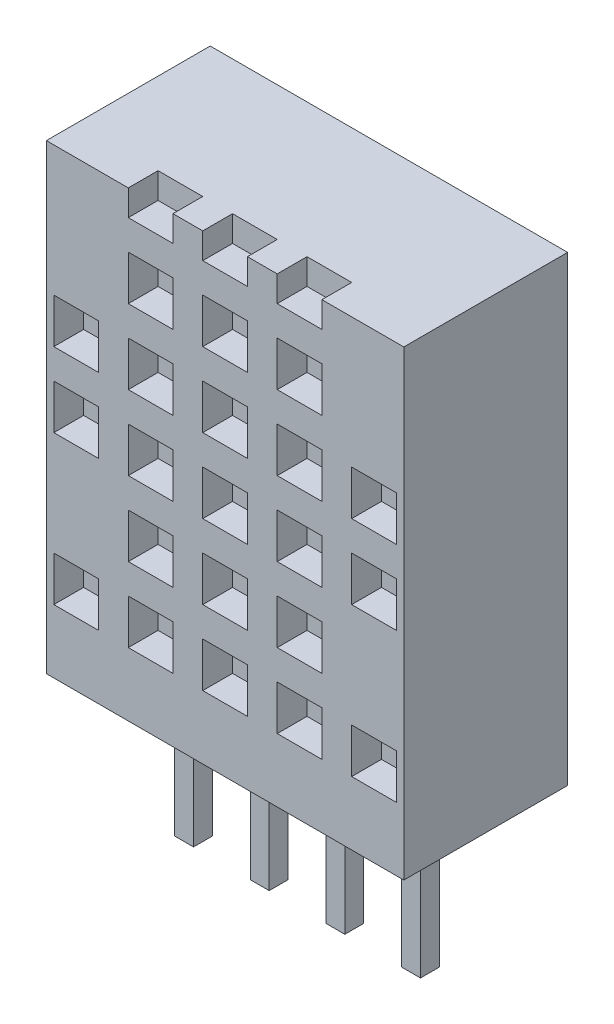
ISO-10303-21;
HEADER;
FILE_DESCRIPTION(('STEP AP214'),'2;1');
FILE_NAME('part.step','',(''),(''),'','','');
FILE_SCHEMA(('AUTOMOTIVE_DESIGN { 1 0 10303 214 1 1 1 1 }'));
ENDSEC;
DATA;
#1=APPLICATION_CONTEXT('core data for automotive mechanical design processes');
#2=APPLICATION_PROTOCOL_DEFINITION('international standard','automotive_design',2000,#1);
#3=PRODUCT_CONTEXT('',#1,'mechanical');
#4=PRODUCT('Part','Part','',(#3));
#5=PRODUCT_RELATED_PRODUCT_CATEGORY('part','',(#4));
#6=PRODUCT_DEFINITION_FORMATION('','',#4);
#7=PRODUCT_DEFINITION_CONTEXT('part definition',#1,'design');
#8=PRODUCT_DEFINITION('design','',#6,#7);
#9=PRODUCT_DEFINITION_SHAPE('','',#8);
#10=(LENGTH_UNIT() NAMED_UNIT(*) SI_UNIT(.MILLI.,.METRE.));
#11=(NAMED_UNIT(*) PLANE_ANGLE_UNIT() SI_UNIT($,.RADIAN.));
#12=(NAMED_UNIT(*) SI_UNIT($,.STERADIAN.) SOLID_ANGLE_UNIT());
#13=UNCERTAINTY_MEASURE_WITH_UNIT(LENGTH_MEASURE(1.E-05),#10,'distance_accuracy_value','');
#14=(GEOMETRIC_REPRESENTATION_CONTEXT(3) GLOBAL_UNCERTAINTY_ASSIGNED_CONTEXT((#13)) GLOBAL_UNIT_ASSIGNED_CONTEXT((#10,
#11,#12)) REPRESENTATION_CONTEXT('',''));
#15=CARTESIAN_POINT('',(0.,0.,0.));
#16=DIRECTION('',(0.,0.,1.));
#17=DIRECTION('',(1.,0.,0.));
#18=AXIS2_PLACEMENT_3D('',#15,#16,#17);
#19=CARTESIAN_POINT('',(0.,0.,5.5));
#20=DIRECTION('',(0.,1.,0.));
#21=DIRECTION('',(0.,0.,1.));
#22=AXIS2_PLACEMENT_3D('',#19,#20,#21);
#23=PLANE('',#22);
#24=DIRECTION('',(-1.,0.,0.));
#25=VECTOR('',#24,1.);
#26=CARTESIAN_POINT('',(6.9525,0.,3.0675));
#27=LINE('',#26,#25);
#28=CARTESIAN_POINT('',(7.5875,0.,3.0675));
#29=VERTEX_POINT('',#28);
#30=CARTESIAN_POINT('',(6.9525,0.,3.0675));
#31=VERTEX_POINT('',#30);
#32=EDGE_CURVE('E1527',#29,#31,#27,.T.);
#33=ORIENTED_EDGE('',*,*,#32,.F.);
#34=DIRECTION('',(0.,0.,1.));
#35=VECTOR('',#34,1.);
#36=CARTESIAN_POINT('',(7.5875,0.,3.0675));
#37=LINE('',#36,#35);
#38=CARTESIAN_POINT('',(7.5875,0.,2.4325));
#39=VERTEX_POINT('',#38);
#40=EDGE_CURVE('E1532',#39,#29,#37,.T.);
#41=ORIENTED_EDGE('',*,*,#40,.F.);
#42=DIRECTION('',(1.,0.,0.));
#43=VECTOR('',#42,1.);
#44=CARTESIAN_POINT('',(6.9525,0.,2.4325));
#45=LINE('',#44,#43);
#46=CARTESIAN_POINT('',(6.9525,0.,2.4325));
#47=VERTEX_POINT('',#46);
#48=EDGE_CURVE('E1544',#47,#39,#45,.T.);
#49=ORIENTED_EDGE('',*,*,#48,.F.);
#50=DIRECTION('',(0.,0.,-1.));
#51=VECTOR('',#50,1.);
#52=CARTESIAN_POINT('',(6.9525,0.,3.0675));
#53=LINE('',#52,#51);
#54=EDGE_CURVE('E1541',#31,#47,#53,.T.);
#55=ORIENTED_EDGE('',*,*,#54,.F.);
#56=EDGE_LOOP('',(#33,#41,#49,#55));
#57=FACE_BOUND('',#56,.T.);
#58=DIRECTION('',(0.,0.,-1.));
#59=VECTOR('',#58,1.);
#60=CARTESIAN_POINT('',(1.8725,0.,3.0675));
#61=LINE('',#60,#59);
#62=CARTESIAN_POINT('',(1.8725,0.,3.0675));
#63=VERTEX_POINT('',#62);
#64=CARTESIAN_POINT('',(1.8725,0.,2.4325));
#65=VERTEX_POINT('',#64);
#66=EDGE_CURVE('E1593',#63,#65,#61,.T.);
#67=ORIENTED_EDGE('',*,*,#66,.F.);
#68=DIRECTION('',(-1.,0.,0.));
#69=VECTOR('',#68,1.);
#70=CARTESIAN_POINT('',(1.8725,0.,3.0675));
#71=LINE('',#70,#69);
#72=CARTESIAN_POINT('',(2.5075,0.,3.0675));
#73=VERTEX_POINT('',#72);
#74=EDGE_CURVE('E1598',#73,#63,#71,.T.);
#75=ORIENTED_EDGE('',*,*,#74,.F.);
#76=DIRECTION('',(0.,0.,1.));
#77=VECTOR('',#76,1.);
#78=CARTESIAN_POINT('',(2.5075,0.,3.0675));
#79=LINE('',#78,#77);
#80=CARTESIAN_POINT('',(2.5075,0.,2.4325));
#81=VERTEX_POINT('',#80);
#82=EDGE_CURVE('E1610',#81,#73,#79,.T.);
#83=ORIENTED_EDGE('',*,*,#82,.F.);
#84=DIRECTION('',(1.,0.,0.));
#85=VECTOR('',#84,1.);
#86=CARTESIAN_POINT('',(1.8725,0.,2.4325));
#87=LINE('',#86,#85);
#88=EDGE_CURVE('E1607',#65,#81,#87,.T.);
#89=ORIENTED_EDGE('',*,*,#88,.F.);
#90=EDGE_LOOP('',(#67,#75,#83,#89));
#91=FACE_BOUND('',#90,.T.);
#92=DIRECTION('',(1.,0.,0.));
#93=VECTOR('',#92,1.);
#94=CARTESIAN_POINT('',(0.,0.,0.));
#95=LINE('',#94,#93);
#96=CARTESIAN_POINT('',(0.,0.,0.));
#97=VERTEX_POINT('',#96);
#98=CARTESIAN_POINT('',(12.,0.,0.));
#99=VERTEX_POINT('',#98);
#100=EDGE_CURVE('E1643',#97,#99,#95,.T.);
#101=ORIENTED_EDGE('',*,*,#100,.T.);
#102=DIRECTION('',(0.,0.,-1.));
#103=VECTOR('',#102,1.);
#104=CARTESIAN_POINT('',(12.,0.,5.5));
#105=LINE('',#104,#103);
#106=CARTESIAN_POINT('',(12.,0.,5.5));
#107=VERTEX_POINT('',#106);
#108=EDGE_CURVE('E1653',#107,#99,#105,.T.);
#109=ORIENTED_EDGE('',*,*,#108,.F.);
#110=DIRECTION('',(1.,0.,0.));
#111=VECTOR('',#110,1.);
#112=CARTESIAN_POINT('',(0.,0.,5.5));
#113=LINE('',#112,#111);
#114=CARTESIAN_POINT('',(0.,0.,5.5));
#115=VERTEX_POINT('',#114);
#116=EDGE_CURVE('E1630',#115,#107,#113,.T.);
#117=ORIENTED_EDGE('',*,*,#116,.F.);
#118=DIRECTION('',(0.,0.,-1.));
#119=VECTOR('',#118,1.);
#120=CARTESIAN_POINT('',(0.,0.,5.5));
#121=LINE('',#120,#119);
#122=EDGE_CURVE('E1656',#115,#97,#121,.T.);
#123=ORIENTED_EDGE('',*,*,#122,.T.);
#124=EDGE_LOOP('',(#101,#109,#117,#123));
#125=FACE_BOUND('',#124,.T.);
#126=DIRECTION('',(-1.,0.,0.));
#127=VECTOR('',#126,1.);
#128=CARTESIAN_POINT('',(4.4125,0.,3.0675));
#129=LINE('',#128,#127);
#130=CARTESIAN_POINT('',(5.0475,0.,3.0675));
#131=VERTEX_POINT('',#130);
#132=CARTESIAN_POINT('',(4.4125,0.,3.0675));
#133=VERTEX_POINT('',#132);
#134=EDGE_CURVE('E1560',#131,#133,#129,.T.);
#135=ORIENTED_EDGE('',*,*,#134,.F.);
#136=DIRECTION('',(0.,0.,1.));
#137=VECTOR('',#136,1.);
#138=CARTESIAN_POINT('',(5.0475,0.,3.0675));
#139=LINE('',#138,#137);
#140=CARTESIAN_POINT('',(5.0475,0.,2.4325));
#141=VERTEX_POINT('',#140);
#142=EDGE_CURVE('E1565',#141,#131,#139,.T.);
#143=ORIENTED_EDGE('',*,*,#142,.F.);
#144=DIRECTION('',(1.,0.,0.));
#145=VECTOR('',#144,1.);
#146=CARTESIAN_POINT('',(4.4125,0.,2.4325));
#147=LINE('',#146,#145);
#148=CARTESIAN_POINT('',(4.4125,0.,2.4325));
#149=VERTEX_POINT('',#148);
#150=EDGE_CURVE('E1577',#149,#141,#147,.T.);
#151=ORIENTED_EDGE('',*,*,#150,.F.);
#152=DIRECTION('',(0.,0.,-1.));
#153=VECTOR('',#152,1.);
#154=CARTESIAN_POINT('',(4.4125,0.,3.0675));
#155=LINE('',#154,#153);
#156=EDGE_CURVE('E1574',#133,#149,#155,.T.);
#157=ORIENTED_EDGE('',*,*,#156,.F.);
#158=EDGE_LOOP('',(#135,#143,#151,#157));
#159=FACE_BOUND('',#158,.T.);
#160=DIRECTION('',(-1.,0.,0.));
#161=VECTOR('',#160,1.);
#162=CARTESIAN_POINT('',(9.4925,0.,3.0675));
#163=LINE('',#162,#161);
#164=CARTESIAN_POINT('',(10.1275,0.,3.0675));
#165=VERTEX_POINT('',#164);
#166=CARTESIAN_POINT('',(9.4925,0.,3.0675));
#167=VERTEX_POINT('',#166);
#168=EDGE_CURVE('E1494',#165,#167,#163,.T.);
#169=ORIENTED_EDGE('',*,*,#168,.F.);
#170=DIRECTION('',(0.,0.,1.));
#171=VECTOR('',#170,1.);
#172=CARTESIAN_POINT('',(10.1275,0.,3.0675));
#173=LINE('',#172,#171);
#174=CARTESIAN_POINT('',(10.1275,0.,2.4325));
#175=VERTEX_POINT('',#174);
#176=EDGE_CURVE('E1499',#175,#165,#173,.T.);
#177=ORIENTED_EDGE('',*,*,#176,.F.);
#178=DIRECTION('',(1.,0.,0.));
#179=VECTOR('',#178,1.);
#180=CARTESIAN_POINT('',(9.4925,0.,2.4325));
#181=LINE('',#180,#179);
#182=CARTESIAN_POINT('',(9.4925,0.,2.4325));
#183=VERTEX_POINT('',#182);
#184=EDGE_CURVE('E1511',#183,#175,#181,.T.);
#185=ORIENTED_EDGE('',*,*,#184,.F.);
#186=DIRECTION('',(0.,0.,-1.));
#187=VECTOR('',#186,1.);
#188=CARTESIAN_POINT('',(9.4925,0.,3.0675));
#189=LINE('',#188,#187);
#190=EDGE_CURVE('E1508',#167,#183,#189,.T.);
#191=ORIENTED_EDGE('',*,*,#190,.F.);
#192=EDGE_LOOP('',(#169,#177,#185,#191));
#193=FACE_BOUND('',#192,.T.);
#194=ADVANCED_FACE('F32',(#57,#91,#125,#159,#193),#23,.F.);
#195=CARTESIAN_POINT('',(0.,0.,5.5));
#196=DIRECTION('',(1.,0.,0.));
#197=DIRECTION('',(0.,0.,-1.));
#198=AXIS2_PLACEMENT_3D('',#195,#196,#197);
#199=PLANE('',#198);
#200=DIRECTION('',(0.,-1.,0.));
#201=VECTOR('',#200,1.);
#202=CARTESIAN_POINT('',(0.,0.,0.));
#203=LINE('',#202,#201);
#204=CARTESIAN_POINT('',(0.,15.5,0.));
#205=VERTEX_POINT('',#204);
#206=EDGE_CURVE('E1626',#205,#97,#203,.T.);
#207=ORIENTED_EDGE('',*,*,#206,.T.);
#208=ORIENTED_EDGE('',*,*,#122,.F.);
#209=DIRECTION('',(0.,-1.,0.));
#210=VECTOR('',#209,1.);
#211=CARTESIAN_POINT('',(0.,0.,5.5));
#212=LINE('',#211,#210);
#213=CARTESIAN_POINT('',(0.,15.5,5.5));
#214=VERTEX_POINT('',#213);
#215=EDGE_CURVE('E1627',#214,#115,#212,.T.);
#216=ORIENTED_EDGE('',*,*,#215,.F.);
#217=DIRECTION('',(0.,0.,-1.));
#218=VECTOR('',#217,1.);
#219=CARTESIAN_POINT('',(0.,15.5,5.5));
#220=LINE('',#219,#218);
#221=EDGE_CURVE('E1639',#214,#205,#220,.T.);
#222=ORIENTED_EDGE('',*,*,#221,.T.);
#223=EDGE_LOOP('',(#207,#208,#216,#222));
#224=FACE_BOUND('',#223,.T.);
#225=ADVANCED_FACE('F34',(#224),#199,.F.);
#226=CARTESIAN_POINT('',(12.,0.,5.5));
#227=DIRECTION('',(-1.,0.,0.));
#228=DIRECTION('',(0.,0.,1.));
#229=AXIS2_PLACEMENT_3D('',#226,#227,#228);
#230=PLANE('',#229);
#231=DIRECTION('',(0.,1.,0.));
#232=VECTOR('',#231,1.);
#233=CARTESIAN_POINT('',(12.,0.,0.));
#234=LINE('',#233,#232);
#235=CARTESIAN_POINT('',(12.,15.5,0.));
#236=VERTEX_POINT('',#235);
#237=EDGE_CURVE('E1645',#99,#236,#234,.T.);
#238=ORIENTED_EDGE('',*,*,#237,.T.);
#239=DIRECTION('',(0.,0.,-1.));
#240=VECTOR('',#239,1.);
#241=CARTESIAN_POINT('',(12.,15.5,5.5));
#242=LINE('',#241,#240);
#243=CARTESIAN_POINT('',(12.,15.5,5.5));
#244=VERTEX_POINT('',#243);
#245=EDGE_CURVE('E1650',#244,#236,#242,.T.);
#246=ORIENTED_EDGE('',*,*,#245,.F.);
#247=DIRECTION('',(0.,1.,0.));
#248=VECTOR('',#247,1.);
#249=CARTESIAN_POINT('',(12.,0.,5.5));
#250=LINE('',#249,#248);
#251=EDGE_CURVE('E1633',#107,#244,#250,.T.);
#252=ORIENTED_EDGE('',*,*,#251,.F.);
#253=ORIENTED_EDGE('',*,*,#108,.T.);
#254=EDGE_LOOP('',(#238,#246,#252,#253));
#255=FACE_BOUND('',#254,.T.);
#256=ADVANCED_FACE('F1706',(#255),#230,.F.);
#257=CARTESIAN_POINT('',(0.,15.5,5.5));
#258=DIRECTION('',(0.,-1.,0.));
#259=DIRECTION('',(0.,0.,-1.));
#260=AXIS2_PLACEMENT_3D('',#257,#258,#259);
#261=PLANE('',#260);
#262=DIRECTION('',(-1.,0.,0.));
#263=VECTOR('',#262,1.);
#264=CARTESIAN_POINT('',(0.,15.5,5.5));
#265=LINE('',#264,#263);
#266=CARTESIAN_POINT('',(7.75,15.5,5.5));
#267=VERTEX_POINT('',#266);
#268=CARTESIAN_POINT('',(6.75,15.5,5.5));
#269=VERTEX_POINT('',#268);
#270=EDGE_CURVE('E1640',#267,#269,#265,.T.);
#271=ORIENTED_EDGE('',*,*,#270,.F.);
#272=DIRECTION('',(0.,0.,-1.));
#273=VECTOR('',#272,1.);
#274=CARTESIAN_POINT('',(7.75,15.5,5.5));
#275=LINE('',#274,#273);
#276=CARTESIAN_POINT('',(7.75,15.5,4.5));
#277=VERTEX_POINT('',#276);
#278=EDGE_CURVE('E1491',#267,#277,#275,.T.);
#279=ORIENTED_EDGE('',*,*,#278,.T.);
#280=DIRECTION('',(-1.,0.,0.));
#281=VECTOR('',#280,1.);
#282=CARTESIAN_POINT('',(0.,15.5,4.5));
#283=LINE('',#282,#281);
#284=CARTESIAN_POINT('',(9.25,15.5,4.5));
#285=VERTEX_POINT('',#284);
#286=EDGE_CURVE('E11',#285,#277,#283,.T.);
#287=ORIENTED_EDGE('',*,*,#286,.F.);
#288=DIRECTION('',(0.,0.,1.));
#289=VECTOR('',#288,1.);
#290=CARTESIAN_POINT('',(9.25,15.5,5.5));
#291=LINE('',#290,#289);
#292=CARTESIAN_POINT('',(9.25,15.5,5.5));
#293=VERTEX_POINT('',#292);
#294=EDGE_CURVE('E1488',#285,#293,#291,.T.);
#295=ORIENTED_EDGE('',*,*,#294,.T.);
#296=EDGE_CURVE('E1636',#244,#293,#265,.T.);
#297=ORIENTED_EDGE('',*,*,#296,.F.);
#298=ORIENTED_EDGE('',*,*,#245,.T.);
#299=DIRECTION('',(-1.,0.,0.));
#300=VECTOR('',#299,1.);
#301=CARTESIAN_POINT('',(0.,15.5,0.));
#302=LINE('',#301,#300);
#303=EDGE_CURVE('E1631',#236,#205,#302,.T.);
#304=ORIENTED_EDGE('',*,*,#303,.T.);
#305=ORIENTED_EDGE('',*,*,#221,.F.);
#306=CARTESIAN_POINT('',(2.75,15.5,5.5));
#307=VERTEX_POINT('',#306);
#308=EDGE_CURVE('E1635',#307,#214,#265,.T.);
#309=ORIENTED_EDGE('',*,*,#308,.F.);
#310=DIRECTION('',(0.,0.,-1.));
#311=VECTOR('',#310,1.);
#312=CARTESIAN_POINT('',(2.75,15.5,5.5));
#313=LINE('',#312,#311);
#314=CARTESIAN_POINT('',(2.75,15.5,4.5));
#315=VERTEX_POINT('',#314);
#316=EDGE_CURVE('E1479',#307,#315,#313,.T.);
#317=ORIENTED_EDGE('',*,*,#316,.T.);
#318=DIRECTION('',(-1.,0.,0.));
#319=VECTOR('',#318,1.);
#320=CARTESIAN_POINT('',(0.,15.5,4.5));
#321=LINE('',#320,#319);
#322=CARTESIAN_POINT('',(4.25,15.5,4.5));
#323=VERTEX_POINT('',#322);
#324=EDGE_CURVE('E1668',#323,#315,#321,.T.);
#325=ORIENTED_EDGE('',*,*,#324,.F.);
#326=DIRECTION('',(0.,0.,1.));
#327=VECTOR('',#326,1.);
#328=CARTESIAN_POINT('',(4.25,15.5,5.5));
#329=LINE('',#328,#327);
#330=CARTESIAN_POINT('',(4.25,15.5,5.5));
#331=VERTEX_POINT('',#330);
#332=EDGE_CURVE('E1470',#323,#331,#329,.T.);
#333=ORIENTED_EDGE('',*,*,#332,.T.);
#334=CARTESIAN_POINT('',(5.25,15.5,5.5));
#335=VERTEX_POINT('',#334);
#336=EDGE_CURVE('E1683',#335,#331,#265,.T.);
#337=ORIENTED_EDGE('',*,*,#336,.F.);
#338=DIRECTION('',(0.,0.,-1.));
#339=VECTOR('',#338,1.);
#340=CARTESIAN_POINT('',(5.25,15.5,5.5));
#341=LINE('',#340,#339);
#342=CARTESIAN_POINT('',(5.25,15.5,4.5));
#343=VERTEX_POINT('',#342);
#344=EDGE_CURVE('E1485',#335,#343,#341,.T.);
#345=ORIENTED_EDGE('',*,*,#344,.T.);
#346=DIRECTION('',(-1.,0.,0.));
#347=VECTOR('',#346,1.);
#348=CARTESIAN_POINT('',(0.,15.5,4.5));
#349=LINE('',#348,#347);
#350=CARTESIAN_POINT('',(6.75,15.5,4.5));
#351=VERTEX_POINT('',#350);
#352=EDGE_CURVE('E40',#351,#343,#349,.T.);
#353=ORIENTED_EDGE('',*,*,#352,.F.);
#354=DIRECTION('',(0.,0.,1.));
#355=VECTOR('',#354,1.);
#356=CARTESIAN_POINT('',(6.75,15.5,5.5));
#357=LINE('',#356,#355);
#358=EDGE_CURVE('E1482',#351,#269,#357,.T.);
#359=ORIENTED_EDGE('',*,*,#358,.T.);
#360=EDGE_LOOP('',(#271,#279,#287,#295,#297,#298,#304,#305,#309,#317,#325,#333,#337,#345,#353,#359));
#361=FACE_BOUND('',#360,.T.);
#362=ADVANCED_FACE('F1681',(#361),#261,.F.);
#363=CARTESIAN_POINT('',(0.,0.,5.5));
#364=DIRECTION('',(0.,0.,-1.));
#365=DIRECTION('',(-1.,0.,0.));
#366=AXIS2_PLACEMENT_3D('',#363,#364,#365);
#367=PLANE('',#366);
#368=DIRECTION('',(0.,1.,0.));
#369=VECTOR('',#368,1.);
#370=CARTESIAN_POINT('',(4.25000000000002,9.63420740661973,5.5));
#371=LINE('',#370,#369);
#372=CARTESIAN_POINT('',(4.25000000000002,9.63420740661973,5.5));
#373=VERTEX_POINT('',#372);
#374=CARTESIAN_POINT('',(4.25000000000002,11.1342074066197,5.5));
#375=VERTEX_POINT('',#374);
#376=EDGE_CURVE('E1111',#373,#375,#371,.T.);
#377=ORIENTED_EDGE('',*,*,#376,.F.);
#378=DIRECTION('',(1.,0.,0.));
#379=VECTOR('',#378,1.);
#380=CARTESIAN_POINT('',(2.75000000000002,9.63420740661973,5.5));
#381=LINE('',#380,#379);
#382=CARTESIAN_POINT('',(2.75000000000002,9.63420740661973,5.5));
#383=VERTEX_POINT('',#382);
#384=EDGE_CURVE('E47',#383,#373,#381,.T.);
#385=ORIENTED_EDGE('',*,*,#384,.F.);
#386=DIRECTION('',(0.,-1.,0.));
#387=VECTOR('',#386,1.);
#388=CARTESIAN_POINT('',(2.75000000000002,9.63420740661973,5.5));
#389=LINE('',#388,#387);
#390=CARTESIAN_POINT('',(2.75000000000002,11.1342074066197,5.5));
#391=VERTEX_POINT('',#390);
#392=EDGE_CURVE('E1100',#391,#383,#389,.T.);
#393=ORIENTED_EDGE('',*,*,#392,.F.);
#394=DIRECTION('',(-1.,0.,0.));
#395=VECTOR('',#394,1.);
#396=CARTESIAN_POINT('',(2.75000000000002,11.1342074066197,5.5));
#397=LINE('',#396,#395);
#398=EDGE_CURVE('E1114',#375,#391,#397,.T.);
#399=ORIENTED_EDGE('',*,*,#398,.F.);
#400=EDGE_LOOP('',(#377,#385,#393,#399));
#401=FACE_BOUND('',#400,.T.);
#402=DIRECTION('',(0.,1.,0.));
#403=VECTOR('',#402,1.);
#404=CARTESIAN_POINT('',(11.75,7.13420740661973,5.5));
#405=LINE('',#404,#403);
#406=CARTESIAN_POINT('',(11.75,7.13420740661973,5.5));
#407=VERTEX_POINT('',#406);
#408=CARTESIAN_POINT('',(11.75,8.63420740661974,5.5));
#409=VERTEX_POINT('',#408);
#410=EDGE_CURVE('E1079',#407,#409,#405,.T.);
#411=ORIENTED_EDGE('',*,*,#410,.F.);
#412=DIRECTION('',(1.,0.,0.));
#413=VECTOR('',#412,1.);
#414=CARTESIAN_POINT('',(10.25,7.13420740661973,5.5));
#415=LINE('',#414,#413);
#416=CARTESIAN_POINT('',(10.25,7.13420740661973,5.5));
#417=VERTEX_POINT('',#416);
#418=EDGE_CURVE('E55',#417,#407,#415,.T.);
#419=ORIENTED_EDGE('',*,*,#418,.F.);
#420=DIRECTION('',(0.,-1.,0.));
#421=VECTOR('',#420,1.);
#422=CARTESIAN_POINT('',(10.25,7.13420740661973,5.5));
#423=LINE('',#422,#421);
#424=CARTESIAN_POINT('',(10.25,8.63420740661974,5.5));
#425=VERTEX_POINT('',#424);
#426=EDGE_CURVE('E1068',#425,#417,#423,.T.);
#427=ORIENTED_EDGE('',*,*,#426,.F.);
#428=DIRECTION('',(-1.,0.,0.));
#429=VECTOR('',#428,1.);
#430=CARTESIAN_POINT('',(10.25,8.63420740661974,5.5));
#431=LINE('',#430,#429);
#432=EDGE_CURVE('E1083',#409,#425,#431,.T.);
#433=ORIENTED_EDGE('',*,*,#432,.F.);
#434=EDGE_LOOP('',(#411,#419,#427,#433));
#435=FACE_BOUND('',#434,.T.);
#436=DIRECTION('',(0.,1.,0.));
#437=VECTOR('',#436,1.);
#438=CARTESIAN_POINT('',(9.25000000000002,7.13420740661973,5.5));
#439=LINE('',#438,#437);
#440=CARTESIAN_POINT('',(9.25000000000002,7.13420740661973,5.5));
#441=VERTEX_POINT('',#440);
#442=CARTESIAN_POINT('',(9.25000000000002,8.63420740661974,5.5));
#443=VERTEX_POINT('',#442);
#444=EDGE_CURVE('E1174',#441,#443,#439,.T.);
#445=ORIENTED_EDGE('',*,*,#444,.F.);
#446=DIRECTION('',(1.,0.,0.));
#447=VECTOR('',#446,1.);
#448=CARTESIAN_POINT('',(7.75000000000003,7.13420740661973,5.5));
#449=LINE('',#448,#447);
#450=CARTESIAN_POINT('',(7.75000000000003,7.13420740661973,5.5));
#451=VERTEX_POINT('',#450);
#452=EDGE_CURVE('E1090',#451,#441,#449,.T.);
#453=ORIENTED_EDGE('',*,*,#452,.F.);
#454=DIRECTION('',(0.,-1.,0.));
#455=VECTOR('',#454,1.);
#456=CARTESIAN_POINT('',(7.75000000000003,7.13420740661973,5.5));
#457=LINE('',#456,#455);
#458=CARTESIAN_POINT('',(7.75000000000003,8.63420740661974,5.5));
#459=VERTEX_POINT('',#458);
#460=EDGE_CURVE('E1163',#459,#451,#457,.T.);
#461=ORIENTED_EDGE('',*,*,#460,.F.);
#462=DIRECTION('',(-1.,0.,0.));
#463=VECTOR('',#462,1.);
#464=CARTESIAN_POINT('',(7.75000000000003,8.63420740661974,5.5));
#465=LINE('',#464,#463);
#466=EDGE_CURVE('E1177',#443,#459,#465,.T.);
#467=ORIENTED_EDGE('',*,*,#466,.F.);
#468=EDGE_LOOP('',(#445,#453,#461,#467));
#469=FACE_BOUND('',#468,.T.);
#470=DIRECTION('',(0.,1.,0.));
#471=VECTOR('',#470,1.);
#472=CARTESIAN_POINT('',(6.75000000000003,7.13420740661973,5.5));
#473=LINE('',#472,#471);
#474=CARTESIAN_POINT('',(6.75000000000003,7.13420740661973,5.5));
#475=VERTEX_POINT('',#474);
#476=CARTESIAN_POINT('',(6.75000000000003,8.63420740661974,5.5));
#477=VERTEX_POINT('',#476);
#478=EDGE_CURVE('E1141',#475,#477,#473,.T.);
#479=ORIENTED_EDGE('',*,*,#478,.F.);
#480=DIRECTION('',(1.,0.,0.));
#481=VECTOR('',#480,1.);
#482=CARTESIAN_POINT('',(5.25000000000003,7.13420740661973,5.5));
#483=LINE('',#482,#481);
#484=CARTESIAN_POINT('',(5.25000000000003,7.13420740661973,5.5));
#485=VERTEX_POINT('',#484);
#486=EDGE_CURVE('E1139',#485,#475,#483,.T.);
#487=ORIENTED_EDGE('',*,*,#486,.F.);
#488=DIRECTION('',(0.,-1.,0.));
#489=VECTOR('',#488,1.);
#490=CARTESIAN_POINT('',(5.25000000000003,7.13420740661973,5.5));
#491=LINE('',#490,#489);
#492=CARTESIAN_POINT('',(5.25000000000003,8.63420740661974,5.5));
#493=VERTEX_POINT('',#492);
#494=EDGE_CURVE('E1129',#493,#485,#491,.T.);
#495=ORIENTED_EDGE('',*,*,#494,.F.);
#496=DIRECTION('',(-1.,0.,0.));
#497=VECTOR('',#496,1.);
#498=CARTESIAN_POINT('',(5.25000000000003,8.63420740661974,5.5));
#499=LINE('',#498,#497);
#500=EDGE_CURVE('E1145',#477,#493,#499,.T.);
#501=ORIENTED_EDGE('',*,*,#500,.F.);
#502=EDGE_LOOP('',(#479,#487,#495,#501));
#503=FACE_BOUND('',#502,.T.);
#504=DIRECTION('',(0.,1.,0.));
#505=VECTOR('',#504,1.);
#506=CARTESIAN_POINT('',(4.25000000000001,12.1342074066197,5.5));
#507=LINE('',#506,#505);
#508=CARTESIAN_POINT('',(4.25000000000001,12.1342074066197,5.5));
#509=VERTEX_POINT('',#508);
#510=CARTESIAN_POINT('',(4.25000000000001,13.6342074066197,5.5));
#511=VERTEX_POINT('',#510);
#512=EDGE_CURVE('E986',#509,#511,#507,.T.);
#513=ORIENTED_EDGE('',*,*,#512,.F.);
#514=DIRECTION('',(1.,0.,0.));
#515=VECTOR('',#514,1.);
#516=CARTESIAN_POINT('',(2.75000000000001,12.1342074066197,5.5));
#517=LINE('',#516,#515);
#518=CARTESIAN_POINT('',(2.75000000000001,12.1342074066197,5.5));
#519=VERTEX_POINT('',#518);
#520=EDGE_CURVE('E864',#519,#509,#517,.T.);
#521=ORIENTED_EDGE('',*,*,#520,.F.);
#522=DIRECTION('',(0.,-1.,0.));
#523=VECTOR('',#522,1.);
#524=CARTESIAN_POINT('',(2.75000000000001,12.1342074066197,5.5));
#525=LINE('',#524,#523);
#526=CARTESIAN_POINT('',(2.75000000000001,13.6342074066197,5.5));
#527=VERTEX_POINT('',#526);
#528=EDGE_CURVE('E975',#527,#519,#525,.T.);
#529=ORIENTED_EDGE('',*,*,#528,.F.);
#530=DIRECTION('',(-1.,0.,0.));
#531=VECTOR('',#530,1.);
#532=CARTESIAN_POINT('',(2.75000000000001,13.6342074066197,5.5));
#533=LINE('',#532,#531);
#534=EDGE_CURVE('E989',#511,#527,#533,.T.);
#535=ORIENTED_EDGE('',*,*,#534,.F.);
#536=EDGE_LOOP('',(#513,#521,#529,#535));
#537=FACE_BOUND('',#536,.T.);
#538=DIRECTION('',(0.,1.,0.));
#539=VECTOR('',#538,1.);
#540=CARTESIAN_POINT('',(11.75,9.63420740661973,5.5));
#541=LINE('',#540,#539);
#542=CARTESIAN_POINT('',(11.75,9.63420740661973,5.5));
#543=VERTEX_POINT('',#542);
#544=CARTESIAN_POINT('',(11.75,11.1342074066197,5.5));
#545=VERTEX_POINT('',#544);
#546=EDGE_CURVE('E953',#543,#545,#541,.T.);
#547=ORIENTED_EDGE('',*,*,#546,.F.);
#548=DIRECTION('',(1.,0.,0.));
#549=VECTOR('',#548,1.);
#550=CARTESIAN_POINT('',(10.25,9.63420740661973,5.5));
#551=LINE('',#550,#549);
#552=CARTESIAN_POINT('',(10.25,9.63420740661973,5.5));
#553=VERTEX_POINT('',#552);
#554=EDGE_CURVE('E951',#553,#543,#551,.T.);
#555=ORIENTED_EDGE('',*,*,#554,.F.);
#556=DIRECTION('',(0.,-1.,0.));
#557=VECTOR('',#556,1.);
#558=CARTESIAN_POINT('',(10.25,9.63420740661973,5.5));
#559=LINE('',#558,#557);
#560=CARTESIAN_POINT('',(10.25,11.1342074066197,5.5));
#561=VERTEX_POINT('',#560);
#562=EDGE_CURVE('E941',#561,#553,#559,.T.);
#563=ORIENTED_EDGE('',*,*,#562,.F.);
#564=DIRECTION('',(-1.,0.,0.));
#565=VECTOR('',#564,1.);
#566=CARTESIAN_POINT('',(10.25,11.1342074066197,5.5));
#567=LINE('',#566,#565);
#568=EDGE_CURVE('E957',#545,#561,#567,.T.);
#569=ORIENTED_EDGE('',*,*,#568,.F.);
#570=EDGE_LOOP('',(#547,#555,#563,#569));
#571=FACE_BOUND('',#570,.T.);
#572=DIRECTION('',(0.,1.,0.));
#573=VECTOR('',#572,1.);
#574=CARTESIAN_POINT('',(9.25000000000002,9.63420740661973,5.5));
#575=LINE('',#574,#573);
#576=CARTESIAN_POINT('',(9.25000000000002,9.63420740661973,5.5));
#577=VERTEX_POINT('',#576);
#578=CARTESIAN_POINT('',(9.25000000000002,11.1342074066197,5.5));
#579=VERTEX_POINT('',#578);
#580=EDGE_CURVE('E1049',#577,#579,#575,.T.);
#581=ORIENTED_EDGE('',*,*,#580,.F.);
#582=DIRECTION('',(1.,0.,0.));
#583=VECTOR('',#582,1.);
#584=CARTESIAN_POINT('',(7.75000000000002,9.63420740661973,5.5));
#585=LINE('',#584,#583);
#586=CARTESIAN_POINT('',(7.75000000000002,9.63420740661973,5.5));
#587=VERTEX_POINT('',#586);
#588=EDGE_CURVE('E964',#587,#577,#585,.T.);
#589=ORIENTED_EDGE('',*,*,#588,.F.);
#590=DIRECTION('',(0.,-1.,0.));
#591=VECTOR('',#590,1.);
#592=CARTESIAN_POINT('',(7.75000000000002,9.63420740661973,5.5));
#593=LINE('',#592,#591);
#594=CARTESIAN_POINT('',(7.75000000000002,11.1342074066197,5.5));
#595=VERTEX_POINT('',#594);
#596=EDGE_CURVE('E1038',#595,#587,#593,.T.);
#597=ORIENTED_EDGE('',*,*,#596,.F.);
#598=DIRECTION('',(-1.,0.,0.));
#599=VECTOR('',#598,1.);
#600=CARTESIAN_POINT('',(7.75000000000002,11.1342074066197,5.5));
#601=LINE('',#600,#599);
#602=EDGE_CURVE('E1052',#579,#595,#601,.T.);
#603=ORIENTED_EDGE('',*,*,#602,.F.);
#604=EDGE_LOOP('',(#581,#589,#597,#603));
#605=FACE_BOUND('',#604,.T.);
#606=DIRECTION('',(0.,1.,0.));
#607=VECTOR('',#606,1.);
#608=CARTESIAN_POINT('',(6.75000000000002,9.63420740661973,5.5));
#609=LINE('',#608,#607);
#610=CARTESIAN_POINT('',(6.75000000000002,9.63420740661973,5.5));
#611=VERTEX_POINT('',#610);
#612=CARTESIAN_POINT('',(6.75000000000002,11.1342074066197,5.5));
#613=VERTEX_POINT('',#612);
#614=EDGE_CURVE('E1017',#611,#613,#609,.T.);
#615=ORIENTED_EDGE('',*,*,#614,.F.);
#616=DIRECTION('',(1.,0.,0.));
#617=VECTOR('',#616,1.);
#618=CARTESIAN_POINT('',(5.25000000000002,9.63420740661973,5.5));
#619=LINE('',#618,#617);
#620=CARTESIAN_POINT('',(5.25000000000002,9.63420740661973,5.5));
#621=VERTEX_POINT('',#620);
#622=EDGE_CURVE('E1015',#621,#611,#619,.T.);
#623=ORIENTED_EDGE('',*,*,#622,.F.);
#624=DIRECTION('',(0.,-1.,0.));
#625=VECTOR('',#624,1.);
#626=CARTESIAN_POINT('',(5.25000000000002,9.63420740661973,5.5));
#627=LINE('',#626,#625);
#628=CARTESIAN_POINT('',(5.25000000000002,11.1342074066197,5.5));
#629=VERTEX_POINT('',#628);
#630=EDGE_CURVE('E1005',#629,#621,#627,.T.);
#631=ORIENTED_EDGE('',*,*,#630,.F.);
#632=DIRECTION('',(-1.,0.,0.));
#633=VECTOR('',#632,1.);
#634=CARTESIAN_POINT('',(5.25000000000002,11.1342074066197,5.5));
#635=LINE('',#634,#633);
#636=EDGE_CURVE('E1021',#613,#629,#635,.T.);
#637=ORIENTED_EDGE('',*,*,#636,.F.);
#638=EDGE_LOOP('',(#615,#623,#631,#637));
#639=FACE_BOUND('',#638,.T.);
#640=DIRECTION('',(0.,1.,0.));
#641=VECTOR('',#640,1.);
#642=CARTESIAN_POINT('',(4.25000000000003,4.63420740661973,5.5));
#643=LINE('',#642,#641);
#644=CARTESIAN_POINT('',(4.25000000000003,4.63420740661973,5.5));
#645=VERTEX_POINT('',#644);
#646=CARTESIAN_POINT('',(4.25000000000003,6.13420740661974,5.5));
#647=VERTEX_POINT('',#646);
#648=EDGE_CURVE('E1399',#645,#647,#643,.T.);
#649=ORIENTED_EDGE('',*,*,#648,.F.);
#650=DIRECTION('',(1.,0.,0.));
#651=VECTOR('',#650,1.);
#652=CARTESIAN_POINT('',(2.75000000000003,4.63420740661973,5.5));
#653=LINE('',#652,#651);
#654=CARTESIAN_POINT('',(2.75000000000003,4.63420740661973,5.5));
#655=VERTEX_POINT('',#654);
#656=EDGE_CURVE('E1397',#655,#645,#653,.T.);
#657=ORIENTED_EDGE('',*,*,#656,.F.);
#658=DIRECTION('',(0.,-1.,0.));
#659=VECTOR('',#658,1.);
#660=CARTESIAN_POINT('',(2.75000000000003,4.63420740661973,5.5));
#661=LINE('',#660,#659);
#662=CARTESIAN_POINT('',(2.75000000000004,6.13420740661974,5.5));
#663=VERTEX_POINT('',#662);
#664=EDGE_CURVE('E1387',#663,#655,#661,.T.);
#665=ORIENTED_EDGE('',*,*,#664,.F.);
#666=DIRECTION('',(-1.,0.,0.));
#667=VECTOR('',#666,1.);
#668=CARTESIAN_POINT('',(2.75000000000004,6.13420740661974,5.5));
#669=LINE('',#668,#667);
#670=EDGE_CURVE('E1403',#647,#663,#669,.T.);
#671=ORIENTED_EDGE('',*,*,#670,.F.);
#672=EDGE_LOOP('',(#649,#657,#665,#671));
#673=FACE_BOUND('',#672,.T.);
#674=DIRECTION('',(0.,1.,0.));
#675=VECTOR('',#674,1.);
#676=CARTESIAN_POINT('',(6.75000000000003,4.63420740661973,5.5));
#677=LINE('',#676,#675);
#678=CARTESIAN_POINT('',(6.75000000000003,4.63420740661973,5.5));
#679=VERTEX_POINT('',#678);
#680=CARTESIAN_POINT('',(6.75000000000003,6.13420740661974,5.5));
#681=VERTEX_POINT('',#680);
#682=EDGE_CURVE('E1430',#679,#681,#677,.T.);
#683=ORIENTED_EDGE('',*,*,#682,.F.);
#684=DIRECTION('',(1.,0.,0.));
#685=VECTOR('',#684,1.);
#686=CARTESIAN_POINT('',(5.25000000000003,4.63420740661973,5.5));
#687=LINE('',#686,#685);
#688=CARTESIAN_POINT('',(5.25000000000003,4.63420740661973,5.5));
#689=VERTEX_POINT('',#688);
#690=EDGE_CURVE('E1346',#689,#679,#687,.T.);
#691=ORIENTED_EDGE('',*,*,#690,.F.);
#692=DIRECTION('',(0.,-1.,0.));
#693=VECTOR('',#692,1.);
#694=CARTESIAN_POINT('',(5.25000000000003,4.63420740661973,5.5));
#695=LINE('',#694,#693);
#696=CARTESIAN_POINT('',(5.25000000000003,6.13420740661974,5.5));
#697=VERTEX_POINT('',#696);
#698=EDGE_CURVE('E1419',#697,#689,#695,.T.);
#699=ORIENTED_EDGE('',*,*,#698,.F.);
#700=DIRECTION('',(-1.,0.,0.));
#701=VECTOR('',#700,1.);
#702=CARTESIAN_POINT('',(5.25000000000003,6.13420740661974,5.5));
#703=LINE('',#702,#701);
#704=EDGE_CURVE('E1433',#681,#697,#703,.T.);
#705=ORIENTED_EDGE('',*,*,#704,.F.);
#706=EDGE_LOOP('',(#683,#691,#699,#705));
#707=FACE_BOUND('',#706,.T.);
#708=DIRECTION('',(0.,1.,0.));
#709=VECTOR('',#708,1.);
#710=CARTESIAN_POINT('',(9.25000000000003,4.63420740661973,5.5));
#711=LINE('',#710,#709);
#712=CARTESIAN_POINT('',(9.25000000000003,4.63420740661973,5.5));
#713=VERTEX_POINT('',#712);
#714=CARTESIAN_POINT('',(9.25000000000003,6.13420740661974,5.5));
#715=VERTEX_POINT('',#714);
#716=EDGE_CURVE('E1335',#713,#715,#711,.T.);
#717=ORIENTED_EDGE('',*,*,#716,.F.);
#718=DIRECTION('',(1.,0.,0.));
#719=VECTOR('',#718,1.);
#720=CARTESIAN_POINT('',(7.75000000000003,4.63420740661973,5.5));
#721=LINE('',#720,#719);
#722=CARTESIAN_POINT('',(7.75000000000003,4.63420740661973,5.5));
#723=VERTEX_POINT('',#722);
#724=EDGE_CURVE('E1333',#723,#713,#721,.T.);
#725=ORIENTED_EDGE('',*,*,#724,.F.);
#726=DIRECTION('',(0.,-1.,0.));
#727=VECTOR('',#726,1.);
#728=CARTESIAN_POINT('',(7.75000000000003,4.63420740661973,5.5));
#729=LINE('',#728,#727);
#730=CARTESIAN_POINT('',(7.75000000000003,6.13420740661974,5.5));
#731=VERTEX_POINT('',#730);
#732=EDGE_CURVE('E1323',#731,#723,#729,.T.);
#733=ORIENTED_EDGE('',*,*,#732,.F.);
#734=DIRECTION('',(-1.,0.,0.));
#735=VECTOR('',#734,1.);
#736=CARTESIAN_POINT('',(7.75000000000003,6.13420740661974,5.5));
#737=LINE('',#736,#735);
#738=EDGE_CURVE('E1339',#715,#731,#737,.T.);
#739=ORIENTED_EDGE('',*,*,#738,.F.);
#740=EDGE_LOOP('',(#717,#725,#733,#739));
#741=FACE_BOUND('',#740,.T.);
#742=DIRECTION('',(0.,1.,0.));
#743=VECTOR('',#742,1.);
#744=CARTESIAN_POINT('',(4.25000000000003,7.13420740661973,5.5));
#745=LINE('',#744,#743);
#746=CARTESIAN_POINT('',(4.25000000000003,7.13420740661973,5.5));
#747=VERTEX_POINT('',#746);
#748=CARTESIAN_POINT('',(4.25000000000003,8.63420740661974,5.5));
#749=VERTEX_POINT('',#748);
#750=EDGE_CURVE('E1368',#747,#749,#745,.T.);
#751=ORIENTED_EDGE('',*,*,#750,.F.);
#752=DIRECTION('',(1.,0.,0.));
#753=VECTOR('',#752,1.);
#754=CARTESIAN_POINT('',(2.75000000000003,7.13420740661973,5.5));
#755=LINE('',#754,#753);
#756=CARTESIAN_POINT('',(2.75000000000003,7.13420740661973,5.5));
#757=VERTEX_POINT('',#756);
#758=EDGE_CURVE('E1152',#757,#747,#755,.T.);
#759=ORIENTED_EDGE('',*,*,#758,.F.);
#760=DIRECTION('',(0.,-1.,0.));
#761=VECTOR('',#760,1.);
#762=CARTESIAN_POINT('',(2.75000000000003,7.13420740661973,5.5));
#763=LINE('',#762,#761);
#764=CARTESIAN_POINT('',(2.75000000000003,8.63420740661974,5.5));
#765=VERTEX_POINT('',#764);
#766=EDGE_CURVE('E1357',#765,#757,#763,.T.);
#767=ORIENTED_EDGE('',*,*,#766,.F.);
#768=DIRECTION('',(-1.,0.,0.));
#769=VECTOR('',#768,1.);
#770=CARTESIAN_POINT('',(2.75000000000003,8.63420740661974,5.5));
#771=LINE('',#770,#769);
#772=EDGE_CURVE('E1371',#749,#765,#771,.T.);
#773=ORIENTED_EDGE('',*,*,#772,.F.);
#774=EDGE_LOOP('',(#751,#759,#767,#773));
#775=FACE_BOUND('',#774,.T.);
#776=DIRECTION('',(0.,1.,0.));
#777=VECTOR('',#776,1.);
#778=CARTESIAN_POINT('',(11.75,2.13420740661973,5.5));
#779=LINE('',#778,#777);
#780=CARTESIAN_POINT('',(11.75,2.13420740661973,5.5));
#781=VERTEX_POINT('',#780);
#782=CARTESIAN_POINT('',(11.75,3.63420740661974,5.5));
#783=VERTEX_POINT('',#782);
#784=EDGE_CURVE('E1303',#781,#783,#779,.T.);
#785=ORIENTED_EDGE('',*,*,#784,.F.);
#786=DIRECTION('',(1.,0.,0.));
#787=VECTOR('',#786,1.);
#788=CARTESIAN_POINT('',(10.25,2.13420740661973,5.5));
#789=LINE('',#788,#787);
#790=CARTESIAN_POINT('',(10.25,2.13420740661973,5.5));
#791=VERTEX_POINT('',#790);
#792=EDGE_CURVE('E1301',#791,#781,#789,.T.);
#793=ORIENTED_EDGE('',*,*,#792,.F.);
#794=DIRECTION('',(0.,-1.,0.));
#795=VECTOR('',#794,1.);
#796=CARTESIAN_POINT('',(10.25,2.13420740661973,5.5));
#797=LINE('',#796,#795);
#798=CARTESIAN_POINT('',(10.25,3.63420740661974,5.5));
#799=VERTEX_POINT('',#798);
#800=EDGE_CURVE('E1291',#799,#791,#797,.T.);
#801=ORIENTED_EDGE('',*,*,#800,.F.);
#802=DIRECTION('',(-1.,0.,0.));
#803=VECTOR('',#802,1.);
#804=CARTESIAN_POINT('',(10.25,3.63420740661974,5.5));
#805=LINE('',#804,#803);
#806=EDGE_CURVE('E1307',#783,#799,#805,.T.);
#807=ORIENTED_EDGE('',*,*,#806,.F.);
#808=EDGE_LOOP('',(#785,#793,#801,#807));
#809=FACE_BOUND('',#808,.T.);
#810=DIRECTION('',(0.,1.,0.));
#811=VECTOR('',#810,1.);
#812=CARTESIAN_POINT('',(9.25000000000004,2.13420740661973,5.5));
#813=LINE('',#812,#811);
#814=CARTESIAN_POINT('',(9.25000000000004,2.13420740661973,5.5));
#815=VERTEX_POINT('',#814);
#816=CARTESIAN_POINT('',(9.25000000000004,3.63420740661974,5.5));
#817=VERTEX_POINT('',#816);
#818=EDGE_CURVE('E1271',#815,#817,#813,.T.);
#819=ORIENTED_EDGE('',*,*,#818,.F.);
#820=DIRECTION('',(1.,0.,0.));
#821=VECTOR('',#820,1.);
#822=CARTESIAN_POINT('',(7.75000000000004,2.13420740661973,5.5));
#823=LINE('',#822,#821);
#824=CARTESIAN_POINT('',(7.75000000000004,2.13420740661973,5.5));
#825=VERTEX_POINT('',#824);
#826=EDGE_CURVE('E1269',#825,#815,#823,.T.);
#827=ORIENTED_EDGE('',*,*,#826,.F.);
#828=DIRECTION('',(0.,-1.,0.));
#829=VECTOR('',#828,1.);
#830=CARTESIAN_POINT('',(7.75000000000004,2.13420740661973,5.5));
#831=LINE('',#830,#829);
#832=CARTESIAN_POINT('',(7.75000000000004,3.63420740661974,5.5));
#833=VERTEX_POINT('',#832);
#834=EDGE_CURVE('E1259',#833,#825,#831,.T.);
#835=ORIENTED_EDGE('',*,*,#834,.F.);
#836=DIRECTION('',(-1.,0.,0.));
#837=VECTOR('',#836,1.);
#838=CARTESIAN_POINT('',(7.75000000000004,3.63420740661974,5.5));
#839=LINE('',#838,#837);
#840=EDGE_CURVE('E1275',#817,#833,#839,.T.);
#841=ORIENTED_EDGE('',*,*,#840,.F.);
#842=EDGE_LOOP('',(#819,#827,#835,#841));
#843=FACE_BOUND('',#842,.T.);
#844=DIRECTION('',(0.,1.,0.));
#845=VECTOR('',#844,1.);
#846=CARTESIAN_POINT('',(6.75000000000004,2.13420740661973,5.5));
#847=LINE('',#846,#845);
#848=CARTESIAN_POINT('',(6.75000000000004,2.13420740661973,5.5));
#849=VERTEX_POINT('',#848);
#850=CARTESIAN_POINT('',(6.75000000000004,3.63420740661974,5.5));
#851=VERTEX_POINT('',#850);
#852=EDGE_CURVE('E1239',#849,#851,#847,.T.);
#853=ORIENTED_EDGE('',*,*,#852,.F.);
#854=DIRECTION('',(1.,0.,0.));
#855=VECTOR('',#854,1.);
#856=CARTESIAN_POINT('',(5.25000000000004,2.13420740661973,5.5));
#857=LINE('',#856,#855);
#858=CARTESIAN_POINT('',(5.25000000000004,2.13420740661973,5.5));
#859=VERTEX_POINT('',#858);
#860=EDGE_CURVE('E1237',#859,#849,#857,.T.);
#861=ORIENTED_EDGE('',*,*,#860,.F.);
#862=DIRECTION('',(0.,-1.,0.));
#863=VECTOR('',#862,1.);
#864=CARTESIAN_POINT('',(5.25000000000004,2.13420740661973,5.5));
#865=LINE('',#864,#863);
#866=CARTESIAN_POINT('',(5.25000000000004,3.63420740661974,5.5));
#867=VERTEX_POINT('',#866);
#868=EDGE_CURVE('E1227',#867,#859,#865,.T.);
#869=ORIENTED_EDGE('',*,*,#868,.F.);
#870=DIRECTION('',(-1.,0.,0.));
#871=VECTOR('',#870,1.);
#872=CARTESIAN_POINT('',(5.25000000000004,3.63420740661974,5.5));
#873=LINE('',#872,#871);
#874=EDGE_CURVE('E1243',#851,#867,#873,.T.);
#875=ORIENTED_EDGE('',*,*,#874,.F.);
#876=EDGE_LOOP('',(#853,#861,#869,#875));
#877=FACE_BOUND('',#876,.T.);
#878=DIRECTION('',(0.,1.,0.));
#879=VECTOR('',#878,1.);
#880=CARTESIAN_POINT('',(4.25000000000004,2.13420740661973,5.5));
#881=LINE('',#880,#879);
#882=CARTESIAN_POINT('',(4.25000000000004,2.13420740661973,5.5));
#883=VERTEX_POINT('',#882);
#884=CARTESIAN_POINT('',(4.25000000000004,3.63420740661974,5.5));
#885=VERTEX_POINT('',#884);
#886=EDGE_CURVE('E1205',#883,#885,#881,.T.);
#887=ORIENTED_EDGE('',*,*,#886,.F.);
#888=DIRECTION('',(1.,0.,0.));
#889=VECTOR('',#888,1.);
#890=CARTESIAN_POINT('',(2.75000000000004,2.13420740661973,5.5));
#891=LINE('',#890,#889);
#892=CARTESIAN_POINT('',(2.75000000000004,2.13420740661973,5.5));
#893=VERTEX_POINT('',#892);
#894=EDGE_CURVE('E1203',#893,#883,#891,.T.);
#895=ORIENTED_EDGE('',*,*,#894,.F.);
#896=DIRECTION('',(0.,-1.,0.));
#897=VECTOR('',#896,1.);
#898=CARTESIAN_POINT('',(2.75000000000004,2.13420740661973,5.5));
#899=LINE('',#898,#897);
#900=CARTESIAN_POINT('',(2.75000000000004,3.63420740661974,5.5));
#901=VERTEX_POINT('',#900);
#902=EDGE_CURVE('E1193',#901,#893,#899,.T.);
#903=ORIENTED_EDGE('',*,*,#902,.F.);
#904=DIRECTION('',(-1.,0.,0.));
#905=VECTOR('',#904,1.);
#906=CARTESIAN_POINT('',(2.75000000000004,3.63420740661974,5.5));
#907=LINE('',#906,#905);
#908=EDGE_CURVE('E1209',#885,#901,#907,.T.);
#909=ORIENTED_EDGE('',*,*,#908,.F.);
#910=EDGE_LOOP('',(#887,#895,#903,#909));
#911=FACE_BOUND('',#910,.T.);
#912=DIRECTION('',(0.,1.,0.));
#913=VECTOR('',#912,1.);
#914=CARTESIAN_POINT('',(1.75000000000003,7.13420740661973,5.5));
#915=LINE('',#914,#913);
#916=CARTESIAN_POINT('',(1.75000000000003,7.13420740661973,5.5));
#917=VERTEX_POINT('',#916);
#918=CARTESIAN_POINT('',(1.75000000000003,8.63420740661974,5.5));
#919=VERTEX_POINT('',#918);
#920=EDGE_CURVE('E822',#917,#919,#915,.T.);
#921=ORIENTED_EDGE('',*,*,#920,.F.);
#922=DIRECTION('',(1.,0.,0.));
#923=VECTOR('',#922,1.);
#924=CARTESIAN_POINT('',(0.250000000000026,7.13420740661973,5.5));
#925=LINE('',#924,#923);
#926=CARTESIAN_POINT('',(0.250000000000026,7.13420740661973,5.5));
#927=VERTEX_POINT('',#926);
#928=EDGE_CURVE('E783',#927,#917,#925,.T.);
#929=ORIENTED_EDGE('',*,*,#928,.F.);
#930=DIRECTION('',(0.,-1.,0.));
#931=VECTOR('',#930,1.);
#932=CARTESIAN_POINT('',(0.250000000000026,7.13420740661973,5.5));
#933=LINE('',#932,#931);
#934=CARTESIAN_POINT('',(0.250000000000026,8.63420740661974,5.5));
#935=VERTEX_POINT('',#934);
#936=EDGE_CURVE('E811',#935,#927,#933,.T.);
#937=ORIENTED_EDGE('',*,*,#936,.F.);
#938=DIRECTION('',(-1.,0.,0.));
#939=VECTOR('',#938,1.);
#940=CARTESIAN_POINT('',(0.250000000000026,8.63420740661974,5.5));
#941=LINE('',#940,#939);
#942=EDGE_CURVE('E825',#919,#935,#941,.T.);
#943=ORIENTED_EDGE('',*,*,#942,.F.);
#944=EDGE_LOOP('',(#921,#929,#937,#943));
#945=FACE_BOUND('',#944,.T.);
#946=DIRECTION('',(0.,1.,0.));
#947=VECTOR('',#946,1.);
#948=CARTESIAN_POINT('',(1.75000000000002,9.63420740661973,5.5));
#949=LINE('',#948,#947);
#950=CARTESIAN_POINT('',(1.75000000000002,9.63420740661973,5.5));
#951=VERTEX_POINT('',#950);
#952=CARTESIAN_POINT('',(1.75000000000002,11.1342074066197,5.5));
#953=VERTEX_POINT('',#952);
#954=EDGE_CURVE('E777',#951,#953,#949,.T.);
#955=ORIENTED_EDGE('',*,*,#954,.F.);
#956=DIRECTION('',(1.,0.,0.));
#957=VECTOR('',#956,1.);
#958=CARTESIAN_POINT('',(0.250000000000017,9.63420740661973,5.5));
#959=LINE('',#958,#957);
#960=CARTESIAN_POINT('',(0.250000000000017,9.63420740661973,5.5));
#961=VERTEX_POINT('',#960);
#962=EDGE_CURVE('E751',#961,#951,#959,.T.);
#963=ORIENTED_EDGE('',*,*,#962,.F.);
#964=DIRECTION('',(0.,-1.,0.));
#965=VECTOR('',#964,1.);
#966=CARTESIAN_POINT('',(0.250000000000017,9.63420740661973,5.5));
#967=LINE('',#966,#965);
#968=CARTESIAN_POINT('',(0.250000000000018,11.1342074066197,5.5));
#969=VERTEX_POINT('',#968);
#970=EDGE_CURVE('E768',#969,#961,#967,.T.);
#971=ORIENTED_EDGE('',*,*,#970,.F.);
#972=DIRECTION('',(-1.,0.,0.));
#973=VECTOR('',#972,1.);
#974=CARTESIAN_POINT('',(0.250000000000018,11.1342074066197,5.5));
#975=LINE('',#974,#973);
#976=EDGE_CURVE('E771',#953,#969,#975,.T.);
#977=ORIENTED_EDGE('',*,*,#976,.F.);
#978=EDGE_LOOP('',(#955,#963,#971,#977));
#979=FACE_BOUND('',#978,.T.);
#980=DIRECTION('',(0.,1.,0.));
#981=VECTOR('',#980,1.);
#982=CARTESIAN_POINT('',(9.25000000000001,12.1342074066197,5.5));
#983=LINE('',#982,#981);
#984=CARTESIAN_POINT('',(9.25000000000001,12.1342074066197,5.5));
#985=VERTEX_POINT('',#984);
#986=CARTESIAN_POINT('',(9.25000000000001,13.6342074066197,5.5));
#987=VERTEX_POINT('',#986);
#988=EDGE_CURVE('E887',#985,#987,#983,.T.);
#989=ORIENTED_EDGE('',*,*,#988,.F.);
#990=DIRECTION('',(1.,0.,0.));
#991=VECTOR('',#990,1.);
#992=CARTESIAN_POINT('',(7.75000000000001,12.1342074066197,5.5));
#993=LINE('',#992,#991);
#994=CARTESIAN_POINT('',(7.75000000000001,12.1342074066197,5.5));
#995=VERTEX_POINT('',#994);
#996=EDGE_CURVE('E885',#995,#985,#993,.T.);
#997=ORIENTED_EDGE('',*,*,#996,.F.);
#998=DIRECTION('',(0.,-1.,0.));
#999=VECTOR('',#998,1.);
#1000=CARTESIAN_POINT('',(7.75000000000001,12.1342074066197,5.5));
#1001=LINE('',#1000,#999);
#1002=CARTESIAN_POINT('',(7.75000000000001,13.6342074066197,5.5));
#1003=VERTEX_POINT('',#1002);
#1004=EDGE_CURVE('E875',#1003,#995,#1001,.T.);
#1005=ORIENTED_EDGE('',*,*,#1004,.F.);
#1006=DIRECTION('',(-1.,0.,0.));
#1007=VECTOR('',#1006,1.);
#1008=CARTESIAN_POINT('',(7.75000000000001,13.6342074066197,5.5));
#1009=LINE('',#1008,#1007);
#1010=EDGE_CURVE('E891',#987,#1003,#1009,.T.);
#1011=ORIENTED_EDGE('',*,*,#1010,.F.);
#1012=EDGE_LOOP('',(#989,#997,#1005,#1011));
#1013=FACE_BOUND('',#1012,.T.);
#1014=DIRECTION('',(0.,1.,0.));
#1015=VECTOR('',#1014,1.);
#1016=CARTESIAN_POINT('',(6.75000000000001,12.1342074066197,5.5));
#1017=LINE('',#1016,#1015);
#1018=CARTESIAN_POINT('',(6.75000000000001,12.1342074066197,5.5));
#1019=VERTEX_POINT('',#1018);
#1020=CARTESIAN_POINT('',(6.75000000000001,13.6342074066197,5.5));
#1021=VERTEX_POINT('',#1020);
#1022=EDGE_CURVE('E853',#1019,#1021,#1017,.T.);
#1023=ORIENTED_EDGE('',*,*,#1022,.F.);
#1024=DIRECTION('',(1.,0.,0.));
#1025=VECTOR('',#1024,1.);
#1026=CARTESIAN_POINT('',(5.25000000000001,12.1342074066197,5.5));
#1027=LINE('',#1026,#1025);
#1028=CARTESIAN_POINT('',(5.25000000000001,12.1342074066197,5.5));
#1029=VERTEX_POINT('',#1028);
#1030=EDGE_CURVE('E851',#1029,#1019,#1027,.T.);
#1031=ORIENTED_EDGE('',*,*,#1030,.F.);
#1032=DIRECTION('',(0.,-1.,0.));
#1033=VECTOR('',#1032,1.);
#1034=CARTESIAN_POINT('',(5.25000000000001,12.1342074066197,5.5));
#1035=LINE('',#1034,#1033);
#1036=CARTESIAN_POINT('',(5.25000000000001,13.6342074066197,5.5));
#1037=VERTEX_POINT('',#1036);
#1038=EDGE_CURVE('E841',#1037,#1029,#1035,.T.);
#1039=ORIENTED_EDGE('',*,*,#1038,.F.);
#1040=DIRECTION('',(-1.,0.,0.));
#1041=VECTOR('',#1040,1.);
#1042=CARTESIAN_POINT('',(5.25000000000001,13.6342074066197,5.5));
#1043=LINE('',#1042,#1041);
#1044=EDGE_CURVE('E857',#1021,#1037,#1043,.T.);
#1045=ORIENTED_EDGE('',*,*,#1044,.F.);
#1046=EDGE_LOOP('',(#1023,#1031,#1039,#1045));
#1047=FACE_BOUND('',#1046,.T.);
#1048=DIRECTION('',(1.,0.,0.));
#1049=VECTOR('',#1048,1.);
#1050=CARTESIAN_POINT('',(0.250000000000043,2.13420740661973,5.5));
#1051=LINE('',#1050,#1049);
#1052=CARTESIAN_POINT('',(0.250000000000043,2.13420740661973,5.5));
#1053=VERTEX_POINT('',#1052);
#1054=CARTESIAN_POINT('',(1.75000000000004,2.13420740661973,5.5));
#1055=VERTEX_POINT('',#1054);
#1056=EDGE_CURVE('E1460',#1053,#1055,#1051,.T.);
#1057=ORIENTED_EDGE('',*,*,#1056,.F.);
#1058=DIRECTION('',(0.,-1.,0.));
#1059=VECTOR('',#1058,1.);
#1060=CARTESIAN_POINT('',(0.250000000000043,2.13420740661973,5.5));
#1061=LINE('',#1060,#1059);
#1062=CARTESIAN_POINT('',(0.250000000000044,3.63420740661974,5.5));
#1063=VERTEX_POINT('',#1062);
#1064=EDGE_CURVE('E1216',#1063,#1053,#1061,.T.);
#1065=ORIENTED_EDGE('',*,*,#1064,.F.);
#1066=DIRECTION('',(-1.,0.,0.));
#1067=VECTOR('',#1066,1.);
#1068=CARTESIAN_POINT('',(0.250000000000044,3.63420740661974,5.5));
#1069=LINE('',#1068,#1067);
#1070=CARTESIAN_POINT('',(1.75000000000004,3.63420740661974,5.5));
#1071=VERTEX_POINT('',#1070);
#1072=EDGE_CURVE('E1449',#1071,#1063,#1069,.T.);
#1073=ORIENTED_EDGE('',*,*,#1072,.F.);
#1074=DIRECTION('',(0.,1.,0.));
#1075=VECTOR('',#1074,1.);
#1076=CARTESIAN_POINT('',(1.75000000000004,2.13420740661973,5.5));
#1077=LINE('',#1076,#1075);
#1078=EDGE_CURVE('E1463',#1055,#1071,#1077,.T.);
#1079=ORIENTED_EDGE('',*,*,#1078,.F.);
#1080=EDGE_LOOP('',(#1057,#1065,#1073,#1079));
#1081=FACE_BOUND('',#1080,.T.);
#1082=DIRECTION('',(1.,0.,0.));
#1083=VECTOR('',#1082,1.);
#1084=CARTESIAN_POINT('',(7.75,14.6342074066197,5.5));
#1085=LINE('',#1084,#1083);
#1086=CARTESIAN_POINT('',(7.75,14.6342074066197,5.5));
#1087=VERTEX_POINT('',#1086);
#1088=CARTESIAN_POINT('',(9.25,14.6342074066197,5.5));
#1089=VERTEX_POINT('',#1088);
#1090=EDGE_CURVE('E797',#1087,#1089,#1085,.T.);
#1091=ORIENTED_EDGE('',*,*,#1090,.F.);
#1092=DIRECTION('',(0.,1.,0.));
#1093=VECTOR('',#1092,1.);
#1094=CARTESIAN_POINT('',(7.75,0.,5.5));
#1095=LINE('',#1094,#1093);
#1096=EDGE_CURVE('E1665',#1087,#267,#1095,.T.);
#1097=ORIENTED_EDGE('',*,*,#1096,.T.);
#1098=ORIENTED_EDGE('',*,*,#270,.T.);
#1099=DIRECTION('',(0.,1.,0.));
#1100=VECTOR('',#1099,1.);
#1101=CARTESIAN_POINT('',(6.75,14.6342074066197,5.5));
#1102=LINE('',#1101,#1100);
#1103=CARTESIAN_POINT('',(6.75,14.6342074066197,5.5));
#1104=VERTEX_POINT('',#1103);
#1105=EDGE_CURVE('E925',#1104,#269,#1102,.T.);
#1106=ORIENTED_EDGE('',*,*,#1105,.F.);
#1107=DIRECTION('',(1.,0.,0.));
#1108=VECTOR('',#1107,1.);
#1109=CARTESIAN_POINT('',(5.25,14.6342074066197,5.5));
#1110=LINE('',#1109,#1108);
#1111=CARTESIAN_POINT('',(5.25,14.6342074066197,5.5));
#1112=VERTEX_POINT('',#1111);
#1113=EDGE_CURVE('E804',#1112,#1104,#1110,.T.);
#1114=ORIENTED_EDGE('',*,*,#1113,.F.);
#1115=DIRECTION('',(0.,1.,0.));
#1116=VECTOR('',#1115,1.);
#1117=CARTESIAN_POINT('',(5.25,0.,5.5));
#1118=LINE('',#1117,#1116);
#1119=EDGE_CURVE('E1662',#1112,#335,#1118,.T.);
#1120=ORIENTED_EDGE('',*,*,#1119,.T.);
#1121=ORIENTED_EDGE('',*,*,#336,.T.);
#1122=DIRECTION('',(0.,1.,0.));
#1123=VECTOR('',#1122,1.);
#1124=CARTESIAN_POINT('',(4.25,14.6342074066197,5.5));
#1125=LINE('',#1124,#1123);
#1126=CARTESIAN_POINT('',(4.25,14.6342074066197,5.5));
#1127=VERTEX_POINT('',#1126);
#1128=EDGE_CURVE('E907',#1127,#331,#1125,.T.);
#1129=ORIENTED_EDGE('',*,*,#1128,.F.);
#1130=DIRECTION('',(1.,0.,0.));
#1131=VECTOR('',#1130,1.);
#1132=CARTESIAN_POINT('',(2.75,14.6342074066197,5.5));
#1133=LINE('',#1132,#1131);
#1134=CARTESIAN_POINT('',(2.75,14.6342074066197,5.5));
#1135=VERTEX_POINT('',#1134);
#1136=EDGE_CURVE('E913',#1135,#1127,#1133,.T.);
#1137=ORIENTED_EDGE('',*,*,#1136,.F.);
#1138=DIRECTION('',(0.,1.,0.));
#1139=VECTOR('',#1138,1.);
#1140=CARTESIAN_POINT('',(2.75,0.,5.5));
#1141=LINE('',#1140,#1139);
#1142=EDGE_CURVE('E1659',#1135,#307,#1141,.T.);
#1143=ORIENTED_EDGE('',*,*,#1142,.T.);
#1144=ORIENTED_EDGE('',*,*,#308,.T.);
#1145=ORIENTED_EDGE('',*,*,#215,.T.);
#1146=ORIENTED_EDGE('',*,*,#116,.T.);
#1147=ORIENTED_EDGE('',*,*,#251,.T.);
#1148=ORIENTED_EDGE('',*,*,#296,.T.);
#1149=DIRECTION('',(0.,1.,0.));
#1150=VECTOR('',#1149,1.);
#1151=CARTESIAN_POINT('',(9.25,14.6342074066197,5.5));
#1152=LINE('',#1151,#1150);
#1153=EDGE_CURVE('E791',#1089,#293,#1152,.T.);
#1154=ORIENTED_EDGE('',*,*,#1153,.F.);
#1155=EDGE_LOOP('',(#1091,#1097,#1098,#1106,#1114,#1120,#1121,#1129,#1137,#1143,#1144,#1145,
#1146,#1147,#1148,#1154));
#1156=FACE_BOUND('',#1155,.T.);
#1157=ADVANCED_FACE('F1691',(#401,#435,#469,#503,#537,#571,#605,#639,#673,#707,#741,#775,#809,
#843,#877,#911,#945,#979,#1013,#1047,#1081,#1156),#367,.F.);
#1158=CARTESIAN_POINT('',(0.,0.,0.));
#1159=DIRECTION('',(0.,0.,-1.));
#1160=DIRECTION('',(-1.,0.,0.));
#1161=AXIS2_PLACEMENT_3D('',#1158,#1159,#1160);
#1162=PLANE('',#1161);
#1163=ORIENTED_EDGE('',*,*,#206,.F.);
#1164=ORIENTED_EDGE('',*,*,#303,.F.);
#1165=ORIENTED_EDGE('',*,*,#237,.F.);
#1166=ORIENTED_EDGE('',*,*,#100,.F.);
#1167=EDGE_LOOP('',(#1163,#1164,#1165,#1166));
#1168=FACE_BOUND('',#1167,.T.);
#1169=ADVANCED_FACE('F1747',(#1168),#1162,.T.);
#1170=CARTESIAN_POINT('',(1.8725,-5.,3.0675));
#1171=DIRECTION('',(1.,0.,0.));
#1172=DIRECTION('',(0.,0.,-1.));
#1173=AXIS2_PLACEMENT_3D('',#1170,#1171,#1172);
#1174=PLANE('',#1173);
#1175=ORIENTED_EDGE('',*,*,#66,.T.);
#1176=DIRECTION('',(0.,1.,0.));
#1177=VECTOR('',#1176,1.);
#1178=CARTESIAN_POINT('',(1.8725,-5.,2.4325));
#1179=LINE('',#1178,#1177);
#1180=CARTESIAN_POINT('',(1.8725,-5.,2.4325));
#1181=VERTEX_POINT('',#1180);
#1182=EDGE_CURVE('E1623',#1181,#65,#1179,.T.);
#1183=ORIENTED_EDGE('',*,*,#1182,.F.);
#1184=DIRECTION('',(0.,0.,-1.));
#1185=VECTOR('',#1184,1.);
#1186=CARTESIAN_POINT('',(1.8725,-5.,3.0675));
#1187=LINE('',#1186,#1185);
#1188=CARTESIAN_POINT('',(1.8725,-5.,3.0675));
#1189=VERTEX_POINT('',#1188);
#1190=EDGE_CURVE('E1594',#1189,#1181,#1187,.T.);
#1191=ORIENTED_EDGE('',*,*,#1190,.F.);
#1192=DIRECTION('',(0.,1.,0.));
#1193=VECTOR('',#1192,1.);
#1194=CARTESIAN_POINT('',(1.8725,-5.,3.0675));
#1195=LINE('',#1194,#1193);
#1196=EDGE_CURVE('E1604',#1189,#63,#1195,.T.);
#1197=ORIENTED_EDGE('',*,*,#1196,.T.);
#1198=EDGE_LOOP('',(#1175,#1183,#1191,#1197));
#1199=FACE_BOUND('',#1198,.T.);
#1200=ADVANCED_FACE('F1750',(#1199),#1174,.F.);
#1201=CARTESIAN_POINT('',(1.8725,-5.,2.4325));
#1202=DIRECTION('',(0.,0.,1.));
#1203=DIRECTION('',(1.,0.,0.));
#1204=AXIS2_PLACEMENT_3D('',#1201,#1202,#1203);
#1205=PLANE('',#1204);
#1206=ORIENTED_EDGE('',*,*,#88,.T.);
#1207=DIRECTION('',(0.,1.,0.));
#1208=VECTOR('',#1207,1.);
#1209=CARTESIAN_POINT('',(2.5075,-5.,2.4325));
#1210=LINE('',#1209,#1208);
#1211=CARTESIAN_POINT('',(2.5075,-5.,2.4325));
#1212=VERTEX_POINT('',#1211);
#1213=EDGE_CURVE('E1620',#1212,#81,#1210,.T.);
#1214=ORIENTED_EDGE('',*,*,#1213,.F.);
#1215=DIRECTION('',(1.,0.,0.));
#1216=VECTOR('',#1215,1.);
#1217=CARTESIAN_POINT('',(1.8725,-5.,2.4325));
#1218=LINE('',#1217,#1216);
#1219=EDGE_CURVE('E1597',#1181,#1212,#1218,.T.);
#1220=ORIENTED_EDGE('',*,*,#1219,.F.);
#1221=ORIENTED_EDGE('',*,*,#1182,.T.);
#1222=EDGE_LOOP('',(#1206,#1214,#1220,#1221));
#1223=FACE_BOUND('',#1222,.T.);
#1224=ADVANCED_FACE('F1757',(#1223),#1205,.F.);
#1225=CARTESIAN_POINT('',(2.5075,-5.,3.0675));
#1226=DIRECTION('',(-1.,0.,0.));
#1227=DIRECTION('',(0.,0.,1.));
#1228=AXIS2_PLACEMENT_3D('',#1225,#1226,#1227);
#1229=PLANE('',#1228);
#1230=ORIENTED_EDGE('',*,*,#82,.T.);
#1231=DIRECTION('',(0.,1.,0.));
#1232=VECTOR('',#1231,1.);
#1233=CARTESIAN_POINT('',(2.5075,-5.,3.0675));
#1234=LINE('',#1233,#1232);
#1235=CARTESIAN_POINT('',(2.5075,-5.,3.0675));
#1236=VERTEX_POINT('',#1235);
#1237=EDGE_CURVE('E1617',#1236,#73,#1234,.T.);
#1238=ORIENTED_EDGE('',*,*,#1237,.F.);
#1239=DIRECTION('',(0.,0.,1.));
#1240=VECTOR('',#1239,1.);
#1241=CARTESIAN_POINT('',(2.5075,-5.,3.0675));
#1242=LINE('',#1241,#1240);
#1243=EDGE_CURVE('E1600',#1212,#1236,#1242,.T.);
#1244=ORIENTED_EDGE('',*,*,#1243,.F.);
#1245=ORIENTED_EDGE('',*,*,#1213,.T.);
#1246=EDGE_LOOP('',(#1230,#1238,#1244,#1245));
#1247=FACE_BOUND('',#1246,.T.);
#1248=ADVANCED_FACE('F1761',(#1247),#1229,.F.);
#1249=CARTESIAN_POINT('',(1.8725,-5.,3.0675));
#1250=DIRECTION('',(0.,0.,-1.));
#1251=DIRECTION('',(-1.,0.,0.));
#1252=AXIS2_PLACEMENT_3D('',#1249,#1250,#1251);
#1253=PLANE('',#1252);
#1254=ORIENTED_EDGE('',*,*,#74,.T.);
#1255=ORIENTED_EDGE('',*,*,#1196,.F.);
#1256=DIRECTION('',(-1.,0.,0.));
#1257=VECTOR('',#1256,1.);
#1258=CARTESIAN_POINT('',(1.8725,-5.,3.0675));
#1259=LINE('',#1258,#1257);
#1260=EDGE_CURVE('E1602',#1236,#1189,#1259,.T.);
#1261=ORIENTED_EDGE('',*,*,#1260,.F.);
#1262=ORIENTED_EDGE('',*,*,#1237,.T.);
#1263=EDGE_LOOP('',(#1254,#1255,#1261,#1262));
#1264=FACE_BOUND('',#1263,.T.);
#1265=ADVANCED_FACE('F1765',(#1264),#1253,.F.);
#1266=CARTESIAN_POINT('',(0.,-5.,0.));
#1267=DIRECTION('',(0.,-1.,0.));
#1268=DIRECTION('',(0.,0.,-1.));
#1269=AXIS2_PLACEMENT_3D('',#1266,#1267,#1268);
#1270=PLANE('',#1269);
#1271=ORIENTED_EDGE('',*,*,#1190,.T.);
#1272=ORIENTED_EDGE('',*,*,#1219,.T.);
#1273=ORIENTED_EDGE('',*,*,#1243,.T.);
#1274=ORIENTED_EDGE('',*,*,#1260,.T.);
#1275=EDGE_LOOP('',(#1271,#1272,#1273,#1274));
#1276=FACE_BOUND('',#1275,.T.);
#1277=ADVANCED_FACE('F1769',(#1276),#1270,.T.);
#1278=CARTESIAN_POINT('',(4.4125,-5.,3.0675));
#1279=DIRECTION('',(0.,0.,-1.));
#1280=DIRECTION('',(-1.,0.,0.));
#1281=AXIS2_PLACEMENT_3D('',#1278,#1279,#1280);
#1282=PLANE('',#1281);
#1283=ORIENTED_EDGE('',*,*,#134,.T.);
#1284=DIRECTION('',(0.,1.,0.));
#1285=VECTOR('',#1284,1.);
#1286=CARTESIAN_POINT('',(4.4125,-5.,3.0675));
#1287=LINE('',#1286,#1285);
#1288=CARTESIAN_POINT('',(4.4125,-5.,3.0675));
#1289=VERTEX_POINT('',#1288);
#1290=EDGE_CURVE('E1590',#1289,#133,#1287,.T.);
#1291=ORIENTED_EDGE('',*,*,#1290,.F.);
#1292=DIRECTION('',(-1.,0.,0.));
#1293=VECTOR('',#1292,1.);
#1294=CARTESIAN_POINT('',(4.4125,-5.,3.0675));
#1295=LINE('',#1294,#1293);
#1296=CARTESIAN_POINT('',(5.0475,-5.,3.0675));
#1297=VERTEX_POINT('',#1296);
#1298=EDGE_CURVE('E1561',#1297,#1289,#1295,.T.);
#1299=ORIENTED_EDGE('',*,*,#1298,.F.);
#1300=DIRECTION('',(0.,1.,0.));
#1301=VECTOR('',#1300,1.);
#1302=CARTESIAN_POINT('',(5.0475,-5.,3.0675));
#1303=LINE('',#1302,#1301);
#1304=EDGE_CURVE('E1571',#1297,#131,#1303,.T.);
#1305=ORIENTED_EDGE('',*,*,#1304,.T.);
#1306=EDGE_LOOP('',(#1283,#1291,#1299,#1305));
#1307=FACE_BOUND('',#1306,.T.);
#1308=ADVANCED_FACE('F1773',(#1307),#1282,.F.);
#1309=CARTESIAN_POINT('',(4.4125,-5.,3.0675));
#1310=DIRECTION('',(1.,0.,0.));
#1311=DIRECTION('',(0.,0.,-1.));
#1312=AXIS2_PLACEMENT_3D('',#1309,#1310,#1311);
#1313=PLANE('',#1312);
#1314=ORIENTED_EDGE('',*,*,#156,.T.);
#1315=DIRECTION('',(0.,1.,0.));
#1316=VECTOR('',#1315,1.);
#1317=CARTESIAN_POINT('',(4.4125,-5.,2.4325));
#1318=LINE('',#1317,#1316);
#1319=CARTESIAN_POINT('',(4.4125,-5.,2.4325));
#1320=VERTEX_POINT('',#1319);
#1321=EDGE_CURVE('E1587',#1320,#149,#1318,.T.);
#1322=ORIENTED_EDGE('',*,*,#1321,.F.);
#1323=DIRECTION('',(0.,0.,-1.));
#1324=VECTOR('',#1323,1.);
#1325=CARTESIAN_POINT('',(4.4125,-5.,3.0675));
#1326=LINE('',#1325,#1324);
#1327=EDGE_CURVE('E1564',#1289,#1320,#1326,.T.);
#1328=ORIENTED_EDGE('',*,*,#1327,.F.);
#1329=ORIENTED_EDGE('',*,*,#1290,.T.);
#1330=EDGE_LOOP('',(#1314,#1322,#1328,#1329));
#1331=FACE_BOUND('',#1330,.T.);
#1332=ADVANCED_FACE('F1777',(#1331),#1313,.F.);
#1333=CARTESIAN_POINT('',(4.4125,-5.,2.4325));
#1334=DIRECTION('',(0.,0.,1.));
#1335=DIRECTION('',(1.,0.,0.));
#1336=AXIS2_PLACEMENT_3D('',#1333,#1334,#1335);
#1337=PLANE('',#1336);
#1338=ORIENTED_EDGE('',*,*,#150,.T.);
#1339=DIRECTION('',(0.,1.,0.));
#1340=VECTOR('',#1339,1.);
#1341=CARTESIAN_POINT('',(5.0475,-5.,2.4325));
#1342=LINE('',#1341,#1340);
#1343=CARTESIAN_POINT('',(5.0475,-5.,2.4325));
#1344=VERTEX_POINT('',#1343);
#1345=EDGE_CURVE('E1584',#1344,#141,#1342,.T.);
#1346=ORIENTED_EDGE('',*,*,#1345,.F.);
#1347=DIRECTION('',(1.,0.,0.));
#1348=VECTOR('',#1347,1.);
#1349=CARTESIAN_POINT('',(4.4125,-5.,2.4325));
#1350=LINE('',#1349,#1348);
#1351=EDGE_CURVE('E1567',#1320,#1344,#1350,.T.);
#1352=ORIENTED_EDGE('',*,*,#1351,.F.);
#1353=ORIENTED_EDGE('',*,*,#1321,.T.);
#1354=EDGE_LOOP('',(#1338,#1346,#1352,#1353));
#1355=FACE_BOUND('',#1354,.T.);
#1356=ADVANCED_FACE('F1781',(#1355),#1337,.F.);
#1357=CARTESIAN_POINT('',(5.0475,-5.,3.0675));
#1358=DIRECTION('',(-1.,0.,0.));
#1359=DIRECTION('',(0.,0.,1.));
#1360=AXIS2_PLACEMENT_3D('',#1357,#1358,#1359);
#1361=PLANE('',#1360);
#1362=ORIENTED_EDGE('',*,*,#142,.T.);
#1363=ORIENTED_EDGE('',*,*,#1304,.F.);
#1364=DIRECTION('',(0.,0.,1.));
#1365=VECTOR('',#1364,1.);
#1366=CARTESIAN_POINT('',(5.0475,-5.,3.0675));
#1367=LINE('',#1366,#1365);
#1368=EDGE_CURVE('E1569',#1344,#1297,#1367,.T.);
#1369=ORIENTED_EDGE('',*,*,#1368,.F.);
#1370=ORIENTED_EDGE('',*,*,#1345,.T.);
#1371=EDGE_LOOP('',(#1362,#1363,#1369,#1370));
#1372=FACE_BOUND('',#1371,.T.);
#1373=ADVANCED_FACE('F1785',(#1372),#1361,.F.);
#1374=CARTESIAN_POINT('',(0.,-5.,0.));
#1375=DIRECTION('',(0.,1.,0.));
#1376=DIRECTION('',(0.,0.,1.));
#1377=AXIS2_PLACEMENT_3D('',#1374,#1375,#1376);
#1378=PLANE('',#1377);
#1379=ORIENTED_EDGE('',*,*,#1298,.T.);
#1380=ORIENTED_EDGE('',*,*,#1327,.T.);
#1381=ORIENTED_EDGE('',*,*,#1351,.T.);
#1382=ORIENTED_EDGE('',*,*,#1368,.T.);
#1383=EDGE_LOOP('',(#1379,#1380,#1381,#1382));
#1384=FACE_BOUND('',#1383,.T.);
#1385=ADVANCED_FACE('F1789',(#1384),#1378,.F.);
#1386=CARTESIAN_POINT('',(6.9525,-5.,3.0675));
#1387=DIRECTION('',(0.,0.,-1.));
#1388=DIRECTION('',(-1.,0.,0.));
#1389=AXIS2_PLACEMENT_3D('',#1386,#1387,#1388);
#1390=PLANE('',#1389);
#1391=ORIENTED_EDGE('',*,*,#32,.T.);
#1392=DIRECTION('',(0.,1.,0.));
#1393=VECTOR('',#1392,1.);
#1394=CARTESIAN_POINT('',(6.9525,-5.,3.0675));
#1395=LINE('',#1394,#1393);
#1396=CARTESIAN_POINT('',(6.9525,-5.,3.0675));
#1397=VERTEX_POINT('',#1396);
#1398=EDGE_CURVE('E1557',#1397,#31,#1395,.T.);
#1399=ORIENTED_EDGE('',*,*,#1398,.F.);
#1400=DIRECTION('',(-1.,0.,0.));
#1401=VECTOR('',#1400,1.);
#1402=CARTESIAN_POINT('',(6.9525,-5.,3.0675));
#1403=LINE('',#1402,#1401);
#1404=CARTESIAN_POINT('',(7.5875,-5.,3.0675));
#1405=VERTEX_POINT('',#1404);
#1406=EDGE_CURVE('E1528',#1405,#1397,#1403,.T.);
#1407=ORIENTED_EDGE('',*,*,#1406,.F.);
#1408=DIRECTION('',(0.,1.,0.));
#1409=VECTOR('',#1408,1.);
#1410=CARTESIAN_POINT('',(7.5875,-5.,3.0675));
#1411=LINE('',#1410,#1409);
#1412=EDGE_CURVE('E1538',#1405,#29,#1411,.T.);
#1413=ORIENTED_EDGE('',*,*,#1412,.T.);
#1414=EDGE_LOOP('',(#1391,#1399,#1407,#1413));
#1415=FACE_BOUND('',#1414,.T.);
#1416=ADVANCED_FACE('F1793',(#1415),#1390,.F.);
#1417=CARTESIAN_POINT('',(6.9525,-5.,3.0675));
#1418=DIRECTION('',(1.,0.,0.));
#1419=DIRECTION('',(0.,0.,-1.));
#1420=AXIS2_PLACEMENT_3D('',#1417,#1418,#1419);
#1421=PLANE('',#1420);
#1422=ORIENTED_EDGE('',*,*,#54,.T.);
#1423=DIRECTION('',(0.,1.,0.));
#1424=VECTOR('',#1423,1.);
#1425=CARTESIAN_POINT('',(6.9525,-5.,2.4325));
#1426=LINE('',#1425,#1424);
#1427=CARTESIAN_POINT('',(6.9525,-5.,2.4325));
#1428=VERTEX_POINT('',#1427);
#1429=EDGE_CURVE('E1554',#1428,#47,#1426,.T.);
#1430=ORIENTED_EDGE('',*,*,#1429,.F.);
#1431=DIRECTION('',(0.,0.,-1.));
#1432=VECTOR('',#1431,1.);
#1433=CARTESIAN_POINT('',(6.9525,-5.,3.0675));
#1434=LINE('',#1433,#1432);
#1435=EDGE_CURVE('E1531',#1397,#1428,#1434,.T.);
#1436=ORIENTED_EDGE('',*,*,#1435,.F.);
#1437=ORIENTED_EDGE('',*,*,#1398,.T.);
#1438=EDGE_LOOP('',(#1422,#1430,#1436,#1437));
#1439=FACE_BOUND('',#1438,.T.);
#1440=ADVANCED_FACE('F1797',(#1439),#1421,.F.);
#1441=CARTESIAN_POINT('',(6.9525,-5.,2.4325));
#1442=DIRECTION('',(0.,0.,1.));
#1443=DIRECTION('',(1.,0.,0.));
#1444=AXIS2_PLACEMENT_3D('',#1441,#1442,#1443);
#1445=PLANE('',#1444);
#1446=ORIENTED_EDGE('',*,*,#48,.T.);
#1447=DIRECTION('',(0.,1.,0.));
#1448=VECTOR('',#1447,1.);
#1449=CARTESIAN_POINT('',(7.5875,-5.,2.4325));
#1450=LINE('',#1449,#1448);
#1451=CARTESIAN_POINT('',(7.5875,-5.,2.4325));
#1452=VERTEX_POINT('',#1451);
#1453=EDGE_CURVE('E1551',#1452,#39,#1450,.T.);
#1454=ORIENTED_EDGE('',*,*,#1453,.F.);
#1455=DIRECTION('',(1.,0.,0.));
#1456=VECTOR('',#1455,1.);
#1457=CARTESIAN_POINT('',(6.9525,-5.,2.4325));
#1458=LINE('',#1457,#1456);
#1459=EDGE_CURVE('E1534',#1428,#1452,#1458,.T.);
#1460=ORIENTED_EDGE('',*,*,#1459,.F.);
#1461=ORIENTED_EDGE('',*,*,#1429,.T.);
#1462=EDGE_LOOP('',(#1446,#1454,#1460,#1461));
#1463=FACE_BOUND('',#1462,.T.);
#1464=ADVANCED_FACE('F1801',(#1463),#1445,.F.);
#1465=CARTESIAN_POINT('',(7.5875,-5.,3.0675));
#1466=DIRECTION('',(-1.,0.,0.));
#1467=DIRECTION('',(0.,0.,1.));
#1468=AXIS2_PLACEMENT_3D('',#1465,#1466,#1467);
#1469=PLANE('',#1468);
#1470=ORIENTED_EDGE('',*,*,#40,.T.);
#1471=ORIENTED_EDGE('',*,*,#1412,.F.);
#1472=DIRECTION('',(0.,0.,1.));
#1473=VECTOR('',#1472,1.);
#1474=CARTESIAN_POINT('',(7.5875,-5.,3.0675));
#1475=LINE('',#1474,#1473);
#1476=EDGE_CURVE('E1536',#1452,#1405,#1475,.T.);
#1477=ORIENTED_EDGE('',*,*,#1476,.F.);
#1478=ORIENTED_EDGE('',*,*,#1453,.T.);
#1479=EDGE_LOOP('',(#1470,#1471,#1477,#1478));
#1480=FACE_BOUND('',#1479,.T.);
#1481=ADVANCED_FACE('F1805',(#1480),#1469,.F.);
#1482=CARTESIAN_POINT('',(0.,-5.,0.));
#1483=DIRECTION('',(0.,1.,0.));
#1484=DIRECTION('',(0.,0.,1.));
#1485=AXIS2_PLACEMENT_3D('',#1482,#1483,#1484);
#1486=PLANE('',#1485);
#1487=ORIENTED_EDGE('',*,*,#1406,.T.);
#1488=ORIENTED_EDGE('',*,*,#1435,.T.);
#1489=ORIENTED_EDGE('',*,*,#1459,.T.);
#1490=ORIENTED_EDGE('',*,*,#1476,.T.);
#1491=EDGE_LOOP('',(#1487,#1488,#1489,#1490));
#1492=FACE_BOUND('',#1491,.T.);
#1493=ADVANCED_FACE('F1809',(#1492),#1486,.F.);
#1494=CARTESIAN_POINT('',(9.4925,-5.,3.0675));
#1495=DIRECTION('',(0.,0.,-1.));
#1496=DIRECTION('',(-1.,0.,0.));
#1497=AXIS2_PLACEMENT_3D('',#1494,#1495,#1496);
#1498=PLANE('',#1497);
#1499=ORIENTED_EDGE('',*,*,#168,.T.);
#1500=DIRECTION('',(0.,1.,0.));
#1501=VECTOR('',#1500,1.);
#1502=CARTESIAN_POINT('',(9.4925,-5.,3.0675));
#1503=LINE('',#1502,#1501);
#1504=CARTESIAN_POINT('',(9.4925,-5.,3.0675));
#1505=VERTEX_POINT('',#1504);
#1506=EDGE_CURVE('E1524',#1505,#167,#1503,.T.);
#1507=ORIENTED_EDGE('',*,*,#1506,.F.);
#1508=DIRECTION('',(-1.,0.,0.));
#1509=VECTOR('',#1508,1.);
#1510=CARTESIAN_POINT('',(9.4925,-5.,3.0675));
#1511=LINE('',#1510,#1509);
#1512=CARTESIAN_POINT('',(10.1275,-5.,3.0675));
#1513=VERTEX_POINT('',#1512);
#1514=EDGE_CURVE('E1495',#1513,#1505,#1511,.T.);
#1515=ORIENTED_EDGE('',*,*,#1514,.F.);
#1516=DIRECTION('',(0.,1.,0.));
#1517=VECTOR('',#1516,1.);
#1518=CARTESIAN_POINT('',(10.1275,-5.,3.0675));
#1519=LINE('',#1518,#1517);
#1520=EDGE_CURVE('E1505',#1513,#165,#1519,.T.);
#1521=ORIENTED_EDGE('',*,*,#1520,.T.);
#1522=EDGE_LOOP('',(#1499,#1507,#1515,#1521));
#1523=FACE_BOUND('',#1522,.T.);
#1524=ADVANCED_FACE('F1813',(#1523),#1498,.F.);
#1525=CARTESIAN_POINT('',(9.4925,-5.,3.0675));
#1526=DIRECTION('',(1.,0.,0.));
#1527=DIRECTION('',(0.,0.,-1.));
#1528=AXIS2_PLACEMENT_3D('',#1525,#1526,#1527);
#1529=PLANE('',#1528);
#1530=ORIENTED_EDGE('',*,*,#190,.T.);
#1531=DIRECTION('',(0.,1.,0.));
#1532=VECTOR('',#1531,1.);
#1533=CARTESIAN_POINT('',(9.4925,-5.,2.4325));
#1534=LINE('',#1533,#1532);
#1535=CARTESIAN_POINT('',(9.4925,-5.,2.4325));
#1536=VERTEX_POINT('',#1535);
#1537=EDGE_CURVE('E1521',#1536,#183,#1534,.T.);
#1538=ORIENTED_EDGE('',*,*,#1537,.F.);
#1539=DIRECTION('',(0.,0.,-1.));
#1540=VECTOR('',#1539,1.);
#1541=CARTESIAN_POINT('',(9.4925,-5.,3.0675));
#1542=LINE('',#1541,#1540);
#1543=EDGE_CURVE('E1498',#1505,#1536,#1542,.T.);
#1544=ORIENTED_EDGE('',*,*,#1543,.F.);
#1545=ORIENTED_EDGE('',*,*,#1506,.T.);
#1546=EDGE_LOOP('',(#1530,#1538,#1544,#1545));
#1547=FACE_BOUND('',#1546,.T.);
#1548=ADVANCED_FACE('F1817',(#1547),#1529,.F.);
#1549=CARTESIAN_POINT('',(9.4925,-5.,2.4325));
#1550=DIRECTION('',(0.,0.,1.));
#1551=DIRECTION('',(1.,0.,0.));
#1552=AXIS2_PLACEMENT_3D('',#1549,#1550,#1551);
#1553=PLANE('',#1552);
#1554=ORIENTED_EDGE('',*,*,#184,.T.);
#1555=DIRECTION('',(0.,1.,0.));
#1556=VECTOR('',#1555,1.);
#1557=CARTESIAN_POINT('',(10.1275,-5.,2.4325));
#1558=LINE('',#1557,#1556);
#1559=CARTESIAN_POINT('',(10.1275,-5.,2.4325));
#1560=VERTEX_POINT('',#1559);
#1561=EDGE_CURVE('E1518',#1560,#175,#1558,.T.);
#1562=ORIENTED_EDGE('',*,*,#1561,.F.);
#1563=DIRECTION('',(1.,0.,0.));
#1564=VECTOR('',#1563,1.);
#1565=CARTESIAN_POINT('',(9.4925,-5.,2.4325));
#1566=LINE('',#1565,#1564);
#1567=EDGE_CURVE('E1501',#1536,#1560,#1566,.T.);
#1568=ORIENTED_EDGE('',*,*,#1567,.F.);
#1569=ORIENTED_EDGE('',*,*,#1537,.T.);
#1570=EDGE_LOOP('',(#1554,#1562,#1568,#1569));
#1571=FACE_BOUND('',#1570,.T.);
#1572=ADVANCED_FACE('F1821',(#1571),#1553,.F.);
#1573=CARTESIAN_POINT('',(10.1275,-5.,3.0675));
#1574=DIRECTION('',(-1.,0.,0.));
#1575=DIRECTION('',(0.,0.,1.));
#1576=AXIS2_PLACEMENT_3D('',#1573,#1574,#1575);
#1577=PLANE('',#1576);
#1578=ORIENTED_EDGE('',*,*,#176,.T.);
#1579=ORIENTED_EDGE('',*,*,#1520,.F.);
#1580=DIRECTION('',(0.,0.,1.));
#1581=VECTOR('',#1580,1.);
#1582=CARTESIAN_POINT('',(10.1275,-5.,3.0675));
#1583=LINE('',#1582,#1581);
#1584=EDGE_CURVE('E1503',#1560,#1513,#1583,.T.);
#1585=ORIENTED_EDGE('',*,*,#1584,.F.);
#1586=ORIENTED_EDGE('',*,*,#1561,.T.);
#1587=EDGE_LOOP('',(#1578,#1579,#1585,#1586));
#1588=FACE_BOUND('',#1587,.T.);
#1589=ADVANCED_FACE('F1825',(#1588),#1577,.F.);
#1590=CARTESIAN_POINT('',(0.,-5.,0.));
#1591=DIRECTION('',(0.,1.,0.));
#1592=DIRECTION('',(0.,0.,1.));
#1593=AXIS2_PLACEMENT_3D('',#1590,#1591,#1592);
#1594=PLANE('',#1593);
#1595=ORIENTED_EDGE('',*,*,#1514,.T.);
#1596=ORIENTED_EDGE('',*,*,#1543,.T.);
#1597=ORIENTED_EDGE('',*,*,#1567,.T.);
#1598=ORIENTED_EDGE('',*,*,#1584,.T.);
#1599=EDGE_LOOP('',(#1595,#1596,#1597,#1598));
#1600=FACE_BOUND('',#1599,.T.);
#1601=ADVANCED_FACE('F1829',(#1600),#1594,.F.);
#1602=CARTESIAN_POINT('',(0.250000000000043,2.13420740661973,4.5));
#1603=DIRECTION('',(-1.,0.,0.));
#1604=DIRECTION('',(0.,-1.,0.));
#1605=AXIS2_PLACEMENT_3D('',#1602,#1603,#1604);
#1606=PLANE('',#1605);
#1607=ORIENTED_EDGE('',*,*,#1064,.T.);
#1608=DIRECTION('',(0.,0.,1.));
#1609=VECTOR('',#1608,1.);
#1610=CARTESIAN_POINT('',(0.250000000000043,2.13420740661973,4.5));
#1611=LINE('',#1610,#1609);
#1612=CARTESIAN_POINT('',(0.250000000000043,2.13420740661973,4.5));
#1613=VERTEX_POINT('',#1612);
#1614=EDGE_CURVE('E1458',#1613,#1053,#1611,.T.);
#1615=ORIENTED_EDGE('',*,*,#1614,.F.);
#1616=DIRECTION('',(0.,-1.,0.));
#1617=VECTOR('',#1616,1.);
#1618=CARTESIAN_POINT('',(0.250000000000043,2.13420740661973,4.5));
#1619=LINE('',#1618,#1617);
#1620=CARTESIAN_POINT('',(0.250000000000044,3.63420740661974,4.5));
#1621=VERTEX_POINT('',#1620);
#1622=EDGE_CURVE('E1445',#1621,#1613,#1619,.T.);
#1623=ORIENTED_EDGE('',*,*,#1622,.F.);
#1624=DIRECTION('',(0.,0.,1.));
#1625=VECTOR('',#1624,1.);
#1626=CARTESIAN_POINT('',(0.250000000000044,3.63420740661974,4.5));
#1627=LINE('',#1626,#1625);
#1628=EDGE_CURVE('E1468',#1621,#1063,#1627,.T.);
#1629=ORIENTED_EDGE('',*,*,#1628,.T.);
#1630=EDGE_LOOP('',(#1607,#1615,#1623,#1629));
#1631=FACE_BOUND('',#1630,.T.);
#1632=ADVANCED_FACE('F1833',(#1631),#1606,.F.);
#1633=CARTESIAN_POINT('',(0.250000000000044,3.63420740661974,4.5));
#1634=DIRECTION('',(0.,1.,0.));
#1635=DIRECTION('',(0.,0.,1.));
#1636=AXIS2_PLACEMENT_3D('',#1633,#1634,#1635);
#1637=PLANE('',#1636);
#1638=ORIENTED_EDGE('',*,*,#1072,.T.);
#1639=ORIENTED_EDGE('',*,*,#1628,.F.);
#1640=DIRECTION('',(-1.,0.,0.));
#1641=VECTOR('',#1640,1.);
#1642=CARTESIAN_POINT('',(0.250000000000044,3.63420740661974,4.5));
#1643=LINE('',#1642,#1641);
#1644=CARTESIAN_POINT('',(1.75000000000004,3.63420740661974,4.5));
#1645=VERTEX_POINT('',#1644);
#1646=EDGE_CURVE('E1455',#1645,#1621,#1643,.T.);
#1647=ORIENTED_EDGE('',*,*,#1646,.F.);
#1648=DIRECTION('',(0.,0.,1.));
#1649=VECTOR('',#1648,1.);
#1650=CARTESIAN_POINT('',(1.75000000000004,3.63420740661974,4.5));
#1651=LINE('',#1650,#1649);
#1652=EDGE_CURVE('E1471',#1645,#1071,#1651,.T.);
#1653=ORIENTED_EDGE('',*,*,#1652,.T.);
#1654=EDGE_LOOP('',(#1638,#1639,#1647,#1653));
#1655=FACE_BOUND('',#1654,.T.);
#1656=ADVANCED_FACE('F1837',(#1655),#1637,.F.);
#1657=CARTESIAN_POINT('',(1.75000000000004,2.13420740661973,4.5));
#1658=DIRECTION('',(1.,0.,0.));
#1659=DIRECTION('',(0.,1.,0.));
#1660=AXIS2_PLACEMENT_3D('',#1657,#1658,#1659);
#1661=PLANE('',#1660);
#1662=ORIENTED_EDGE('',*,*,#1078,.T.);
#1663=ORIENTED_EDGE('',*,*,#1652,.F.);
#1664=DIRECTION('',(0.,1.,0.));
#1665=VECTOR('',#1664,1.);
#1666=CARTESIAN_POINT('',(1.75000000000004,2.13420740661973,4.5));
#1667=LINE('',#1666,#1665);
#1668=CARTESIAN_POINT('',(1.75000000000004,2.13420740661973,4.5));
#1669=VERTEX_POINT('',#1668);
#1670=EDGE_CURVE('E1452',#1669,#1645,#1667,.T.);
#1671=ORIENTED_EDGE('',*,*,#1670,.F.);
#1672=DIRECTION('',(0.,0.,1.));
#1673=VECTOR('',#1672,1.);
#1674=CARTESIAN_POINT('',(1.75000000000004,2.13420740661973,4.5));
#1675=LINE('',#1674,#1673);
#1676=EDGE_CURVE('E1473',#1669,#1055,#1675,.T.);
#1677=ORIENTED_EDGE('',*,*,#1676,.T.);
#1678=EDGE_LOOP('',(#1662,#1663,#1671,#1677));
#1679=FACE_BOUND('',#1678,.T.);
#1680=ADVANCED_FACE('F1843',(#1679),#1661,.F.);
#1681=CARTESIAN_POINT('',(0.250000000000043,2.13420740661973,4.5));
#1682=DIRECTION('',(0.,-1.,0.));
#1683=DIRECTION('',(0.,0.,-1.));
#1684=AXIS2_PLACEMENT_3D('',#1681,#1682,#1683);
#1685=PLANE('',#1684);
#1686=ORIENTED_EDGE('',*,*,#1056,.T.);
#1687=ORIENTED_EDGE('',*,*,#1676,.F.);
#1688=DIRECTION('',(1.,0.,0.));
#1689=VECTOR('',#1688,1.);
#1690=CARTESIAN_POINT('',(0.250000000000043,2.13420740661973,4.5));
#1691=LINE('',#1690,#1689);
#1692=EDGE_CURVE('E1448',#1613,#1669,#1691,.T.);
#1693=ORIENTED_EDGE('',*,*,#1692,.F.);
#1694=ORIENTED_EDGE('',*,*,#1614,.T.);
#1695=EDGE_LOOP('',(#1686,#1687,#1693,#1694));
#1696=FACE_BOUND('',#1695,.T.);
#1697=ADVANCED_FACE('F1839',(#1696),#1685,.F.);
#1698=CARTESIAN_POINT('',(0.,0.,4.5));
#1699=DIRECTION('',(0.,0.,-1.));
#1700=DIRECTION('',(-1.,0.,0.));
#1701=AXIS2_PLACEMENT_3D('',#1698,#1699,#1700);
#1702=PLANE('',#1701);
#1703=ORIENTED_EDGE('',*,*,#1622,.T.);
#1704=ORIENTED_EDGE('',*,*,#1692,.T.);
#1705=ORIENTED_EDGE('',*,*,#1670,.T.);
#1706=ORIENTED_EDGE('',*,*,#1646,.T.);
#1707=EDGE_LOOP('',(#1703,#1704,#1705,#1706));
#1708=FACE_BOUND('',#1707,.T.);
#1709=ADVANCED_FACE('F1842',(#1708),#1702,.F.);
#1710=CARTESIAN_POINT('',(5.25000000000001,12.1342074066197,4.5));
#1711=DIRECTION('',(0.,-1.,0.));
#1712=DIRECTION('',(0.,0.,-1.));
#1713=AXIS2_PLACEMENT_3D('',#1710,#1711,#1712);
#1714=PLANE('',#1713);
#1715=ORIENTED_EDGE('',*,*,#1030,.T.);
#1716=DIRECTION('',(0.,0.,1.));
#1717=VECTOR('',#1716,1.);
#1718=CARTESIAN_POINT('',(6.75000000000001,12.1342074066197,4.5));
#1719=LINE('',#1718,#1717);
#1720=CARTESIAN_POINT('',(6.75000000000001,12.1342074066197,4.5));
#1721=VERTEX_POINT('',#1720);
#1722=EDGE_CURVE('E850',#1721,#1019,#1719,.T.);
#1723=ORIENTED_EDGE('',*,*,#1722,.F.);
#1724=DIRECTION('',(1.,0.,0.));
#1725=VECTOR('',#1724,1.);
#1726=CARTESIAN_POINT('',(5.25000000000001,12.1342074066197,4.5));
#1727=LINE('',#1726,#1725);
#1728=CARTESIAN_POINT('',(5.25000000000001,12.1342074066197,4.5));
#1729=VERTEX_POINT('',#1728);
#1730=EDGE_CURVE('E837',#1729,#1721,#1727,.T.);
#1731=ORIENTED_EDGE('',*,*,#1730,.F.);
#1732=DIRECTION('',(0.,0.,1.));
#1733=VECTOR('',#1732,1.);
#1734=CARTESIAN_POINT('',(5.25000000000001,12.1342074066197,4.5));
#1735=LINE('',#1734,#1733);
#1736=EDGE_CURVE('E862',#1729,#1029,#1735,.T.);
#1737=ORIENTED_EDGE('',*,*,#1736,.T.);
#1738=EDGE_LOOP('',(#1715,#1723,#1731,#1737));
#1739=FACE_BOUND('',#1738,.T.);
#1740=ADVANCED_FACE('F1853',(#1739),#1714,.F.);
#1741=CARTESIAN_POINT('',(5.25000000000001,12.1342074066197,4.5));
#1742=DIRECTION('',(-1.,0.,0.));
#1743=DIRECTION('',(0.,0.,1.));
#1744=AXIS2_PLACEMENT_3D('',#1741,#1742,#1743);
#1745=PLANE('',#1744);
#1746=ORIENTED_EDGE('',*,*,#1038,.T.);
#1747=ORIENTED_EDGE('',*,*,#1736,.F.);
#1748=DIRECTION('',(0.,-1.,0.));
#1749=VECTOR('',#1748,1.);
#1750=CARTESIAN_POINT('',(5.25000000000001,12.1342074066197,4.5));
#1751=LINE('',#1750,#1749);
#1752=CARTESIAN_POINT('',(5.25000000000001,13.6342074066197,4.5));
#1753=VERTEX_POINT('',#1752);
#1754=EDGE_CURVE('E847',#1753,#1729,#1751,.T.);
#1755=ORIENTED_EDGE('',*,*,#1754,.F.);
#1756=DIRECTION('',(0.,0.,1.));
#1757=VECTOR('',#1756,1.);
#1758=CARTESIAN_POINT('',(5.25000000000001,13.6342074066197,4.5));
#1759=LINE('',#1758,#1757);
#1760=EDGE_CURVE('E865',#1753,#1037,#1759,.T.);
#1761=ORIENTED_EDGE('',*,*,#1760,.T.);
#1762=EDGE_LOOP('',(#1746,#1747,#1755,#1761));
#1763=FACE_BOUND('',#1762,.T.);
#1764=ADVANCED_FACE('F2254',(#1763),#1745,.F.);
#1765=CARTESIAN_POINT('',(5.25000000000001,13.6342074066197,4.5));
#1766=DIRECTION('',(0.,1.,0.));
#1767=DIRECTION('',(0.,0.,1.));
#1768=AXIS2_PLACEMENT_3D('',#1765,#1766,#1767);
#1769=PLANE('',#1768);
#1770=ORIENTED_EDGE('',*,*,#1044,.T.);
#1771=ORIENTED_EDGE('',*,*,#1760,.F.);
#1772=DIRECTION('',(-1.,0.,0.));
#1773=VECTOR('',#1772,1.);
#1774=CARTESIAN_POINT('',(5.25000000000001,13.6342074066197,4.5));
#1775=LINE('',#1774,#1773);
#1776=CARTESIAN_POINT('',(6.75000000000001,13.6342074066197,4.5));
#1777=VERTEX_POINT('',#1776);
#1778=EDGE_CURVE('E844',#1777,#1753,#1775,.T.);
#1779=ORIENTED_EDGE('',*,*,#1778,.F.);
#1780=DIRECTION('',(0.,0.,1.));
#1781=VECTOR('',#1780,1.);
#1782=CARTESIAN_POINT('',(6.75000000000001,13.6342074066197,4.5));
#1783=LINE('',#1782,#1781);
#1784=EDGE_CURVE('E867',#1777,#1021,#1783,.T.);
#1785=ORIENTED_EDGE('',*,*,#1784,.T.);
#1786=EDGE_LOOP('',(#1770,#1771,#1779,#1785));
#1787=FACE_BOUND('',#1786,.T.);
#1788=ADVANCED_FACE('F2256',(#1787),#1769,.F.);
#1789=CARTESIAN_POINT('',(6.75000000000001,12.1342074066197,4.5));
#1790=DIRECTION('',(1.,0.,0.));
#1791=DIRECTION('',(0.,0.,-1.));
#1792=AXIS2_PLACEMENT_3D('',#1789,#1790,#1791);
#1793=PLANE('',#1792);
#1794=ORIENTED_EDGE('',*,*,#1022,.T.);
#1795=ORIENTED_EDGE('',*,*,#1784,.F.);
#1796=DIRECTION('',(0.,1.,0.));
#1797=VECTOR('',#1796,1.);
#1798=CARTESIAN_POINT('',(6.75000000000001,12.1342074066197,4.5));
#1799=LINE('',#1798,#1797);
#1800=EDGE_CURVE('E840',#1721,#1777,#1799,.T.);
#1801=ORIENTED_EDGE('',*,*,#1800,.F.);
#1802=ORIENTED_EDGE('',*,*,#1722,.T.);
#1803=EDGE_LOOP('',(#1794,#1795,#1801,#1802));
#1804=FACE_BOUND('',#1803,.T.);
#1805=ADVANCED_FACE('F2247',(#1804),#1793,.F.);
#1806=CARTESIAN_POINT('',(0.,0.,4.5));
#1807=DIRECTION('',(0.,0.,1.));
#1808=DIRECTION('',(1.,0.,0.));
#1809=AXIS2_PLACEMENT_3D('',#1806,#1807,#1808);
#1810=PLANE('',#1809);
#1811=ORIENTED_EDGE('',*,*,#1730,.T.);
#1812=ORIENTED_EDGE('',*,*,#1800,.T.);
#1813=ORIENTED_EDGE('',*,*,#1778,.T.);
#1814=ORIENTED_EDGE('',*,*,#1754,.T.);
#1815=EDGE_LOOP('',(#1811,#1812,#1813,#1814));
#1816=FACE_BOUND('',#1815,.T.);
#1817=ADVANCED_FACE('F2258',(#1816),#1810,.T.);
#1818=CARTESIAN_POINT('',(7.75000000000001,12.1342074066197,4.5));
#1819=DIRECTION('',(0.,-1.,0.));
#1820=DIRECTION('',(0.,0.,-1.));
#1821=AXIS2_PLACEMENT_3D('',#1818,#1819,#1820);
#1822=PLANE('',#1821);
#1823=ORIENTED_EDGE('',*,*,#996,.T.);
#1824=DIRECTION('',(0.,0.,1.));
#1825=VECTOR('',#1824,1.);
#1826=CARTESIAN_POINT('',(9.25000000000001,12.1342074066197,4.5));
#1827=LINE('',#1826,#1825);
#1828=CARTESIAN_POINT('',(9.25000000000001,12.1342074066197,4.5));
#1829=VERTEX_POINT('',#1828);
#1830=EDGE_CURVE('E884',#1829,#985,#1827,.T.);
#1831=ORIENTED_EDGE('',*,*,#1830,.F.);
#1832=DIRECTION('',(1.,0.,0.));
#1833=VECTOR('',#1832,1.);
#1834=CARTESIAN_POINT('',(7.75000000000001,12.1342074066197,4.5));
#1835=LINE('',#1834,#1833);
#1836=CARTESIAN_POINT('',(7.75000000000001,12.1342074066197,4.5));
#1837=VERTEX_POINT('',#1836);
#1838=EDGE_CURVE('E871',#1837,#1829,#1835,.T.);
#1839=ORIENTED_EDGE('',*,*,#1838,.F.);
#1840=DIRECTION('',(0.,0.,1.));
#1841=VECTOR('',#1840,1.);
#1842=CARTESIAN_POINT('',(7.75000000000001,12.1342074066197,4.5));
#1843=LINE('',#1842,#1841);
#1844=EDGE_CURVE('E854',#1837,#995,#1843,.T.);
#1845=ORIENTED_EDGE('',*,*,#1844,.T.);
#1846=EDGE_LOOP('',(#1823,#1831,#1839,#1845));
#1847=FACE_BOUND('',#1846,.T.);
#1848=ADVANCED_FACE('F2260',(#1847),#1822,.F.);
#1849=CARTESIAN_POINT('',(7.75000000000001,12.1342074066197,4.5));
#1850=DIRECTION('',(-1.,0.,0.));
#1851=DIRECTION('',(0.,0.,1.));
#1852=AXIS2_PLACEMENT_3D('',#1849,#1850,#1851);
#1853=PLANE('',#1852);
#1854=ORIENTED_EDGE('',*,*,#1004,.T.);
#1855=ORIENTED_EDGE('',*,*,#1844,.F.);
#1856=DIRECTION('',(0.,-1.,0.));
#1857=VECTOR('',#1856,1.);
#1858=CARTESIAN_POINT('',(7.75000000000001,12.1342074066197,4.5));
#1859=LINE('',#1858,#1857);
#1860=CARTESIAN_POINT('',(7.75000000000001,13.6342074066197,4.5));
#1861=VERTEX_POINT('',#1860);
#1862=EDGE_CURVE('E881',#1861,#1837,#1859,.T.);
#1863=ORIENTED_EDGE('',*,*,#1862,.F.);
#1864=DIRECTION('',(0.,0.,1.));
#1865=VECTOR('',#1864,1.);
#1866=CARTESIAN_POINT('',(7.75000000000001,13.6342074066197,4.5));
#1867=LINE('',#1866,#1865);
#1868=EDGE_CURVE('E897',#1861,#1003,#1867,.T.);
#1869=ORIENTED_EDGE('',*,*,#1868,.T.);
#1870=EDGE_LOOP('',(#1854,#1855,#1863,#1869));
#1871=FACE_BOUND('',#1870,.T.);
#1872=ADVANCED_FACE('F2266',(#1871),#1853,.F.);
#1873=CARTESIAN_POINT('',(7.75000000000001,13.6342074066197,4.5));
#1874=DIRECTION('',(0.,1.,0.));
#1875=DIRECTION('',(0.,0.,1.));
#1876=AXIS2_PLACEMENT_3D('',#1873,#1874,#1875);
#1877=PLANE('',#1876);
#1878=ORIENTED_EDGE('',*,*,#1010,.T.);
#1879=ORIENTED_EDGE('',*,*,#1868,.F.);
#1880=DIRECTION('',(-1.,0.,0.));
#1881=VECTOR('',#1880,1.);
#1882=CARTESIAN_POINT('',(7.75000000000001,13.6342074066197,4.5));
#1883=LINE('',#1882,#1881);
#1884=CARTESIAN_POINT('',(9.25000000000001,13.6342074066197,4.5));
#1885=VERTEX_POINT('',#1884);
#1886=EDGE_CURVE('E878',#1885,#1861,#1883,.T.);
#1887=ORIENTED_EDGE('',*,*,#1886,.F.);
#1888=DIRECTION('',(0.,0.,1.));
#1889=VECTOR('',#1888,1.);
#1890=CARTESIAN_POINT('',(9.25000000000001,13.6342074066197,4.5));
#1891=LINE('',#1890,#1889);
#1892=EDGE_CURVE('E899',#1885,#987,#1891,.T.);
#1893=ORIENTED_EDGE('',*,*,#1892,.T.);
#1894=EDGE_LOOP('',(#1878,#1879,#1887,#1893));
#1895=FACE_BOUND('',#1894,.T.);
#1896=ADVANCED_FACE('F2288',(#1895),#1877,.F.);
#1897=CARTESIAN_POINT('',(9.25000000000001,12.1342074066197,4.5));
#1898=DIRECTION('',(1.,0.,0.));
#1899=DIRECTION('',(0.,0.,-1.));
#1900=AXIS2_PLACEMENT_3D('',#1897,#1898,#1899);
#1901=PLANE('',#1900);
#1902=ORIENTED_EDGE('',*,*,#988,.T.);
#1903=ORIENTED_EDGE('',*,*,#1892,.F.);
#1904=DIRECTION('',(0.,1.,0.));
#1905=VECTOR('',#1904,1.);
#1906=CARTESIAN_POINT('',(9.25000000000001,12.1342074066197,4.5));
#1907=LINE('',#1906,#1905);
#1908=EDGE_CURVE('E874',#1829,#1885,#1907,.T.);
#1909=ORIENTED_EDGE('',*,*,#1908,.F.);
#1910=ORIENTED_EDGE('',*,*,#1830,.T.);
#1911=EDGE_LOOP('',(#1902,#1903,#1909,#1910));
#1912=FACE_BOUND('',#1911,.T.);
#1913=ADVANCED_FACE('F2284',(#1912),#1901,.F.);
#1914=CARTESIAN_POINT('',(0.,0.,4.5));
#1915=DIRECTION('',(0.,0.,1.));
#1916=DIRECTION('',(1.,0.,0.));
#1917=AXIS2_PLACEMENT_3D('',#1914,#1915,#1916);
#1918=PLANE('',#1917);
#1919=ORIENTED_EDGE('',*,*,#1838,.T.);
#1920=ORIENTED_EDGE('',*,*,#1908,.T.);
#1921=ORIENTED_EDGE('',*,*,#1886,.T.);
#1922=ORIENTED_EDGE('',*,*,#1862,.T.);
#1923=EDGE_LOOP('',(#1919,#1920,#1921,#1922));
#1924=FACE_BOUND('',#1923,.T.);
#1925=ADVANCED_FACE('F2280',(#1924),#1918,.T.);
#1926=CARTESIAN_POINT('',(0.,0.,4.5));
#1927=DIRECTION('',(0.,0.,1.));
#1928=DIRECTION('',(1.,0.,0.));
#1929=AXIS2_PLACEMENT_3D('',#1926,#1927,#1928);
#1930=PLANE('',#1929);
#1931=ORIENTED_EDGE('',*,*,#324,.T.);
#1932=DIRECTION('',(0.,-1.,0.));
#1933=VECTOR('',#1932,1.);
#1934=CARTESIAN_POINT('',(2.75,14.6342074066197,4.5));
#1935=LINE('',#1934,#1933);
#1936=CARTESIAN_POINT('',(2.75,14.6342074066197,4.5));
#1937=VERTEX_POINT('',#1936);
#1938=EDGE_CURVE('E910',#315,#1937,#1935,.T.);
#1939=ORIENTED_EDGE('',*,*,#1938,.T.);
#1940=DIRECTION('',(1.,0.,0.));
#1941=VECTOR('',#1940,1.);
#1942=CARTESIAN_POINT('',(2.75,14.6342074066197,4.5));
#1943=LINE('',#1942,#1941);
#1944=CARTESIAN_POINT('',(4.25,14.6342074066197,4.5));
#1945=VERTEX_POINT('',#1944);
#1946=EDGE_CURVE('E903',#1937,#1945,#1943,.T.);
#1947=ORIENTED_EDGE('',*,*,#1946,.T.);
#1948=DIRECTION('',(0.,1.,0.));
#1949=VECTOR('',#1948,1.);
#1950=CARTESIAN_POINT('',(4.25,14.6342074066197,4.5));
#1951=LINE('',#1950,#1949);
#1952=EDGE_CURVE('E906',#1945,#323,#1951,.T.);
#1953=ORIENTED_EDGE('',*,*,#1952,.T.);
#1954=EDGE_LOOP('',(#1931,#1939,#1947,#1953));
#1955=FACE_BOUND('',#1954,.T.);
#1956=ADVANCED_FACE('F2283',(#1955),#1930,.T.);
#1957=CARTESIAN_POINT('',(2.75,14.6342074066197,4.5));
#1958=DIRECTION('',(-1.,0.,0.));
#1959=DIRECTION('',(0.,-1.,0.));
#1960=AXIS2_PLACEMENT_3D('',#1957,#1958,#1959);
#1961=PLANE('',#1960);
#1962=ORIENTED_EDGE('',*,*,#1142,.F.);
#1963=DIRECTION('',(0.,0.,1.));
#1964=VECTOR('',#1963,1.);
#1965=CARTESIAN_POINT('',(2.75,14.6342074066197,4.5));
#1966=LINE('',#1965,#1964);
#1967=EDGE_CURVE('E888',#1937,#1135,#1966,.T.);
#1968=ORIENTED_EDGE('',*,*,#1967,.F.);
#1969=ORIENTED_EDGE('',*,*,#1938,.F.);
#1970=ORIENTED_EDGE('',*,*,#316,.F.);
#1971=EDGE_LOOP('',(#1962,#1968,#1969,#1970));
#1972=FACE_BOUND('',#1971,.T.);
#1973=ADVANCED_FACE('F2298',(#1972),#1961,.F.);
#1974=CARTESIAN_POINT('',(4.25,14.6342074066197,4.5));
#1975=DIRECTION('',(1.,0.,0.));
#1976=DIRECTION('',(0.,0.,-1.));
#1977=AXIS2_PLACEMENT_3D('',#1974,#1975,#1976);
#1978=PLANE('',#1977);
#1979=ORIENTED_EDGE('',*,*,#1952,.F.);
#1980=DIRECTION('',(0.,0.,1.));
#1981=VECTOR('',#1980,1.);
#1982=CARTESIAN_POINT('',(4.25,14.6342074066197,4.5));
#1983=LINE('',#1982,#1981);
#1984=EDGE_CURVE('E912',#1945,#1127,#1983,.T.);
#1985=ORIENTED_EDGE('',*,*,#1984,.T.);
#1986=ORIENTED_EDGE('',*,*,#1128,.T.);
#1987=ORIENTED_EDGE('',*,*,#332,.F.);
#1988=EDGE_LOOP('',(#1979,#1985,#1986,#1987));
#1989=FACE_BOUND('',#1988,.T.);
#1990=ADVANCED_FACE('F2302',(#1989),#1978,.F.);
#1991=CARTESIAN_POINT('',(2.75,14.6342074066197,4.5));
#1992=DIRECTION('',(0.,-1.,0.));
#1993=DIRECTION('',(0.,0.,-1.));
#1994=AXIS2_PLACEMENT_3D('',#1991,#1992,#1993);
#1995=PLANE('',#1994);
#1996=ORIENTED_EDGE('',*,*,#1136,.T.);
#1997=ORIENTED_EDGE('',*,*,#1984,.F.);
#1998=ORIENTED_EDGE('',*,*,#1946,.F.);
#1999=ORIENTED_EDGE('',*,*,#1967,.T.);
#2000=EDGE_LOOP('',(#1996,#1997,#1998,#1999));
#2001=FACE_BOUND('',#2000,.T.);
#2002=ADVANCED_FACE('F2306',(#2001),#1995,.F.);
#2003=CARTESIAN_POINT('',(0.,0.,4.5));
#2004=DIRECTION('',(0.,0.,1.));
#2005=DIRECTION('',(1.,0.,0.));
#2006=AXIS2_PLACEMENT_3D('',#2003,#2004,#2005);
#2007=PLANE('',#2006);
#2008=ORIENTED_EDGE('',*,*,#352,.T.);
#2009=DIRECTION('',(0.,-1.,0.));
#2010=VECTOR('',#2009,1.);
#2011=CARTESIAN_POINT('',(5.25,14.6342074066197,4.5));
#2012=LINE('',#2011,#2010);
#2013=CARTESIAN_POINT('',(5.25,14.6342074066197,4.5));
#2014=VERTEX_POINT('',#2013);
#2015=EDGE_CURVE('E928',#343,#2014,#2012,.T.);
#2016=ORIENTED_EDGE('',*,*,#2015,.T.);
#2017=DIRECTION('',(1.,0.,0.));
#2018=VECTOR('',#2017,1.);
#2019=CARTESIAN_POINT('',(5.25,14.6342074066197,4.5));
#2020=LINE('',#2019,#2018);
#2021=CARTESIAN_POINT('',(6.75,14.6342074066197,4.5));
#2022=VERTEX_POINT('',#2021);
#2023=EDGE_CURVE('E921',#2014,#2022,#2020,.T.);
#2024=ORIENTED_EDGE('',*,*,#2023,.T.);
#2025=DIRECTION('',(0.,1.,0.));
#2026=VECTOR('',#2025,1.);
#2027=CARTESIAN_POINT('',(6.75,14.6342074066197,4.5));
#2028=LINE('',#2027,#2026);
#2029=EDGE_CURVE('E924',#2022,#351,#2028,.T.);
#2030=ORIENTED_EDGE('',*,*,#2029,.T.);
#2031=EDGE_LOOP('',(#2008,#2016,#2024,#2030));
#2032=FACE_BOUND('',#2031,.T.);
#2033=ADVANCED_FACE('F1672',(#2032),#2007,.T.);
#2034=CARTESIAN_POINT('',(5.25,14.6342074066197,4.5));
#2035=DIRECTION('',(-1.,0.,0.));
#2036=DIRECTION('',(0.,0.,1.));
#2037=AXIS2_PLACEMENT_3D('',#2034,#2035,#2036);
#2038=PLANE('',#2037);
#2039=ORIENTED_EDGE('',*,*,#1119,.F.);
#2040=DIRECTION('',(0.,0.,1.));
#2041=VECTOR('',#2040,1.);
#2042=CARTESIAN_POINT('',(5.25,14.6342074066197,4.5));
#2043=LINE('',#2042,#2041);
#2044=EDGE_CURVE('E915',#2014,#1112,#2043,.T.);
#2045=ORIENTED_EDGE('',*,*,#2044,.F.);
#2046=ORIENTED_EDGE('',*,*,#2015,.F.);
#2047=ORIENTED_EDGE('',*,*,#344,.F.);
#2048=EDGE_LOOP('',(#2039,#2045,#2046,#2047));
#2049=FACE_BOUND('',#2048,.T.);
#2050=ADVANCED_FACE('F1677',(#2049),#2038,.F.);
#2051=CARTESIAN_POINT('',(6.75,14.6342074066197,4.5));
#2052=DIRECTION('',(1.,0.,0.));
#2053=DIRECTION('',(0.,0.,-1.));
#2054=AXIS2_PLACEMENT_3D('',#2051,#2052,#2053);
#2055=PLANE('',#2054);
#2056=ORIENTED_EDGE('',*,*,#2029,.F.);
#2057=DIRECTION('',(0.,0.,1.));
#2058=VECTOR('',#2057,1.);
#2059=CARTESIAN_POINT('',(6.75,14.6342074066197,4.5));
#2060=LINE('',#2059,#2058);
#2061=EDGE_CURVE('E930',#2022,#1104,#2060,.T.);
#2062=ORIENTED_EDGE('',*,*,#2061,.T.);
#2063=ORIENTED_EDGE('',*,*,#1105,.T.);
#2064=ORIENTED_EDGE('',*,*,#358,.F.);
#2065=EDGE_LOOP('',(#2056,#2062,#2063,#2064));
#2066=FACE_BOUND('',#2065,.T.);
#2067=ADVANCED_FACE('F1722',(#2066),#2055,.F.);
#2068=CARTESIAN_POINT('',(5.25,14.6342074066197,4.5));
#2069=DIRECTION('',(0.,-1.,0.));
#2070=DIRECTION('',(0.,0.,-1.));
#2071=AXIS2_PLACEMENT_3D('',#2068,#2069,#2070);
#2072=PLANE('',#2071);
#2073=ORIENTED_EDGE('',*,*,#1113,.T.);
#2074=ORIENTED_EDGE('',*,*,#2061,.F.);
#2075=ORIENTED_EDGE('',*,*,#2023,.F.);
#2076=ORIENTED_EDGE('',*,*,#2044,.T.);
#2077=EDGE_LOOP('',(#2073,#2074,#2075,#2076));
#2078=FACE_BOUND('',#2077,.T.);
#2079=ADVANCED_FACE('F1725',(#2078),#2072,.F.);
#2080=CARTESIAN_POINT('',(0.250000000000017,9.63420740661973,4.5));
#2081=DIRECTION('',(0.,-1.,0.));
#2082=DIRECTION('',(0.,0.,-1.));
#2083=AXIS2_PLACEMENT_3D('',#2080,#2081,#2082);
#2084=PLANE('',#2083);
#2085=ORIENTED_EDGE('',*,*,#962,.T.);
#2086=DIRECTION('',(0.,0.,1.));
#2087=VECTOR('',#2086,1.);
#2088=CARTESIAN_POINT('',(1.75000000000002,9.63420740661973,4.5));
#2089=LINE('',#2088,#2087);
#2090=CARTESIAN_POINT('',(1.75000000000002,9.63420740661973,4.5));
#2091=VERTEX_POINT('',#2090);
#2092=EDGE_CURVE('E744',#2091,#951,#2089,.T.);
#2093=ORIENTED_EDGE('',*,*,#2092,.F.);
#2094=DIRECTION('',(1.,0.,0.));
#2095=VECTOR('',#2094,1.);
#2096=CARTESIAN_POINT('',(0.250000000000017,9.63420740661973,4.5));
#2097=LINE('',#2096,#2095);
#2098=CARTESIAN_POINT('',(0.250000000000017,9.63420740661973,4.5));
#2099=VERTEX_POINT('',#2098);
#2100=EDGE_CURVE('E748',#2099,#2091,#2097,.T.);
#2101=ORIENTED_EDGE('',*,*,#2100,.F.);
#2102=DIRECTION('',(0.,0.,1.));
#2103=VECTOR('',#2102,1.);
#2104=CARTESIAN_POINT('',(0.250000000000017,9.63420740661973,4.5));
#2105=LINE('',#2104,#2103);
#2106=EDGE_CURVE('E781',#2099,#961,#2105,.T.);
#2107=ORIENTED_EDGE('',*,*,#2106,.T.);
#2108=EDGE_LOOP('',(#2085,#2093,#2101,#2107));
#2109=FACE_BOUND('',#2108,.T.);
#2110=ADVANCED_FACE('F746',(#2109),#2084,.F.);
#2111=CARTESIAN_POINT('',(0.250000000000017,9.63420740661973,4.5));
#2112=DIRECTION('',(-1.,0.,0.));
#2113=DIRECTION('',(0.,-1.,0.));
#2114=AXIS2_PLACEMENT_3D('',#2111,#2112,#2113);
#2115=PLANE('',#2114);
#2116=ORIENTED_EDGE('',*,*,#970,.T.);
#2117=ORIENTED_EDGE('',*,*,#2106,.F.);
#2118=DIRECTION('',(0.,-1.,0.));
#2119=VECTOR('',#2118,1.);
#2120=CARTESIAN_POINT('',(0.250000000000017,9.63420740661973,4.5));
#2121=LINE('',#2120,#2119);
#2122=CARTESIAN_POINT('',(0.250000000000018,11.1342074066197,4.5));
#2123=VERTEX_POINT('',#2122);
#2124=EDGE_CURVE('E756',#2123,#2099,#2121,.T.);
#2125=ORIENTED_EDGE('',*,*,#2124,.F.);
#2126=DIRECTION('',(0.,0.,1.));
#2127=VECTOR('',#2126,1.);
#2128=CARTESIAN_POINT('',(0.250000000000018,11.1342074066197,4.5));
#2129=LINE('',#2128,#2127);
#2130=EDGE_CURVE('E784',#2123,#969,#2129,.T.);
#2131=ORIENTED_EDGE('',*,*,#2130,.T.);
#2132=EDGE_LOOP('',(#2116,#2117,#2125,#2131));
#2133=FACE_BOUND('',#2132,.T.);
#2134=ADVANCED_FACE('F1732',(#2133),#2115,.F.);
#2135=CARTESIAN_POINT('',(0.250000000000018,11.1342074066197,4.5));
#2136=DIRECTION('',(0.,1.,0.));
#2137=DIRECTION('',(0.,0.,1.));
#2138=AXIS2_PLACEMENT_3D('',#2135,#2136,#2137);
#2139=PLANE('',#2138);
#2140=ORIENTED_EDGE('',*,*,#976,.T.);
#2141=ORIENTED_EDGE('',*,*,#2130,.F.);
#2142=DIRECTION('',(-1.,0.,0.));
#2143=VECTOR('',#2142,1.);
#2144=CARTESIAN_POINT('',(0.250000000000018,11.1342074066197,4.5));
#2145=LINE('',#2144,#2143);
#2146=CARTESIAN_POINT('',(1.75000000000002,11.1342074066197,4.5));
#2147=VERTEX_POINT('',#2146);
#2148=EDGE_CURVE('E764',#2147,#2123,#2145,.T.);
#2149=ORIENTED_EDGE('',*,*,#2148,.F.);
#2150=DIRECTION('',(0.,0.,1.));
#2151=VECTOR('',#2150,1.);
#2152=CARTESIAN_POINT('',(1.75000000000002,11.1342074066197,4.5));
#2153=LINE('',#2152,#2151);
#2154=EDGE_CURVE('E755',#2147,#953,#2153,.T.);
#2155=ORIENTED_EDGE('',*,*,#2154,.T.);
#2156=EDGE_LOOP('',(#2140,#2141,#2149,#2155));
#2157=FACE_BOUND('',#2156,.T.);
#2158=ADVANCED_FACE('F2341',(#2157),#2139,.F.);
#2159=CARTESIAN_POINT('',(1.75000000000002,9.63420740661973,4.5));
#2160=DIRECTION('',(1.,0.,0.));
#2161=DIRECTION('',(0.,1.,0.));
#2162=AXIS2_PLACEMENT_3D('',#2159,#2160,#2161);
#2163=PLANE('',#2162);
#2164=ORIENTED_EDGE('',*,*,#954,.T.);
#2165=ORIENTED_EDGE('',*,*,#2154,.F.);
#2166=DIRECTION('',(0.,1.,0.));
#2167=VECTOR('',#2166,1.);
#2168=CARTESIAN_POINT('',(1.75000000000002,9.63420740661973,4.5));
#2169=LINE('',#2168,#2167);
#2170=EDGE_CURVE('E759',#2091,#2147,#2169,.T.);
#2171=ORIENTED_EDGE('',*,*,#2170,.F.);
#2172=ORIENTED_EDGE('',*,*,#2092,.T.);
#2173=EDGE_LOOP('',(#2164,#2165,#2171,#2172));
#2174=FACE_BOUND('',#2173,.T.);
#2175=ADVANCED_FACE('F760',(#2174),#2163,.F.);
#2176=CARTESIAN_POINT('',(0.,0.,4.5));
#2177=DIRECTION('',(0.,0.,1.));
#2178=DIRECTION('',(1.,0.,0.));
#2179=AXIS2_PLACEMENT_3D('',#2176,#2177,#2178);
#2180=PLANE('',#2179);
#2181=ORIENTED_EDGE('',*,*,#2100,.T.);
#2182=ORIENTED_EDGE('',*,*,#2170,.T.);
#2183=ORIENTED_EDGE('',*,*,#2148,.T.);
#2184=ORIENTED_EDGE('',*,*,#2124,.T.);
#2185=EDGE_LOOP('',(#2181,#2182,#2183,#2184));
#2186=FACE_BOUND('',#2185,.T.);
#2187=ADVANCED_FACE('F766',(#2186),#2180,.T.);
#2188=CARTESIAN_POINT('',(0.250000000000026,7.13420740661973,4.5));
#2189=DIRECTION('',(0.,-1.,0.));
#2190=DIRECTION('',(0.,0.,-1.));
#2191=AXIS2_PLACEMENT_3D('',#2188,#2189,#2190);
#2192=PLANE('',#2191);
#2193=ORIENTED_EDGE('',*,*,#928,.T.);
#2194=DIRECTION('',(0.,0.,1.));
#2195=VECTOR('',#2194,1.);
#2196=CARTESIAN_POINT('',(1.75000000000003,7.13420740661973,4.5));
#2197=LINE('',#2196,#2195);
#2198=CARTESIAN_POINT('',(1.75000000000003,7.13420740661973,4.5));
#2199=VERTEX_POINT('',#2198);
#2200=EDGE_CURVE('E820',#2199,#917,#2197,.T.);
#2201=ORIENTED_EDGE('',*,*,#2200,.F.);
#2202=DIRECTION('',(1.,0.,0.));
#2203=VECTOR('',#2202,1.);
#2204=CARTESIAN_POINT('',(0.250000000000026,7.13420740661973,4.5));
#2205=LINE('',#2204,#2203);
#2206=CARTESIAN_POINT('',(0.250000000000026,7.13420740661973,4.5));
#2207=VERTEX_POINT('',#2206);
#2208=EDGE_CURVE('E807',#2207,#2199,#2205,.T.);
#2209=ORIENTED_EDGE('',*,*,#2208,.F.);
#2210=DIRECTION('',(0.,0.,1.));
#2211=VECTOR('',#2210,1.);
#2212=CARTESIAN_POINT('',(0.250000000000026,7.13420740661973,4.5));
#2213=LINE('',#2212,#2211);
#2214=EDGE_CURVE('E799',#2207,#927,#2213,.T.);
#2215=ORIENTED_EDGE('',*,*,#2214,.T.);
#2216=EDGE_LOOP('',(#2193,#2201,#2209,#2215));
#2217=FACE_BOUND('',#2216,.T.);
#2218=ADVANCED_FACE('F2272',(#2217),#2192,.F.);
#2219=CARTESIAN_POINT('',(0.250000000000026,7.13420740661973,4.5));
#2220=DIRECTION('',(-1.,0.,0.));
#2221=DIRECTION('',(0.,-1.,0.));
#2222=AXIS2_PLACEMENT_3D('',#2219,#2220,#2221);
#2223=PLANE('',#2222);
#2224=ORIENTED_EDGE('',*,*,#936,.T.);
#2225=ORIENTED_EDGE('',*,*,#2214,.F.);
#2226=DIRECTION('',(0.,-1.,0.));
#2227=VECTOR('',#2226,1.);
#2228=CARTESIAN_POINT('',(0.250000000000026,7.13420740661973,4.5));
#2229=LINE('',#2228,#2227);
#2230=CARTESIAN_POINT('',(0.250000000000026,8.63420740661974,4.5));
#2231=VERTEX_POINT('',#2230);
#2232=EDGE_CURVE('E817',#2231,#2207,#2229,.T.);
#2233=ORIENTED_EDGE('',*,*,#2232,.F.);
#2234=DIRECTION('',(0.,0.,1.));
#2235=VECTOR('',#2234,1.);
#2236=CARTESIAN_POINT('',(0.250000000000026,8.63420740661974,4.5));
#2237=LINE('',#2236,#2235);
#2238=EDGE_CURVE('E831',#2231,#935,#2237,.T.);
#2239=ORIENTED_EDGE('',*,*,#2238,.T.);
#2240=EDGE_LOOP('',(#2224,#2225,#2233,#2239));
#2241=FACE_BOUND('',#2240,.T.);
#2242=ADVANCED_FACE('F2376',(#2241),#2223,.F.);
#2243=CARTESIAN_POINT('',(0.250000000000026,8.63420740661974,4.5));
#2244=DIRECTION('',(0.,1.,0.));
#2245=DIRECTION('',(0.,0.,1.));
#2246=AXIS2_PLACEMENT_3D('',#2243,#2244,#2245);
#2247=PLANE('',#2246);
#2248=ORIENTED_EDGE('',*,*,#942,.T.);
#2249=ORIENTED_EDGE('',*,*,#2238,.F.);
#2250=DIRECTION('',(-1.,0.,0.));
#2251=VECTOR('',#2250,1.);
#2252=CARTESIAN_POINT('',(0.250000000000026,8.63420740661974,4.5));
#2253=LINE('',#2252,#2251);
#2254=CARTESIAN_POINT('',(1.75000000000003,8.63420740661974,4.5));
#2255=VERTEX_POINT('',#2254);
#2256=EDGE_CURVE('E814',#2255,#2231,#2253,.T.);
#2257=ORIENTED_EDGE('',*,*,#2256,.F.);
#2258=DIRECTION('',(0.,0.,1.));
#2259=VECTOR('',#2258,1.);
#2260=CARTESIAN_POINT('',(1.75000000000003,8.63420740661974,4.5));
#2261=LINE('',#2260,#2259);
#2262=EDGE_CURVE('E833',#2255,#919,#2261,.T.);
#2263=ORIENTED_EDGE('',*,*,#2262,.T.);
#2264=EDGE_LOOP('',(#2248,#2249,#2257,#2263));
#2265=FACE_BOUND('',#2264,.T.);
#2266=ADVANCED_FACE('F2385',(#2265),#2247,.F.);
#2267=CARTESIAN_POINT('',(1.75000000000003,7.13420740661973,4.5));
#2268=DIRECTION('',(1.,0.,0.));
#2269=DIRECTION('',(0.,1.,0.));
#2270=AXIS2_PLACEMENT_3D('',#2267,#2268,#2269);
#2271=PLANE('',#2270);
#2272=ORIENTED_EDGE('',*,*,#920,.T.);
#2273=ORIENTED_EDGE('',*,*,#2262,.F.);
#2274=DIRECTION('',(0.,1.,0.));
#2275=VECTOR('',#2274,1.);
#2276=CARTESIAN_POINT('',(1.75000000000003,7.13420740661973,4.5));
#2277=LINE('',#2276,#2275);
#2278=EDGE_CURVE('E810',#2199,#2255,#2277,.T.);
#2279=ORIENTED_EDGE('',*,*,#2278,.F.);
#2280=ORIENTED_EDGE('',*,*,#2200,.T.);
#2281=EDGE_LOOP('',(#2272,#2273,#2279,#2280));
#2282=FACE_BOUND('',#2281,.T.);
#2283=ADVANCED_FACE('F2395',(#2282),#2271,.F.);
#2284=CARTESIAN_POINT('',(0.,0.,4.5));
#2285=DIRECTION('',(0.,0.,1.));
#2286=DIRECTION('',(1.,0.,0.));
#2287=AXIS2_PLACEMENT_3D('',#2284,#2285,#2286);
#2288=PLANE('',#2287);
#2289=ORIENTED_EDGE('',*,*,#2208,.T.);
#2290=ORIENTED_EDGE('',*,*,#2278,.T.);
#2291=ORIENTED_EDGE('',*,*,#2256,.T.);
#2292=ORIENTED_EDGE('',*,*,#2232,.T.);
#2293=EDGE_LOOP('',(#2289,#2290,#2291,#2292));
#2294=FACE_BOUND('',#2293,.T.);
#2295=ADVANCED_FACE('F2405',(#2294),#2288,.T.);
#2296=CARTESIAN_POINT('',(0.,0.,4.5));
#2297=DIRECTION('',(0.,0.,1.));
#2298=DIRECTION('',(1.,0.,0.));
#2299=AXIS2_PLACEMENT_3D('',#2296,#2297,#2298);
#2300=PLANE('',#2299);
#2301=ORIENTED_EDGE('',*,*,#286,.T.);
#2302=DIRECTION('',(0.,-1.,0.));
#2303=VECTOR('',#2302,1.);
#2304=CARTESIAN_POINT('',(7.75,14.6342074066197,4.5));
#2305=LINE('',#2304,#2303);
#2306=CARTESIAN_POINT('',(7.75,14.6342074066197,4.5));
#2307=VERTEX_POINT('',#2306);
#2308=EDGE_CURVE('E794',#277,#2307,#2305,.T.);
#2309=ORIENTED_EDGE('',*,*,#2308,.T.);
#2310=DIRECTION('',(1.,0.,0.));
#2311=VECTOR('',#2310,1.);
#2312=CARTESIAN_POINT('',(7.75,14.6342074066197,4.5));
#2313=LINE('',#2312,#2311);
#2314=CARTESIAN_POINT('',(9.25,14.6342074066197,4.5));
#2315=VERTEX_POINT('',#2314);
#2316=EDGE_CURVE('E787',#2307,#2315,#2313,.T.);
#2317=ORIENTED_EDGE('',*,*,#2316,.T.);
#2318=DIRECTION('',(0.,1.,0.));
#2319=VECTOR('',#2318,1.);
#2320=CARTESIAN_POINT('',(9.25,14.6342074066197,4.5));
#2321=LINE('',#2320,#2319);
#2322=EDGE_CURVE('E790',#2315,#285,#2321,.T.);
#2323=ORIENTED_EDGE('',*,*,#2322,.T.);
#2324=EDGE_LOOP('',(#2301,#2309,#2317,#2323));
#2325=FACE_BOUND('',#2324,.T.);
#2326=ADVANCED_FACE('F1713',(#2325),#2300,.T.);
#2327=CARTESIAN_POINT('',(7.75,14.6342074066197,4.5));
#2328=DIRECTION('',(-1.,0.,0.));
#2329=DIRECTION('',(0.,0.,1.));
#2330=AXIS2_PLACEMENT_3D('',#2327,#2328,#2329);
#2331=PLANE('',#2330);
#2332=ORIENTED_EDGE('',*,*,#1096,.F.);
#2333=DIRECTION('',(0.,0.,1.));
#2334=VECTOR('',#2333,1.);
#2335=CARTESIAN_POINT('',(7.75,14.6342074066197,4.5));
#2336=LINE('',#2335,#2334);
#2337=EDGE_CURVE('E801',#2307,#1087,#2336,.T.);
#2338=ORIENTED_EDGE('',*,*,#2337,.F.);
#2339=ORIENTED_EDGE('',*,*,#2308,.F.);
#2340=ORIENTED_EDGE('',*,*,#278,.F.);
#2341=EDGE_LOOP('',(#2332,#2338,#2339,#2340));
#2342=FACE_BOUND('',#2341,.T.);
#2343=ADVANCED_FACE('F2423',(#2342),#2331,.F.);
#2344=CARTESIAN_POINT('',(9.25,14.6342074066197,4.5));
#2345=DIRECTION('',(1.,0.,0.));
#2346=DIRECTION('',(0.,0.,-1.));
#2347=AXIS2_PLACEMENT_3D('',#2344,#2345,#2346);
#2348=PLANE('',#2347);
#2349=ORIENTED_EDGE('',*,*,#2322,.F.);
#2350=DIRECTION('',(0.,0.,1.));
#2351=VECTOR('',#2350,1.);
#2352=CARTESIAN_POINT('',(9.25,14.6342074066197,4.5));
#2353=LINE('',#2352,#2351);
#2354=EDGE_CURVE('E796',#2315,#1089,#2353,.T.);
#2355=ORIENTED_EDGE('',*,*,#2354,.T.);
#2356=ORIENTED_EDGE('',*,*,#1153,.T.);
#2357=ORIENTED_EDGE('',*,*,#294,.F.);
#2358=EDGE_LOOP('',(#2349,#2355,#2356,#2357));
#2359=FACE_BOUND('',#2358,.T.);
#2360=ADVANCED_FACE('F1711',(#2359),#2348,.F.);
#2361=CARTESIAN_POINT('',(7.75,14.6342074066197,4.5));
#2362=DIRECTION('',(0.,-1.,0.));
#2363=DIRECTION('',(0.,0.,-1.));
#2364=AXIS2_PLACEMENT_3D('',#2361,#2362,#2363);
#2365=PLANE('',#2364);
#2366=ORIENTED_EDGE('',*,*,#1090,.T.);
#2367=ORIENTED_EDGE('',*,*,#2354,.F.);
#2368=ORIENTED_EDGE('',*,*,#2316,.F.);
#2369=ORIENTED_EDGE('',*,*,#2337,.T.);
#2370=EDGE_LOOP('',(#2366,#2367,#2368,#2369));
#2371=FACE_BOUND('',#2370,.T.);
#2372=ADVANCED_FACE('F1718',(#2371),#2365,.F.);
#2373=CARTESIAN_POINT('',(2.75000000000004,2.13420740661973,4.5));
#2374=DIRECTION('',(0.,-1.,0.));
#2375=DIRECTION('',(0.,0.,-1.));
#2376=AXIS2_PLACEMENT_3D('',#2373,#2374,#2375);
#2377=PLANE('',#2376);
#2378=ORIENTED_EDGE('',*,*,#894,.T.);
#2379=DIRECTION('',(0.,0.,1.));
#2380=VECTOR('',#2379,1.);
#2381=CARTESIAN_POINT('',(4.25000000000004,2.13420740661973,4.5));
#2382=LINE('',#2381,#2380);
#2383=CARTESIAN_POINT('',(4.25000000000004,2.13420740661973,4.5));
#2384=VERTEX_POINT('',#2383);
#2385=EDGE_CURVE('E1202',#2384,#883,#2382,.T.);
#2386=ORIENTED_EDGE('',*,*,#2385,.F.);
#2387=DIRECTION('',(1.,0.,0.));
#2388=VECTOR('',#2387,1.);
#2389=CARTESIAN_POINT('',(2.75000000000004,2.13420740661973,4.5));
#2390=LINE('',#2389,#2388);
#2391=CARTESIAN_POINT('',(2.75000000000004,2.13420740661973,4.5));
#2392=VERTEX_POINT('',#2391);
#2393=EDGE_CURVE('E1189',#2392,#2384,#2390,.T.);
#2394=ORIENTED_EDGE('',*,*,#2393,.F.);
#2395=DIRECTION('',(0.,0.,1.));
#2396=VECTOR('',#2395,1.);
#2397=CARTESIAN_POINT('',(2.75000000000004,2.13420740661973,4.5));
#2398=LINE('',#2397,#2396);
#2399=EDGE_CURVE('E1214',#2392,#893,#2398,.T.);
#2400=ORIENTED_EDGE('',*,*,#2399,.T.);
#2401=EDGE_LOOP('',(#2378,#2386,#2394,#2400));
#2402=FACE_BOUND('',#2401,.T.);
#2403=ADVANCED_FACE('F1997',(#2402),#2377,.F.);
#2404=CARTESIAN_POINT('',(2.75000000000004,2.13420740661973,4.5));
#2405=DIRECTION('',(-1.,0.,0.));
#2406=DIRECTION('',(0.,-1.,0.));
#2407=AXIS2_PLACEMENT_3D('',#2404,#2405,#2406);
#2408=PLANE('',#2407);
#2409=ORIENTED_EDGE('',*,*,#902,.T.);
#2410=ORIENTED_EDGE('',*,*,#2399,.F.);
#2411=DIRECTION('',(0.,-1.,0.));
#2412=VECTOR('',#2411,1.);
#2413=CARTESIAN_POINT('',(2.75000000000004,2.13420740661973,4.5));
#2414=LINE('',#2413,#2412);
#2415=CARTESIAN_POINT('',(2.75000000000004,3.63420740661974,4.5));
#2416=VERTEX_POINT('',#2415);
#2417=EDGE_CURVE('E1199',#2416,#2392,#2414,.T.);
#2418=ORIENTED_EDGE('',*,*,#2417,.F.);
#2419=DIRECTION('',(0.,0.,1.));
#2420=VECTOR('',#2419,1.);
#2421=CARTESIAN_POINT('',(2.75000000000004,3.63420740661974,4.5));
#2422=LINE('',#2421,#2420);
#2423=EDGE_CURVE('E1217',#2416,#901,#2422,.T.);
#2424=ORIENTED_EDGE('',*,*,#2423,.T.);
#2425=EDGE_LOOP('',(#2409,#2410,#2418,#2424));
#2426=FACE_BOUND('',#2425,.T.);
#2427=ADVANCED_FACE('F2000',(#2426),#2408,.F.);
#2428=CARTESIAN_POINT('',(2.75000000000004,3.63420740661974,4.5));
#2429=DIRECTION('',(0.,1.,0.));
#2430=DIRECTION('',(0.,0.,1.));
#2431=AXIS2_PLACEMENT_3D('',#2428,#2429,#2430);
#2432=PLANE('',#2431);
#2433=ORIENTED_EDGE('',*,*,#908,.T.);
#2434=ORIENTED_EDGE('',*,*,#2423,.F.);
#2435=DIRECTION('',(-1.,0.,0.));
#2436=VECTOR('',#2435,1.);
#2437=CARTESIAN_POINT('',(2.75000000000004,3.63420740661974,4.5));
#2438=LINE('',#2437,#2436);
#2439=CARTESIAN_POINT('',(4.25000000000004,3.63420740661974,4.5));
#2440=VERTEX_POINT('',#2439);
#2441=EDGE_CURVE('E1196',#2440,#2416,#2438,.T.);
#2442=ORIENTED_EDGE('',*,*,#2441,.F.);
#2443=DIRECTION('',(0.,0.,1.));
#2444=VECTOR('',#2443,1.);
#2445=CARTESIAN_POINT('',(4.25000000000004,3.63420740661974,4.5));
#2446=LINE('',#2445,#2444);
#2447=EDGE_CURVE('E1219',#2440,#885,#2446,.T.);
#2448=ORIENTED_EDGE('',*,*,#2447,.T.);
#2449=EDGE_LOOP('',(#2433,#2434,#2442,#2448));
#2450=FACE_BOUND('',#2449,.T.);
#2451=ADVANCED_FACE('F2005',(#2450),#2432,.F.);
#2452=CARTESIAN_POINT('',(4.25000000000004,2.13420740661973,4.5));
#2453=DIRECTION('',(1.,0.,0.));
#2454=DIRECTION('',(0.,0.,-1.));
#2455=AXIS2_PLACEMENT_3D('',#2452,#2453,#2454);
#2456=PLANE('',#2455);
#2457=ORIENTED_EDGE('',*,*,#886,.T.);
#2458=ORIENTED_EDGE('',*,*,#2447,.F.);
#2459=DIRECTION('',(0.,1.,0.));
#2460=VECTOR('',#2459,1.);
#2461=CARTESIAN_POINT('',(4.25000000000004,2.13420740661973,4.5));
#2462=LINE('',#2461,#2460);
#2463=EDGE_CURVE('E1192',#2384,#2440,#2462,.T.);
#2464=ORIENTED_EDGE('',*,*,#2463,.F.);
#2465=ORIENTED_EDGE('',*,*,#2385,.T.);
#2466=EDGE_LOOP('',(#2457,#2458,#2464,#2465));
#2467=FACE_BOUND('',#2466,.T.);
#2468=ADVANCED_FACE('F2002',(#2467),#2456,.F.);
#2469=CARTESIAN_POINT('',(0.,0.,4.5));
#2470=DIRECTION('',(0.,0.,1.));
#2471=DIRECTION('',(1.,0.,0.));
#2472=AXIS2_PLACEMENT_3D('',#2469,#2470,#2471);
#2473=PLANE('',#2472);
#2474=ORIENTED_EDGE('',*,*,#2393,.T.);
#2475=ORIENTED_EDGE('',*,*,#2463,.T.);
#2476=ORIENTED_EDGE('',*,*,#2441,.T.);
#2477=ORIENTED_EDGE('',*,*,#2417,.T.);
#2478=EDGE_LOOP('',(#2474,#2475,#2476,#2477));
#2479=FACE_BOUND('',#2478,.T.);
#2480=ADVANCED_FACE('F1981',(#2479),#2473,.T.);
#2481=CARTESIAN_POINT('',(5.25000000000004,2.13420740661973,4.5));
#2482=DIRECTION('',(0.,-1.,0.));
#2483=DIRECTION('',(0.,0.,-1.));
#2484=AXIS2_PLACEMENT_3D('',#2481,#2482,#2483);
#2485=PLANE('',#2484);
#2486=ORIENTED_EDGE('',*,*,#860,.T.);
#2487=DIRECTION('',(0.,0.,1.));
#2488=VECTOR('',#2487,1.);
#2489=CARTESIAN_POINT('',(6.75000000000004,2.13420740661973,4.5));
#2490=LINE('',#2489,#2488);
#2491=CARTESIAN_POINT('',(6.75000000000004,2.13420740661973,4.5));
#2492=VERTEX_POINT('',#2491);
#2493=EDGE_CURVE('E1236',#2492,#849,#2490,.T.);
#2494=ORIENTED_EDGE('',*,*,#2493,.F.);
#2495=DIRECTION('',(1.,0.,0.));
#2496=VECTOR('',#2495,1.);
#2497=CARTESIAN_POINT('',(5.25000000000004,2.13420740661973,4.5));
#2498=LINE('',#2497,#2496);
#2499=CARTESIAN_POINT('',(5.25000000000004,2.13420740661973,4.5));
#2500=VERTEX_POINT('',#2499);
#2501=EDGE_CURVE('E1223',#2500,#2492,#2498,.T.);
#2502=ORIENTED_EDGE('',*,*,#2501,.F.);
#2503=DIRECTION('',(0.,0.,1.));
#2504=VECTOR('',#2503,1.);
#2505=CARTESIAN_POINT('',(5.25000000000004,2.13420740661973,4.5));
#2506=LINE('',#2505,#2504);
#2507=EDGE_CURVE('E1206',#2500,#859,#2506,.T.);
#2508=ORIENTED_EDGE('',*,*,#2507,.T.);
#2509=EDGE_LOOP('',(#2486,#2494,#2502,#2508));
#2510=FACE_BOUND('',#2509,.T.);
#2511=ADVANCED_FACE('F1977',(#2510),#2485,.F.);
#2512=CARTESIAN_POINT('',(5.25000000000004,2.13420740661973,4.5));
#2513=DIRECTION('',(-1.,0.,0.));
#2514=DIRECTION('',(0.,0.,1.));
#2515=AXIS2_PLACEMENT_3D('',#2512,#2513,#2514);
#2516=PLANE('',#2515);
#2517=ORIENTED_EDGE('',*,*,#868,.T.);
#2518=ORIENTED_EDGE('',*,*,#2507,.F.);
#2519=DIRECTION('',(0.,-1.,0.));
#2520=VECTOR('',#2519,1.);
#2521=CARTESIAN_POINT('',(5.25000000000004,2.13420740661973,4.5));
#2522=LINE('',#2521,#2520);
#2523=CARTESIAN_POINT('',(5.25000000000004,3.63420740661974,4.5));
#2524=VERTEX_POINT('',#2523);
#2525=EDGE_CURVE('E1233',#2524,#2500,#2522,.T.);
#2526=ORIENTED_EDGE('',*,*,#2525,.F.);
#2527=DIRECTION('',(0.,0.,1.));
#2528=VECTOR('',#2527,1.);
#2529=CARTESIAN_POINT('',(5.25000000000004,3.63420740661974,4.5));
#2530=LINE('',#2529,#2528);
#2531=EDGE_CURVE('E1249',#2524,#867,#2530,.T.);
#2532=ORIENTED_EDGE('',*,*,#2531,.T.);
#2533=EDGE_LOOP('',(#2517,#2518,#2526,#2532));
#2534=FACE_BOUND('',#2533,.T.);
#2535=ADVANCED_FACE('F1980',(#2534),#2516,.F.);
#2536=CARTESIAN_POINT('',(5.25000000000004,3.63420740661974,4.5));
#2537=DIRECTION('',(0.,1.,0.));
#2538=DIRECTION('',(0.,0.,1.));
#2539=AXIS2_PLACEMENT_3D('',#2536,#2537,#2538);
#2540=PLANE('',#2539);
#2541=ORIENTED_EDGE('',*,*,#874,.T.);
#2542=ORIENTED_EDGE('',*,*,#2531,.F.);
#2543=DIRECTION('',(-1.,0.,0.));
#2544=VECTOR('',#2543,1.);
#2545=CARTESIAN_POINT('',(5.25000000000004,3.63420740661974,4.5));
#2546=LINE('',#2545,#2544);
#2547=CARTESIAN_POINT('',(6.75000000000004,3.63420740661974,4.5));
#2548=VERTEX_POINT('',#2547);
#2549=EDGE_CURVE('E1230',#2548,#2524,#2546,.T.);
#2550=ORIENTED_EDGE('',*,*,#2549,.F.);
#2551=DIRECTION('',(0.,0.,1.));
#2552=VECTOR('',#2551,1.);
#2553=CARTESIAN_POINT('',(6.75000000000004,3.63420740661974,4.5));
#2554=LINE('',#2553,#2552);
#2555=EDGE_CURVE('E1251',#2548,#851,#2554,.T.);
#2556=ORIENTED_EDGE('',*,*,#2555,.T.);
#2557=EDGE_LOOP('',(#2541,#2542,#2550,#2556));
#2558=FACE_BOUND('',#2557,.T.);
#2559=ADVANCED_FACE('F1986',(#2558),#2540,.F.);
#2560=CARTESIAN_POINT('',(6.75000000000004,2.13420740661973,4.5));
#2561=DIRECTION('',(1.,0.,0.));
#2562=DIRECTION('',(0.,0.,-1.));
#2563=AXIS2_PLACEMENT_3D('',#2560,#2561,#2562);
#2564=PLANE('',#2563);
#2565=ORIENTED_EDGE('',*,*,#852,.T.);
#2566=ORIENTED_EDGE('',*,*,#2555,.F.);
#2567=DIRECTION('',(0.,1.,0.));
#2568=VECTOR('',#2567,1.);
#2569=CARTESIAN_POINT('',(6.75000000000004,2.13420740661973,4.5));
#2570=LINE('',#2569,#2568);
#2571=EDGE_CURVE('E1226',#2492,#2548,#2570,.T.);
#2572=ORIENTED_EDGE('',*,*,#2571,.F.);
#2573=ORIENTED_EDGE('',*,*,#2493,.T.);
#2574=EDGE_LOOP('',(#2565,#2566,#2572,#2573));
#2575=FACE_BOUND('',#2574,.T.);
#2576=ADVANCED_FACE('F1983',(#2575),#2564,.F.);
#2577=CARTESIAN_POINT('',(0.,0.,4.5));
#2578=DIRECTION('',(0.,0.,1.));
#2579=DIRECTION('',(1.,0.,0.));
#2580=AXIS2_PLACEMENT_3D('',#2577,#2578,#2579);
#2581=PLANE('',#2580);
#2582=ORIENTED_EDGE('',*,*,#2501,.T.);
#2583=ORIENTED_EDGE('',*,*,#2571,.T.);
#2584=ORIENTED_EDGE('',*,*,#2549,.T.);
#2585=ORIENTED_EDGE('',*,*,#2525,.T.);
#2586=EDGE_LOOP('',(#2582,#2583,#2584,#2585));
#2587=FACE_BOUND('',#2586,.T.);
#2588=ADVANCED_FACE('F1961',(#2587),#2581,.T.);
#2589=CARTESIAN_POINT('',(7.75000000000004,2.13420740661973,4.5));
#2590=DIRECTION('',(0.,-1.,0.));
#2591=DIRECTION('',(0.,0.,-1.));
#2592=AXIS2_PLACEMENT_3D('',#2589,#2590,#2591);
#2593=PLANE('',#2592);
#2594=ORIENTED_EDGE('',*,*,#826,.T.);
#2595=DIRECTION('',(0.,0.,1.));
#2596=VECTOR('',#2595,1.);
#2597=CARTESIAN_POINT('',(9.25000000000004,2.13420740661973,4.5));
#2598=LINE('',#2597,#2596);
#2599=CARTESIAN_POINT('',(9.25000000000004,2.13420740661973,4.5));
#2600=VERTEX_POINT('',#2599);
#2601=EDGE_CURVE('E1268',#2600,#815,#2598,.T.);
#2602=ORIENTED_EDGE('',*,*,#2601,.F.);
#2603=DIRECTION('',(1.,0.,0.));
#2604=VECTOR('',#2603,1.);
#2605=CARTESIAN_POINT('',(7.75000000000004,2.13420740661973,4.5));
#2606=LINE('',#2605,#2604);
#2607=CARTESIAN_POINT('',(7.75000000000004,2.13420740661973,4.5));
#2608=VERTEX_POINT('',#2607);
#2609=EDGE_CURVE('E1255',#2608,#2600,#2606,.T.);
#2610=ORIENTED_EDGE('',*,*,#2609,.F.);
#2611=DIRECTION('',(0.,0.,1.));
#2612=VECTOR('',#2611,1.);
#2613=CARTESIAN_POINT('',(7.75000000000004,2.13420740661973,4.5));
#2614=LINE('',#2613,#2612);
#2615=EDGE_CURVE('E1240',#2608,#825,#2614,.T.);
#2616=ORIENTED_EDGE('',*,*,#2615,.T.);
#2617=EDGE_LOOP('',(#2594,#2602,#2610,#2616));
#2618=FACE_BOUND('',#2617,.T.);
#2619=ADVANCED_FACE('F1957',(#2618),#2593,.F.);
#2620=CARTESIAN_POINT('',(7.75000000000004,2.13420740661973,4.5));
#2621=DIRECTION('',(-1.,0.,0.));
#2622=DIRECTION('',(0.,0.,1.));
#2623=AXIS2_PLACEMENT_3D('',#2620,#2621,#2622);
#2624=PLANE('',#2623);
#2625=ORIENTED_EDGE('',*,*,#834,.T.);
#2626=ORIENTED_EDGE('',*,*,#2615,.F.);
#2627=DIRECTION('',(0.,-1.,0.));
#2628=VECTOR('',#2627,1.);
#2629=CARTESIAN_POINT('',(7.75000000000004,2.13420740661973,4.5));
#2630=LINE('',#2629,#2628);
#2631=CARTESIAN_POINT('',(7.75000000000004,3.63420740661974,4.5));
#2632=VERTEX_POINT('',#2631);
#2633=EDGE_CURVE('E1265',#2632,#2608,#2630,.T.);
#2634=ORIENTED_EDGE('',*,*,#2633,.F.);
#2635=DIRECTION('',(0.,0.,1.));
#2636=VECTOR('',#2635,1.);
#2637=CARTESIAN_POINT('',(7.75000000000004,3.63420740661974,4.5));
#2638=LINE('',#2637,#2636);
#2639=EDGE_CURVE('E1281',#2632,#833,#2638,.T.);
#2640=ORIENTED_EDGE('',*,*,#2639,.T.);
#2641=EDGE_LOOP('',(#2625,#2626,#2634,#2640));
#2642=FACE_BOUND('',#2641,.T.);
#2643=ADVANCED_FACE('F1960',(#2642),#2624,.F.);
#2644=CARTESIAN_POINT('',(7.75000000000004,3.63420740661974,4.5));
#2645=DIRECTION('',(0.,1.,0.));
#2646=DIRECTION('',(0.,0.,1.));
#2647=AXIS2_PLACEMENT_3D('',#2644,#2645,#2646);
#2648=PLANE('',#2647);
#2649=ORIENTED_EDGE('',*,*,#840,.T.);
#2650=ORIENTED_EDGE('',*,*,#2639,.F.);
#2651=DIRECTION('',(-1.,0.,0.));
#2652=VECTOR('',#2651,1.);
#2653=CARTESIAN_POINT('',(7.75000000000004,3.63420740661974,4.5));
#2654=LINE('',#2653,#2652);
#2655=CARTESIAN_POINT('',(9.25000000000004,3.63420740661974,4.5));
#2656=VERTEX_POINT('',#2655);
#2657=EDGE_CURVE('E1262',#2656,#2632,#2654,.T.);
#2658=ORIENTED_EDGE('',*,*,#2657,.F.);
#2659=DIRECTION('',(0.,0.,1.));
#2660=VECTOR('',#2659,1.);
#2661=CARTESIAN_POINT('',(9.25000000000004,3.63420740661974,4.5));
#2662=LINE('',#2661,#2660);
#2663=EDGE_CURVE('E1283',#2656,#817,#2662,.T.);
#2664=ORIENTED_EDGE('',*,*,#2663,.T.);
#2665=EDGE_LOOP('',(#2649,#2650,#2658,#2664));
#2666=FACE_BOUND('',#2665,.T.);
#2667=ADVANCED_FACE('F1966',(#2666),#2648,.F.);
#2668=CARTESIAN_POINT('',(9.25000000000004,2.13420740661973,4.5));
#2669=DIRECTION('',(1.,0.,0.));
#2670=DIRECTION('',(0.,0.,-1.));
#2671=AXIS2_PLACEMENT_3D('',#2668,#2669,#2670);
#2672=PLANE('',#2671);
#2673=ORIENTED_EDGE('',*,*,#818,.T.);
#2674=ORIENTED_EDGE('',*,*,#2663,.F.);
#2675=DIRECTION('',(0.,1.,0.));
#2676=VECTOR('',#2675,1.);
#2677=CARTESIAN_POINT('',(9.25000000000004,2.13420740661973,4.5));
#2678=LINE('',#2677,#2676);
#2679=EDGE_CURVE('E1258',#2600,#2656,#2678,.T.);
#2680=ORIENTED_EDGE('',*,*,#2679,.F.);
#2681=ORIENTED_EDGE('',*,*,#2601,.T.);
#2682=EDGE_LOOP('',(#2673,#2674,#2680,#2681));
#2683=FACE_BOUND('',#2682,.T.);
#2684=ADVANCED_FACE('F1963',(#2683),#2672,.F.);
#2685=CARTESIAN_POINT('',(0.,0.,4.5));
#2686=DIRECTION('',(0.,0.,1.));
#2687=DIRECTION('',(1.,0.,0.));
#2688=AXIS2_PLACEMENT_3D('',#2685,#2686,#2687);
#2689=PLANE('',#2688);
#2690=ORIENTED_EDGE('',*,*,#2609,.T.);
#2691=ORIENTED_EDGE('',*,*,#2679,.T.);
#2692=ORIENTED_EDGE('',*,*,#2657,.T.);
#2693=ORIENTED_EDGE('',*,*,#2633,.T.);
#2694=EDGE_LOOP('',(#2690,#2691,#2692,#2693));
#2695=FACE_BOUND('',#2694,.T.);
#2696=ADVANCED_FACE('F1941',(#2695),#2689,.T.);
#2697=CARTESIAN_POINT('',(10.25,2.13420740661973,4.5));
#2698=DIRECTION('',(0.,-1.,0.));
#2699=DIRECTION('',(0.,0.,-1.));
#2700=AXIS2_PLACEMENT_3D('',#2697,#2698,#2699);
#2701=PLANE('',#2700);
#2702=ORIENTED_EDGE('',*,*,#792,.T.);
#2703=DIRECTION('',(0.,0.,1.));
#2704=VECTOR('',#2703,1.);
#2705=CARTESIAN_POINT('',(11.75,2.13420740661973,4.5));
#2706=LINE('',#2705,#2704);
#2707=CARTESIAN_POINT('',(11.75,2.13420740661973,4.5));
#2708=VERTEX_POINT('',#2707);
#2709=EDGE_CURVE('E1300',#2708,#781,#2706,.T.);
#2710=ORIENTED_EDGE('',*,*,#2709,.F.);
#2711=DIRECTION('',(1.,0.,0.));
#2712=VECTOR('',#2711,1.);
#2713=CARTESIAN_POINT('',(10.25,2.13420740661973,4.5));
#2714=LINE('',#2713,#2712);
#2715=CARTESIAN_POINT('',(10.25,2.13420740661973,4.5));
#2716=VERTEX_POINT('',#2715);
#2717=EDGE_CURVE('E1287',#2716,#2708,#2714,.T.);
#2718=ORIENTED_EDGE('',*,*,#2717,.F.);
#2719=DIRECTION('',(0.,0.,1.));
#2720=VECTOR('',#2719,1.);
#2721=CARTESIAN_POINT('',(10.25,2.13420740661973,4.5));
#2722=LINE('',#2721,#2720);
#2723=EDGE_CURVE('E1272',#2716,#791,#2722,.T.);
#2724=ORIENTED_EDGE('',*,*,#2723,.T.);
#2725=EDGE_LOOP('',(#2702,#2710,#2718,#2724));
#2726=FACE_BOUND('',#2725,.T.);
#2727=ADVANCED_FACE('F1937',(#2726),#2701,.F.);
#2728=CARTESIAN_POINT('',(10.25,2.13420740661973,4.5));
#2729=DIRECTION('',(-1.,0.,0.));
#2730=DIRECTION('',(0.,0.,1.));
#2731=AXIS2_PLACEMENT_3D('',#2728,#2729,#2730);
#2732=PLANE('',#2731);
#2733=ORIENTED_EDGE('',*,*,#800,.T.);
#2734=ORIENTED_EDGE('',*,*,#2723,.F.);
#2735=DIRECTION('',(0.,-1.,0.));
#2736=VECTOR('',#2735,1.);
#2737=CARTESIAN_POINT('',(10.25,2.13420740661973,4.5));
#2738=LINE('',#2737,#2736);
#2739=CARTESIAN_POINT('',(10.25,3.63420740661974,4.5));
#2740=VERTEX_POINT('',#2739);
#2741=EDGE_CURVE('E1297',#2740,#2716,#2738,.T.);
#2742=ORIENTED_EDGE('',*,*,#2741,.F.);
#2743=DIRECTION('',(0.,0.,1.));
#2744=VECTOR('',#2743,1.);
#2745=CARTESIAN_POINT('',(10.25,3.63420740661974,4.5));
#2746=LINE('',#2745,#2744);
#2747=EDGE_CURVE('E1313',#2740,#799,#2746,.T.);
#2748=ORIENTED_EDGE('',*,*,#2747,.T.);
#2749=EDGE_LOOP('',(#2733,#2734,#2742,#2748));
#2750=FACE_BOUND('',#2749,.T.);
#2751=ADVANCED_FACE('F1940',(#2750),#2732,.F.);
#2752=CARTESIAN_POINT('',(10.25,3.63420740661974,4.5));
#2753=DIRECTION('',(0.,1.,0.));
#2754=DIRECTION('',(0.,0.,1.));
#2755=AXIS2_PLACEMENT_3D('',#2752,#2753,#2754);
#2756=PLANE('',#2755);
#2757=ORIENTED_EDGE('',*,*,#806,.T.);
#2758=ORIENTED_EDGE('',*,*,#2747,.F.);
#2759=DIRECTION('',(-1.,0.,0.));
#2760=VECTOR('',#2759,1.);
#2761=CARTESIAN_POINT('',(10.25,3.63420740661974,4.5));
#2762=LINE('',#2761,#2760);
#2763=CARTESIAN_POINT('',(11.75,3.63420740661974,4.5));
#2764=VERTEX_POINT('',#2763);
#2765=EDGE_CURVE('E1294',#2764,#2740,#2762,.T.);
#2766=ORIENTED_EDGE('',*,*,#2765,.F.);
#2767=DIRECTION('',(0.,0.,1.));
#2768=VECTOR('',#2767,1.);
#2769=CARTESIAN_POINT('',(11.75,3.63420740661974,4.5));
#2770=LINE('',#2769,#2768);
#2771=EDGE_CURVE('E1315',#2764,#783,#2770,.T.);
#2772=ORIENTED_EDGE('',*,*,#2771,.T.);
#2773=EDGE_LOOP('',(#2757,#2758,#2766,#2772));
#2774=FACE_BOUND('',#2773,.T.);
#2775=ADVANCED_FACE('F1946',(#2774),#2756,.F.);
#2776=CARTESIAN_POINT('',(11.75,2.13420740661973,4.5));
#2777=DIRECTION('',(1.,0.,0.));
#2778=DIRECTION('',(0.,0.,-1.));
#2779=AXIS2_PLACEMENT_3D('',#2776,#2777,#2778);
#2780=PLANE('',#2779);
#2781=ORIENTED_EDGE('',*,*,#784,.T.);
#2782=ORIENTED_EDGE('',*,*,#2771,.F.);
#2783=DIRECTION('',(0.,1.,0.));
#2784=VECTOR('',#2783,1.);
#2785=CARTESIAN_POINT('',(11.75,2.13420740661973,4.5));
#2786=LINE('',#2785,#2784);
#2787=EDGE_CURVE('E1290',#2708,#2764,#2786,.T.);
#2788=ORIENTED_EDGE('',*,*,#2787,.F.);
#2789=ORIENTED_EDGE('',*,*,#2709,.T.);
#2790=EDGE_LOOP('',(#2781,#2782,#2788,#2789));
#2791=FACE_BOUND('',#2790,.T.);
#2792=ADVANCED_FACE('F1943',(#2791),#2780,.F.);
#2793=CARTESIAN_POINT('',(0.,0.,4.5));
#2794=DIRECTION('',(0.,0.,1.));
#2795=DIRECTION('',(1.,0.,0.));
#2796=AXIS2_PLACEMENT_3D('',#2793,#2794,#2795);
#2797=PLANE('',#2796);
#2798=ORIENTED_EDGE('',*,*,#2717,.T.);
#2799=ORIENTED_EDGE('',*,*,#2787,.T.);
#2800=ORIENTED_EDGE('',*,*,#2765,.T.);
#2801=ORIENTED_EDGE('',*,*,#2741,.T.);
#2802=EDGE_LOOP('',(#2798,#2799,#2800,#2801));
#2803=FACE_BOUND('',#2802,.T.);
#2804=ADVANCED_FACE('F1901',(#2803),#2797,.T.);
#2805=CARTESIAN_POINT('',(2.75000000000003,7.13420740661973,4.5));
#2806=DIRECTION('',(0.,-1.,0.));
#2807=DIRECTION('',(0.,0.,-1.));
#2808=AXIS2_PLACEMENT_3D('',#2805,#2806,#2807);
#2809=PLANE('',#2808);
#2810=ORIENTED_EDGE('',*,*,#758,.T.);
#2811=DIRECTION('',(0.,0.,1.));
#2812=VECTOR('',#2811,1.);
#2813=CARTESIAN_POINT('',(4.25000000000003,7.13420740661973,4.5));
#2814=LINE('',#2813,#2812);
#2815=CARTESIAN_POINT('',(4.25000000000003,7.13420740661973,4.5));
#2816=VERTEX_POINT('',#2815);
#2817=EDGE_CURVE('E1366',#2816,#747,#2814,.T.);
#2818=ORIENTED_EDGE('',*,*,#2817,.F.);
#2819=DIRECTION('',(1.,0.,0.));
#2820=VECTOR('',#2819,1.);
#2821=CARTESIAN_POINT('',(2.75000000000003,7.13420740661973,4.5));
#2822=LINE('',#2821,#2820);
#2823=CARTESIAN_POINT('',(2.75000000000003,7.13420740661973,4.5));
#2824=VERTEX_POINT('',#2823);
#2825=EDGE_CURVE('E1353',#2824,#2816,#2822,.T.);
#2826=ORIENTED_EDGE('',*,*,#2825,.F.);
#2827=DIRECTION('',(0.,0.,1.));
#2828=VECTOR('',#2827,1.);
#2829=CARTESIAN_POINT('',(2.75000000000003,7.13420740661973,4.5));
#2830=LINE('',#2829,#2828);
#2831=EDGE_CURVE('E1336',#2824,#757,#2830,.T.);
#2832=ORIENTED_EDGE('',*,*,#2831,.T.);
#2833=EDGE_LOOP('',(#2810,#2818,#2826,#2832));
#2834=FACE_BOUND('',#2833,.T.);
#2835=ADVANCED_FACE('F1897',(#2834),#2809,.F.);
#2836=CARTESIAN_POINT('',(2.75000000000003,7.13420740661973,4.5));
#2837=DIRECTION('',(-1.,0.,0.));
#2838=DIRECTION('',(0.,-1.,0.));
#2839=AXIS2_PLACEMENT_3D('',#2836,#2837,#2838);
#2840=PLANE('',#2839);
#2841=ORIENTED_EDGE('',*,*,#766,.T.);
#2842=ORIENTED_EDGE('',*,*,#2831,.F.);
#2843=DIRECTION('',(0.,-1.,0.));
#2844=VECTOR('',#2843,1.);
#2845=CARTESIAN_POINT('',(2.75000000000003,7.13420740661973,4.5));
#2846=LINE('',#2845,#2844);
#2847=CARTESIAN_POINT('',(2.75000000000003,8.63420740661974,4.5));
#2848=VERTEX_POINT('',#2847);
#2849=EDGE_CURVE('E1363',#2848,#2824,#2846,.T.);
#2850=ORIENTED_EDGE('',*,*,#2849,.F.);
#2851=DIRECTION('',(0.,0.,1.));
#2852=VECTOR('',#2851,1.);
#2853=CARTESIAN_POINT('',(2.75000000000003,8.63420740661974,4.5));
#2854=LINE('',#2853,#2852);
#2855=EDGE_CURVE('E1377',#2848,#765,#2854,.T.);
#2856=ORIENTED_EDGE('',*,*,#2855,.T.);
#2857=EDGE_LOOP('',(#2841,#2842,#2850,#2856));
#2858=FACE_BOUND('',#2857,.T.);
#2859=ADVANCED_FACE('F1900',(#2858),#2840,.F.);
#2860=CARTESIAN_POINT('',(2.75000000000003,8.63420740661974,4.5));
#2861=DIRECTION('',(0.,1.,0.));
#2862=DIRECTION('',(0.,0.,1.));
#2863=AXIS2_PLACEMENT_3D('',#2860,#2861,#2862);
#2864=PLANE('',#2863);
#2865=ORIENTED_EDGE('',*,*,#772,.T.);
#2866=ORIENTED_EDGE('',*,*,#2855,.F.);
#2867=DIRECTION('',(-1.,0.,0.));
#2868=VECTOR('',#2867,1.);
#2869=CARTESIAN_POINT('',(2.75000000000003,8.63420740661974,4.5));
#2870=LINE('',#2869,#2868);
#2871=CARTESIAN_POINT('',(4.25000000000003,8.63420740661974,4.5));
#2872=VERTEX_POINT('',#2871);
#2873=EDGE_CURVE('E1360',#2872,#2848,#2870,.T.);
#2874=ORIENTED_EDGE('',*,*,#2873,.F.);
#2875=DIRECTION('',(0.,0.,1.));
#2876=VECTOR('',#2875,1.);
#2877=CARTESIAN_POINT('',(4.25000000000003,8.63420740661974,4.5));
#2878=LINE('',#2877,#2876);
#2879=EDGE_CURVE('E1379',#2872,#749,#2878,.T.);
#2880=ORIENTED_EDGE('',*,*,#2879,.T.);
#2881=EDGE_LOOP('',(#2865,#2866,#2874,#2880));
#2882=FACE_BOUND('',#2881,.T.);
#2883=ADVANCED_FACE('F1907',(#2882),#2864,.F.);
#2884=CARTESIAN_POINT('',(4.25000000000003,7.13420740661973,4.5));
#2885=DIRECTION('',(1.,0.,0.));
#2886=DIRECTION('',(0.,0.,-1.));
#2887=AXIS2_PLACEMENT_3D('',#2884,#2885,#2886);
#2888=PLANE('',#2887);
#2889=ORIENTED_EDGE('',*,*,#750,.T.);
#2890=ORIENTED_EDGE('',*,*,#2879,.F.);
#2891=DIRECTION('',(0.,1.,0.));
#2892=VECTOR('',#2891,1.);
#2893=CARTESIAN_POINT('',(4.25000000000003,7.13420740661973,4.5));
#2894=LINE('',#2893,#2892);
#2895=EDGE_CURVE('E1356',#2816,#2872,#2894,.T.);
#2896=ORIENTED_EDGE('',*,*,#2895,.F.);
#2897=ORIENTED_EDGE('',*,*,#2817,.T.);
#2898=EDGE_LOOP('',(#2889,#2890,#2896,#2897));
#2899=FACE_BOUND('',#2898,.T.);
#2900=ADVANCED_FACE('F1903',(#2899),#2888,.F.);
#2901=CARTESIAN_POINT('',(0.,0.,4.5));
#2902=DIRECTION('',(0.,0.,1.));
#2903=DIRECTION('',(1.,0.,0.));
#2904=AXIS2_PLACEMENT_3D('',#2901,#2902,#2903);
#2905=PLANE('',#2904);
#2906=ORIENTED_EDGE('',*,*,#2825,.T.);
#2907=ORIENTED_EDGE('',*,*,#2895,.T.);
#2908=ORIENTED_EDGE('',*,*,#2873,.T.);
#2909=ORIENTED_EDGE('',*,*,#2849,.T.);
#2910=EDGE_LOOP('',(#2906,#2907,#2908,#2909));
#2911=FACE_BOUND('',#2910,.T.);
#2912=ADVANCED_FACE('F1906',(#2911),#2905,.T.);
#2913=CARTESIAN_POINT('',(7.75000000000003,4.63420740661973,4.5));
#2914=DIRECTION('',(0.,-1.,0.));
#2915=DIRECTION('',(0.,0.,-1.));
#2916=AXIS2_PLACEMENT_3D('',#2913,#2914,#2915);
#2917=PLANE('',#2916);
#2918=ORIENTED_EDGE('',*,*,#724,.T.);
#2919=DIRECTION('',(0.,0.,1.));
#2920=VECTOR('',#2919,1.);
#2921=CARTESIAN_POINT('',(9.25000000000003,4.63420740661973,4.5));
#2922=LINE('',#2921,#2920);
#2923=CARTESIAN_POINT('',(9.25000000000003,4.63420740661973,4.5));
#2924=VERTEX_POINT('',#2923);
#2925=EDGE_CURVE('E1332',#2924,#713,#2922,.T.);
#2926=ORIENTED_EDGE('',*,*,#2925,.F.);
#2927=DIRECTION('',(1.,0.,0.));
#2928=VECTOR('',#2927,1.);
#2929=CARTESIAN_POINT('',(7.75000000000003,4.63420740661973,4.5));
#2930=LINE('',#2929,#2928);
#2931=CARTESIAN_POINT('',(7.75000000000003,4.63420740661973,4.5));
#2932=VERTEX_POINT('',#2931);
#2933=EDGE_CURVE('E1319',#2932,#2924,#2930,.T.);
#2934=ORIENTED_EDGE('',*,*,#2933,.F.);
#2935=DIRECTION('',(0.,0.,1.));
#2936=VECTOR('',#2935,1.);
#2937=CARTESIAN_POINT('',(7.75000000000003,4.63420740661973,4.5));
#2938=LINE('',#2937,#2936);
#2939=EDGE_CURVE('E1344',#2932,#723,#2938,.T.);
#2940=ORIENTED_EDGE('',*,*,#2939,.T.);
#2941=EDGE_LOOP('',(#2918,#2926,#2934,#2940));
#2942=FACE_BOUND('',#2941,.T.);
#2943=ADVANCED_FACE('F1917',(#2942),#2917,.F.);
#2944=CARTESIAN_POINT('',(7.75000000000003,4.63420740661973,4.5));
#2945=DIRECTION('',(-1.,0.,0.));
#2946=DIRECTION('',(0.,0.,1.));
#2947=AXIS2_PLACEMENT_3D('',#2944,#2945,#2946);
#2948=PLANE('',#2947);
#2949=ORIENTED_EDGE('',*,*,#732,.T.);
#2950=ORIENTED_EDGE('',*,*,#2939,.F.);
#2951=DIRECTION('',(0.,-1.,0.));
#2952=VECTOR('',#2951,1.);
#2953=CARTESIAN_POINT('',(7.75000000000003,4.63420740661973,4.5));
#2954=LINE('',#2953,#2952);
#2955=CARTESIAN_POINT('',(7.75000000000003,6.13420740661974,4.5));
#2956=VERTEX_POINT('',#2955);
#2957=EDGE_CURVE('E1329',#2956,#2932,#2954,.T.);
#2958=ORIENTED_EDGE('',*,*,#2957,.F.);
#2959=DIRECTION('',(0.,0.,1.));
#2960=VECTOR('',#2959,1.);
#2961=CARTESIAN_POINT('',(7.75000000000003,6.13420740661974,4.5));
#2962=LINE('',#2961,#2960);
#2963=EDGE_CURVE('E1347',#2956,#731,#2962,.T.);
#2964=ORIENTED_EDGE('',*,*,#2963,.T.);
#2965=EDGE_LOOP('',(#2949,#2950,#2958,#2964));
#2966=FACE_BOUND('',#2965,.T.);
#2967=ADVANCED_FACE('F1921',(#2966),#2948,.F.);
#2968=CARTESIAN_POINT('',(7.75000000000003,6.13420740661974,4.5));
#2969=DIRECTION('',(0.,1.,0.));
#2970=DIRECTION('',(0.,0.,1.));
#2971=AXIS2_PLACEMENT_3D('',#2968,#2969,#2970);
#2972=PLANE('',#2971);
#2973=ORIENTED_EDGE('',*,*,#738,.T.);
#2974=ORIENTED_EDGE('',*,*,#2963,.F.);
#2975=DIRECTION('',(-1.,0.,0.));
#2976=VECTOR('',#2975,1.);
#2977=CARTESIAN_POINT('',(7.75000000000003,6.13420740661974,4.5));
#2978=LINE('',#2977,#2976);
#2979=CARTESIAN_POINT('',(9.25000000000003,6.13420740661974,4.5));
#2980=VERTEX_POINT('',#2979);
#2981=EDGE_CURVE('E1326',#2980,#2956,#2978,.T.);
#2982=ORIENTED_EDGE('',*,*,#2981,.F.);
#2983=DIRECTION('',(0.,0.,1.));
#2984=VECTOR('',#2983,1.);
#2985=CARTESIAN_POINT('',(9.25000000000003,6.13420740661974,4.5));
#2986=LINE('',#2985,#2984);
#2987=EDGE_CURVE('E1349',#2980,#715,#2986,.T.);
#2988=ORIENTED_EDGE('',*,*,#2987,.T.);
#2989=EDGE_LOOP('',(#2973,#2974,#2982,#2988));
#2990=FACE_BOUND('',#2989,.T.);
#2991=ADVANCED_FACE('F1926',(#2990),#2972,.F.);
#2992=CARTESIAN_POINT('',(9.25000000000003,4.63420740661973,4.5));
#2993=DIRECTION('',(1.,0.,0.));
#2994=DIRECTION('',(0.,0.,-1.));
#2995=AXIS2_PLACEMENT_3D('',#2992,#2993,#2994);
#2996=PLANE('',#2995);
#2997=ORIENTED_EDGE('',*,*,#716,.T.);
#2998=ORIENTED_EDGE('',*,*,#2987,.F.);
#2999=DIRECTION('',(0.,1.,0.));
#3000=VECTOR('',#2999,1.);
#3001=CARTESIAN_POINT('',(9.25000000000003,4.63420740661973,4.5));
#3002=LINE('',#3001,#3000);
#3003=EDGE_CURVE('E1322',#2924,#2980,#3002,.T.);
#3004=ORIENTED_EDGE('',*,*,#3003,.F.);
#3005=ORIENTED_EDGE('',*,*,#2925,.T.);
#3006=EDGE_LOOP('',(#2997,#2998,#3004,#3005));
#3007=FACE_BOUND('',#3006,.T.);
#3008=ADVANCED_FACE('F1923',(#3007),#2996,.F.);
#3009=CARTESIAN_POINT('',(0.,0.,4.5));
#3010=DIRECTION('',(0.,0.,1.));
#3011=DIRECTION('',(1.,0.,0.));
#3012=AXIS2_PLACEMENT_3D('',#3009,#3010,#3011);
#3013=PLANE('',#3012);
#3014=ORIENTED_EDGE('',*,*,#2933,.T.);
#3015=ORIENTED_EDGE('',*,*,#3003,.T.);
#3016=ORIENTED_EDGE('',*,*,#2981,.T.);
#3017=ORIENTED_EDGE('',*,*,#2957,.T.);
#3018=EDGE_LOOP('',(#3014,#3015,#3016,#3017));
#3019=FACE_BOUND('',#3018,.T.);
#3020=ADVANCED_FACE('F1859',(#3019),#3013,.T.);
#3021=CARTESIAN_POINT('',(5.25000000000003,4.63420740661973,4.5));
#3022=DIRECTION('',(0.,-1.,0.));
#3023=DIRECTION('',(0.,0.,-1.));
#3024=AXIS2_PLACEMENT_3D('',#3021,#3022,#3023);
#3025=PLANE('',#3024);
#3026=ORIENTED_EDGE('',*,*,#690,.T.);
#3027=DIRECTION('',(0.,0.,1.));
#3028=VECTOR('',#3027,1.);
#3029=CARTESIAN_POINT('',(6.75000000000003,4.63420740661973,4.5));
#3030=LINE('',#3029,#3028);
#3031=CARTESIAN_POINT('',(6.75000000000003,4.63420740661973,4.5));
#3032=VERTEX_POINT('',#3031);
#3033=EDGE_CURVE('E1428',#3032,#679,#3030,.T.);
#3034=ORIENTED_EDGE('',*,*,#3033,.F.);
#3035=DIRECTION('',(1.,0.,0.));
#3036=VECTOR('',#3035,1.);
#3037=CARTESIAN_POINT('',(5.25000000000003,4.63420740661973,4.5));
#3038=LINE('',#3037,#3036);
#3039=CARTESIAN_POINT('',(5.25000000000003,4.63420740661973,4.5));
#3040=VERTEX_POINT('',#3039);
#3041=EDGE_CURVE('E1415',#3040,#3032,#3038,.T.);
#3042=ORIENTED_EDGE('',*,*,#3041,.F.);
#3043=DIRECTION('',(0.,0.,1.));
#3044=VECTOR('',#3043,1.);
#3045=CARTESIAN_POINT('',(5.25000000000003,4.63420740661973,4.5));
#3046=LINE('',#3045,#3044);
#3047=EDGE_CURVE('E1400',#3040,#689,#3046,.T.);
#3048=ORIENTED_EDGE('',*,*,#3047,.T.);
#3049=EDGE_LOOP('',(#3026,#3034,#3042,#3048));
#3050=FACE_BOUND('',#3049,.T.);
#3051=ADVANCED_FACE('F1855',(#3050),#3025,.F.);
#3052=CARTESIAN_POINT('',(5.25000000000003,4.63420740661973,4.5));
#3053=DIRECTION('',(-1.,0.,0.));
#3054=DIRECTION('',(0.,0.,1.));
#3055=AXIS2_PLACEMENT_3D('',#3052,#3053,#3054);
#3056=PLANE('',#3055);
#3057=ORIENTED_EDGE('',*,*,#698,.T.);
#3058=ORIENTED_EDGE('',*,*,#3047,.F.);
#3059=DIRECTION('',(0.,-1.,0.));
#3060=VECTOR('',#3059,1.);
#3061=CARTESIAN_POINT('',(5.25000000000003,4.63420740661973,4.5));
#3062=LINE('',#3061,#3060);
#3063=CARTESIAN_POINT('',(5.25000000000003,6.13420740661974,4.5));
#3064=VERTEX_POINT('',#3063);
#3065=EDGE_CURVE('E1425',#3064,#3040,#3062,.T.);
#3066=ORIENTED_EDGE('',*,*,#3065,.F.);
#3067=DIRECTION('',(0.,0.,1.));
#3068=VECTOR('',#3067,1.);
#3069=CARTESIAN_POINT('',(5.25000000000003,6.13420740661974,4.5));
#3070=LINE('',#3069,#3068);
#3071=EDGE_CURVE('E1439',#3064,#697,#3070,.T.);
#3072=ORIENTED_EDGE('',*,*,#3071,.T.);
#3073=EDGE_LOOP('',(#3057,#3058,#3066,#3072));
#3074=FACE_BOUND('',#3073,.T.);
#3075=ADVANCED_FACE('F1858',(#3074),#3056,.F.);
#3076=CARTESIAN_POINT('',(5.25000000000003,6.13420740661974,4.5));
#3077=DIRECTION('',(0.,1.,0.));
#3078=DIRECTION('',(0.,0.,1.));
#3079=AXIS2_PLACEMENT_3D('',#3076,#3077,#3078);
#3080=PLANE('',#3079);
#3081=ORIENTED_EDGE('',*,*,#704,.T.);
#3082=ORIENTED_EDGE('',*,*,#3071,.F.);
#3083=DIRECTION('',(-1.,0.,0.));
#3084=VECTOR('',#3083,1.);
#3085=CARTESIAN_POINT('',(5.25000000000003,6.13420740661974,4.5));
#3086=LINE('',#3085,#3084);
#3087=CARTESIAN_POINT('',(6.75000000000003,6.13420740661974,4.5));
#3088=VERTEX_POINT('',#3087);
#3089=EDGE_CURVE('E1422',#3088,#3064,#3086,.T.);
#3090=ORIENTED_EDGE('',*,*,#3089,.F.);
#3091=DIRECTION('',(0.,0.,1.));
#3092=VECTOR('',#3091,1.);
#3093=CARTESIAN_POINT('',(6.75000000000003,6.13420740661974,4.5));
#3094=LINE('',#3093,#3092);
#3095=EDGE_CURVE('E1441',#3088,#681,#3094,.T.);
#3096=ORIENTED_EDGE('',*,*,#3095,.T.);
#3097=EDGE_LOOP('',(#3081,#3082,#3090,#3096));
#3098=FACE_BOUND('',#3097,.T.);
#3099=ADVANCED_FACE('F1865',(#3098),#3080,.F.);
#3100=CARTESIAN_POINT('',(6.75000000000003,4.63420740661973,4.5));
#3101=DIRECTION('',(1.,0.,0.));
#3102=DIRECTION('',(0.,0.,-1.));
#3103=AXIS2_PLACEMENT_3D('',#3100,#3101,#3102);
#3104=PLANE('',#3103);
#3105=ORIENTED_EDGE('',*,*,#682,.T.);
#3106=ORIENTED_EDGE('',*,*,#3095,.F.);
#3107=DIRECTION('',(0.,1.,0.));
#3108=VECTOR('',#3107,1.);
#3109=CARTESIAN_POINT('',(6.75000000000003,4.63420740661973,4.5));
#3110=LINE('',#3109,#3108);
#3111=EDGE_CURVE('E1418',#3032,#3088,#3110,.T.);
#3112=ORIENTED_EDGE('',*,*,#3111,.F.);
#3113=ORIENTED_EDGE('',*,*,#3033,.T.);
#3114=EDGE_LOOP('',(#3105,#3106,#3112,#3113));
#3115=FACE_BOUND('',#3114,.T.);
#3116=ADVANCED_FACE('F1861',(#3115),#3104,.F.);
#3117=CARTESIAN_POINT('',(0.,0.,4.5));
#3118=DIRECTION('',(0.,0.,1.));
#3119=DIRECTION('',(1.,0.,0.));
#3120=AXIS2_PLACEMENT_3D('',#3117,#3118,#3119);
#3121=PLANE('',#3120);
#3122=ORIENTED_EDGE('',*,*,#3041,.T.);
#3123=ORIENTED_EDGE('',*,*,#3111,.T.);
#3124=ORIENTED_EDGE('',*,*,#3089,.T.);
#3125=ORIENTED_EDGE('',*,*,#3065,.T.);
#3126=EDGE_LOOP('',(#3122,#3123,#3124,#3125));
#3127=FACE_BOUND('',#3126,.T.);
#3128=ADVANCED_FACE('F1864',(#3127),#3121,.T.);
#3129=CARTESIAN_POINT('',(2.75000000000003,4.63420740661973,4.5));
#3130=DIRECTION('',(0.,-1.,0.));
#3131=DIRECTION('',(0.,0.,-1.));
#3132=AXIS2_PLACEMENT_3D('',#3129,#3130,#3131);
#3133=PLANE('',#3132);
#3134=ORIENTED_EDGE('',*,*,#656,.T.);
#3135=DIRECTION('',(0.,0.,1.));
#3136=VECTOR('',#3135,1.);
#3137=CARTESIAN_POINT('',(4.25000000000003,4.63420740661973,4.5));
#3138=LINE('',#3137,#3136);
#3139=CARTESIAN_POINT('',(4.25000000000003,4.63420740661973,4.5));
#3140=VERTEX_POINT('',#3139);
#3141=EDGE_CURVE('E1396',#3140,#645,#3138,.T.);
#3142=ORIENTED_EDGE('',*,*,#3141,.F.);
#3143=DIRECTION('',(1.,0.,0.));
#3144=VECTOR('',#3143,1.);
#3145=CARTESIAN_POINT('',(2.75000000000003,4.63420740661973,4.5));
#3146=LINE('',#3145,#3144);
#3147=CARTESIAN_POINT('',(2.75000000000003,4.63420740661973,4.5));
#3148=VERTEX_POINT('',#3147);
#3149=EDGE_CURVE('E1383',#3148,#3140,#3146,.T.);
#3150=ORIENTED_EDGE('',*,*,#3149,.F.);
#3151=DIRECTION('',(0.,0.,1.));
#3152=VECTOR('',#3151,1.);
#3153=CARTESIAN_POINT('',(2.75000000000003,4.63420740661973,4.5));
#3154=LINE('',#3153,#3152);
#3155=EDGE_CURVE('E1304',#3148,#655,#3154,.T.);
#3156=ORIENTED_EDGE('',*,*,#3155,.T.);
#3157=EDGE_LOOP('',(#3134,#3142,#3150,#3156));
#3158=FACE_BOUND('',#3157,.T.);
#3159=ADVANCED_FACE('F1875',(#3158),#3133,.F.);
#3160=CARTESIAN_POINT('',(2.75000000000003,4.63420740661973,4.5));
#3161=DIRECTION('',(-1.,0.,0.));
#3162=DIRECTION('',(0.,-1.,0.));
#3163=AXIS2_PLACEMENT_3D('',#3160,#3161,#3162);
#3164=PLANE('',#3163);
#3165=ORIENTED_EDGE('',*,*,#664,.T.);
#3166=ORIENTED_EDGE('',*,*,#3155,.F.);
#3167=DIRECTION('',(0.,-1.,0.));
#3168=VECTOR('',#3167,1.);
#3169=CARTESIAN_POINT('',(2.75000000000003,4.63420740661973,4.5));
#3170=LINE('',#3169,#3168);
#3171=CARTESIAN_POINT('',(2.75000000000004,6.13420740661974,4.5));
#3172=VERTEX_POINT('',#3171);
#3173=EDGE_CURVE('E1393',#3172,#3148,#3170,.T.);
#3174=ORIENTED_EDGE('',*,*,#3173,.F.);
#3175=DIRECTION('',(0.,0.,1.));
#3176=VECTOR('',#3175,1.);
#3177=CARTESIAN_POINT('',(2.75000000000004,6.13420740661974,4.5));
#3178=LINE('',#3177,#3176);
#3179=EDGE_CURVE('E1409',#3172,#663,#3178,.T.);
#3180=ORIENTED_EDGE('',*,*,#3179,.T.);
#3181=EDGE_LOOP('',(#3165,#3166,#3174,#3180));
#3182=FACE_BOUND('',#3181,.T.);
#3183=ADVANCED_FACE('F1879',(#3182),#3164,.F.);
#3184=CARTESIAN_POINT('',(2.75000000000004,6.13420740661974,4.5));
#3185=DIRECTION('',(0.,1.,0.));
#3186=DIRECTION('',(0.,0.,1.));
#3187=AXIS2_PLACEMENT_3D('',#3184,#3185,#3186);
#3188=PLANE('',#3187);
#3189=ORIENTED_EDGE('',*,*,#670,.T.);
#3190=ORIENTED_EDGE('',*,*,#3179,.F.);
#3191=DIRECTION('',(-1.,0.,0.));
#3192=VECTOR('',#3191,1.);
#3193=CARTESIAN_POINT('',(2.75000000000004,6.13420740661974,4.5));
#3194=LINE('',#3193,#3192);
#3195=CARTESIAN_POINT('',(4.25000000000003,6.13420740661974,4.5));
#3196=VERTEX_POINT('',#3195);
#3197=EDGE_CURVE('E1390',#3196,#3172,#3194,.T.);
#3198=ORIENTED_EDGE('',*,*,#3197,.F.);
#3199=DIRECTION('',(0.,0.,1.));
#3200=VECTOR('',#3199,1.);
#3201=CARTESIAN_POINT('',(4.25000000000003,6.13420740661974,4.5));
#3202=LINE('',#3201,#3200);
#3203=EDGE_CURVE('E1411',#3196,#647,#3202,.T.);
#3204=ORIENTED_EDGE('',*,*,#3203,.T.);
#3205=EDGE_LOOP('',(#3189,#3190,#3198,#3204));
#3206=FACE_BOUND('',#3205,.T.);
#3207=ADVANCED_FACE('F1885',(#3206),#3188,.F.);
#3208=CARTESIAN_POINT('',(4.25000000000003,4.63420740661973,4.5));
#3209=DIRECTION('',(1.,0.,0.));
#3210=DIRECTION('',(0.,0.,-1.));
#3211=AXIS2_PLACEMENT_3D('',#3208,#3209,#3210);
#3212=PLANE('',#3211);
#3213=ORIENTED_EDGE('',*,*,#648,.T.);
#3214=ORIENTED_EDGE('',*,*,#3203,.F.);
#3215=DIRECTION('',(0.,1.,0.));
#3216=VECTOR('',#3215,1.);
#3217=CARTESIAN_POINT('',(4.25000000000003,4.63420740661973,4.5));
#3218=LINE('',#3217,#3216);
#3219=EDGE_CURVE('E1386',#3140,#3196,#3218,.T.);
#3220=ORIENTED_EDGE('',*,*,#3219,.F.);
#3221=ORIENTED_EDGE('',*,*,#3141,.T.);
#3222=EDGE_LOOP('',(#3213,#3214,#3220,#3221));
#3223=FACE_BOUND('',#3222,.T.);
#3224=ADVANCED_FACE('F1881',(#3223),#3212,.F.);
#3225=CARTESIAN_POINT('',(0.,0.,4.5));
#3226=DIRECTION('',(0.,0.,1.));
#3227=DIRECTION('',(1.,0.,0.));
#3228=AXIS2_PLACEMENT_3D('',#3225,#3226,#3227);
#3229=PLANE('',#3228);
#3230=ORIENTED_EDGE('',*,*,#3149,.T.);
#3231=ORIENTED_EDGE('',*,*,#3219,.T.);
#3232=ORIENTED_EDGE('',*,*,#3197,.T.);
#3233=ORIENTED_EDGE('',*,*,#3173,.T.);
#3234=EDGE_LOOP('',(#3230,#3231,#3232,#3233));
#3235=FACE_BOUND('',#3234,.T.);
#3236=ADVANCED_FACE('F1884',(#3235),#3229,.T.);
#3237=CARTESIAN_POINT('',(5.25000000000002,9.63420740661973,4.5));
#3238=DIRECTION('',(0.,-1.,0.));
#3239=DIRECTION('',(0.,0.,-1.));
#3240=AXIS2_PLACEMENT_3D('',#3237,#3238,#3239);
#3241=PLANE('',#3240);
#3242=ORIENTED_EDGE('',*,*,#622,.T.);
#3243=DIRECTION('',(0.,0.,1.));
#3244=VECTOR('',#3243,1.);
#3245=CARTESIAN_POINT('',(6.75000000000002,9.63420740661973,4.5));
#3246=LINE('',#3245,#3244);
#3247=CARTESIAN_POINT('',(6.75000000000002,9.63420740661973,4.5));
#3248=VERTEX_POINT('',#3247);
#3249=EDGE_CURVE('E1014',#3248,#611,#3246,.T.);
#3250=ORIENTED_EDGE('',*,*,#3249,.F.);
#3251=DIRECTION('',(1.,0.,0.));
#3252=VECTOR('',#3251,1.);
#3253=CARTESIAN_POINT('',(5.25000000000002,9.63420740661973,4.5));
#3254=LINE('',#3253,#3252);
#3255=CARTESIAN_POINT('',(5.25000000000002,9.63420740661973,4.5));
#3256=VERTEX_POINT('',#3255);
#3257=EDGE_CURVE('E1001',#3256,#3248,#3254,.T.);
#3258=ORIENTED_EDGE('',*,*,#3257,.F.);
#3259=DIRECTION('',(0.,0.,1.));
#3260=VECTOR('',#3259,1.);
#3261=CARTESIAN_POINT('',(5.25000000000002,9.63420740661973,4.5));
#3262=LINE('',#3261,#3260);
#3263=EDGE_CURVE('E1026',#3256,#621,#3262,.T.);
#3264=ORIENTED_EDGE('',*,*,#3263,.T.);
#3265=EDGE_LOOP('',(#3242,#3250,#3258,#3264));
#3266=FACE_BOUND('',#3265,.T.);
#3267=ADVANCED_FACE('F1895',(#3266),#3241,.F.);
#3268=CARTESIAN_POINT('',(5.25000000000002,9.63420740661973,4.5));
#3269=DIRECTION('',(-1.,0.,0.));
#3270=DIRECTION('',(0.,0.,1.));
#3271=AXIS2_PLACEMENT_3D('',#3268,#3269,#3270);
#3272=PLANE('',#3271);
#3273=ORIENTED_EDGE('',*,*,#630,.T.);
#3274=ORIENTED_EDGE('',*,*,#3263,.F.);
#3275=DIRECTION('',(0.,-1.,0.));
#3276=VECTOR('',#3275,1.);
#3277=CARTESIAN_POINT('',(5.25000000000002,9.63420740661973,4.5));
#3278=LINE('',#3277,#3276);
#3279=CARTESIAN_POINT('',(5.25000000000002,11.1342074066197,4.5));
#3280=VERTEX_POINT('',#3279);
#3281=EDGE_CURVE('E1011',#3280,#3256,#3278,.T.);
#3282=ORIENTED_EDGE('',*,*,#3281,.F.);
#3283=DIRECTION('',(0.,0.,1.));
#3284=VECTOR('',#3283,1.);
#3285=CARTESIAN_POINT('',(5.25000000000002,11.1342074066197,4.5));
#3286=LINE('',#3285,#3284);
#3287=EDGE_CURVE('E1028',#3280,#629,#3286,.T.);
#3288=ORIENTED_EDGE('',*,*,#3287,.T.);
#3289=EDGE_LOOP('',(#3273,#3274,#3282,#3288));
#3290=FACE_BOUND('',#3289,.T.);
#3291=ADVANCED_FACE('F2119',(#3290),#3272,.F.);
#3292=CARTESIAN_POINT('',(5.25000000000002,11.1342074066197,4.5));
#3293=DIRECTION('',(0.,1.,0.));
#3294=DIRECTION('',(0.,0.,1.));
#3295=AXIS2_PLACEMENT_3D('',#3292,#3293,#3294);
#3296=PLANE('',#3295);
#3297=ORIENTED_EDGE('',*,*,#636,.T.);
#3298=ORIENTED_EDGE('',*,*,#3287,.F.);
#3299=DIRECTION('',(-1.,0.,0.));
#3300=VECTOR('',#3299,1.);
#3301=CARTESIAN_POINT('',(5.25000000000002,11.1342074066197,4.5));
#3302=LINE('',#3301,#3300);
#3303=CARTESIAN_POINT('',(6.75000000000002,11.1342074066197,4.5));
#3304=VERTEX_POINT('',#3303);
#3305=EDGE_CURVE('E1008',#3304,#3280,#3302,.T.);
#3306=ORIENTED_EDGE('',*,*,#3305,.F.);
#3307=DIRECTION('',(0.,0.,1.));
#3308=VECTOR('',#3307,1.);
#3309=CARTESIAN_POINT('',(6.75000000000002,11.1342074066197,4.5));
#3310=LINE('',#3309,#3308);
#3311=EDGE_CURVE('E1030',#3304,#613,#3310,.T.);
#3312=ORIENTED_EDGE('',*,*,#3311,.T.);
#3313=EDGE_LOOP('',(#3297,#3298,#3306,#3312));
#3314=FACE_BOUND('',#3313,.T.);
#3315=ADVANCED_FACE('F2124',(#3314),#3296,.F.);
#3316=CARTESIAN_POINT('',(6.75000000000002,9.63420740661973,4.5));
#3317=DIRECTION('',(1.,0.,0.));
#3318=DIRECTION('',(0.,0.,-1.));
#3319=AXIS2_PLACEMENT_3D('',#3316,#3317,#3318);
#3320=PLANE('',#3319);
#3321=ORIENTED_EDGE('',*,*,#614,.T.);
#3322=ORIENTED_EDGE('',*,*,#3311,.F.);
#3323=DIRECTION('',(0.,1.,0.));
#3324=VECTOR('',#3323,1.);
#3325=CARTESIAN_POINT('',(6.75000000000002,9.63420740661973,4.5));
#3326=LINE('',#3325,#3324);
#3327=EDGE_CURVE('E1004',#3248,#3304,#3326,.T.);
#3328=ORIENTED_EDGE('',*,*,#3327,.F.);
#3329=ORIENTED_EDGE('',*,*,#3249,.T.);
#3330=EDGE_LOOP('',(#3321,#3322,#3328,#3329));
#3331=FACE_BOUND('',#3330,.T.);
#3332=ADVANCED_FACE('F2121',(#3331),#3320,.F.);
#3333=CARTESIAN_POINT('',(0.,0.,4.5));
#3334=DIRECTION('',(0.,0.,1.));
#3335=DIRECTION('',(1.,0.,0.));
#3336=AXIS2_PLACEMENT_3D('',#3333,#3334,#3335);
#3337=PLANE('',#3336);
#3338=ORIENTED_EDGE('',*,*,#3257,.T.);
#3339=ORIENTED_EDGE('',*,*,#3327,.T.);
#3340=ORIENTED_EDGE('',*,*,#3305,.T.);
#3341=ORIENTED_EDGE('',*,*,#3281,.T.);
#3342=EDGE_LOOP('',(#3338,#3339,#3340,#3341));
#3343=FACE_BOUND('',#3342,.T.);
#3344=ADVANCED_FACE('F2099',(#3343),#3337,.T.);
#3345=CARTESIAN_POINT('',(7.75000000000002,9.63420740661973,4.5));
#3346=DIRECTION('',(0.,-1.,0.));
#3347=DIRECTION('',(0.,0.,-1.));
#3348=AXIS2_PLACEMENT_3D('',#3345,#3346,#3347);
#3349=PLANE('',#3348);
#3350=ORIENTED_EDGE('',*,*,#588,.T.);
#3351=DIRECTION('',(0.,0.,1.));
#3352=VECTOR('',#3351,1.);
#3353=CARTESIAN_POINT('',(9.25000000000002,9.63420740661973,4.5));
#3354=LINE('',#3353,#3352);
#3355=CARTESIAN_POINT('',(9.25000000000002,9.63420740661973,4.5));
#3356=VERTEX_POINT('',#3355);
#3357=EDGE_CURVE('E1047',#3356,#577,#3354,.T.);
#3358=ORIENTED_EDGE('',*,*,#3357,.F.);
#3359=DIRECTION('',(1.,0.,0.));
#3360=VECTOR('',#3359,1.);
#3361=CARTESIAN_POINT('',(7.75000000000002,9.63420740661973,4.5));
#3362=LINE('',#3361,#3360);
#3363=CARTESIAN_POINT('',(7.75000000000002,9.63420740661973,4.5));
#3364=VERTEX_POINT('',#3363);
#3365=EDGE_CURVE('E1034',#3364,#3356,#3362,.T.);
#3366=ORIENTED_EDGE('',*,*,#3365,.F.);
#3367=DIRECTION('',(0.,0.,1.));
#3368=VECTOR('',#3367,1.);
#3369=CARTESIAN_POINT('',(7.75000000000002,9.63420740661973,4.5));
#3370=LINE('',#3369,#3368);
#3371=EDGE_CURVE('E1018',#3364,#587,#3370,.T.);
#3372=ORIENTED_EDGE('',*,*,#3371,.T.);
#3373=EDGE_LOOP('',(#3350,#3358,#3366,#3372));
#3374=FACE_BOUND('',#3373,.T.);
#3375=ADVANCED_FACE('F2095',(#3374),#3349,.F.);
#3376=CARTESIAN_POINT('',(7.75000000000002,9.63420740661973,4.5));
#3377=DIRECTION('',(-1.,0.,0.));
#3378=DIRECTION('',(0.,0.,1.));
#3379=AXIS2_PLACEMENT_3D('',#3376,#3377,#3378);
#3380=PLANE('',#3379);
#3381=ORIENTED_EDGE('',*,*,#596,.T.);
#3382=ORIENTED_EDGE('',*,*,#3371,.F.);
#3383=DIRECTION('',(0.,-1.,0.));
#3384=VECTOR('',#3383,1.);
#3385=CARTESIAN_POINT('',(7.75000000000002,9.63420740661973,4.5));
#3386=LINE('',#3385,#3384);
#3387=CARTESIAN_POINT('',(7.75000000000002,11.1342074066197,4.5));
#3388=VERTEX_POINT('',#3387);
#3389=EDGE_CURVE('E1044',#3388,#3364,#3386,.T.);
#3390=ORIENTED_EDGE('',*,*,#3389,.F.);
#3391=DIRECTION('',(0.,0.,1.));
#3392=VECTOR('',#3391,1.);
#3393=CARTESIAN_POINT('',(7.75000000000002,11.1342074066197,4.5));
#3394=LINE('',#3393,#3392);
#3395=EDGE_CURVE('E1058',#3388,#595,#3394,.T.);
#3396=ORIENTED_EDGE('',*,*,#3395,.T.);
#3397=EDGE_LOOP('',(#3381,#3382,#3390,#3396));
#3398=FACE_BOUND('',#3397,.T.);
#3399=ADVANCED_FACE('F2098',(#3398),#3380,.F.);
#3400=CARTESIAN_POINT('',(7.75000000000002,11.1342074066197,4.5));
#3401=DIRECTION('',(0.,1.,0.));
#3402=DIRECTION('',(0.,0.,1.));
#3403=AXIS2_PLACEMENT_3D('',#3400,#3401,#3402);
#3404=PLANE('',#3403);
#3405=ORIENTED_EDGE('',*,*,#602,.T.);
#3406=ORIENTED_EDGE('',*,*,#3395,.F.);
#3407=DIRECTION('',(-1.,0.,0.));
#3408=VECTOR('',#3407,1.);
#3409=CARTESIAN_POINT('',(7.75000000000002,11.1342074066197,4.5));
#3410=LINE('',#3409,#3408);
#3411=CARTESIAN_POINT('',(9.25000000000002,11.1342074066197,4.5));
#3412=VERTEX_POINT('',#3411);
#3413=EDGE_CURVE('E1041',#3412,#3388,#3410,.T.);
#3414=ORIENTED_EDGE('',*,*,#3413,.F.);
#3415=DIRECTION('',(0.,0.,1.));
#3416=VECTOR('',#3415,1.);
#3417=CARTESIAN_POINT('',(9.25000000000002,11.1342074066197,4.5));
#3418=LINE('',#3417,#3416);
#3419=EDGE_CURVE('E1060',#3412,#579,#3418,.T.);
#3420=ORIENTED_EDGE('',*,*,#3419,.T.);
#3421=EDGE_LOOP('',(#3405,#3406,#3414,#3420));
#3422=FACE_BOUND('',#3421,.T.);
#3423=ADVANCED_FACE('F2105',(#3422),#3404,.F.);
#3424=CARTESIAN_POINT('',(9.25000000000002,9.63420740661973,4.5));
#3425=DIRECTION('',(1.,0.,0.));
#3426=DIRECTION('',(0.,0.,-1.));
#3427=AXIS2_PLACEMENT_3D('',#3424,#3425,#3426);
#3428=PLANE('',#3427);
#3429=ORIENTED_EDGE('',*,*,#580,.T.);
#3430=ORIENTED_EDGE('',*,*,#3419,.F.);
#3431=DIRECTION('',(0.,1.,0.));
#3432=VECTOR('',#3431,1.);
#3433=CARTESIAN_POINT('',(9.25000000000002,9.63420740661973,4.5));
#3434=LINE('',#3433,#3432);
#3435=EDGE_CURVE('E1037',#3356,#3412,#3434,.T.);
#3436=ORIENTED_EDGE('',*,*,#3435,.F.);
#3437=ORIENTED_EDGE('',*,*,#3357,.T.);
#3438=EDGE_LOOP('',(#3429,#3430,#3436,#3437));
#3439=FACE_BOUND('',#3438,.T.);
#3440=ADVANCED_FACE('F2101',(#3439),#3428,.F.);
#3441=CARTESIAN_POINT('',(0.,0.,4.5));
#3442=DIRECTION('',(0.,0.,1.));
#3443=DIRECTION('',(1.,0.,0.));
#3444=AXIS2_PLACEMENT_3D('',#3441,#3442,#3443);
#3445=PLANE('',#3444);
#3446=ORIENTED_EDGE('',*,*,#3365,.T.);
#3447=ORIENTED_EDGE('',*,*,#3435,.T.);
#3448=ORIENTED_EDGE('',*,*,#3413,.T.);
#3449=ORIENTED_EDGE('',*,*,#3389,.T.);
#3450=EDGE_LOOP('',(#3446,#3447,#3448,#3449));
#3451=FACE_BOUND('',#3450,.T.);
#3452=ADVANCED_FACE('F2104',(#3451),#3445,.T.);
#3453=CARTESIAN_POINT('',(10.25,9.63420740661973,4.5));
#3454=DIRECTION('',(0.,-1.,0.));
#3455=DIRECTION('',(0.,0.,-1.));
#3456=AXIS2_PLACEMENT_3D('',#3453,#3454,#3455);
#3457=PLANE('',#3456);
#3458=ORIENTED_EDGE('',*,*,#554,.T.);
#3459=DIRECTION('',(0.,0.,1.));
#3460=VECTOR('',#3459,1.);
#3461=CARTESIAN_POINT('',(11.75,9.63420740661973,4.5));
#3462=LINE('',#3461,#3460);
#3463=CARTESIAN_POINT('',(11.75,9.63420740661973,4.5));
#3464=VERTEX_POINT('',#3463);
#3465=EDGE_CURVE('E950',#3464,#543,#3462,.T.);
#3466=ORIENTED_EDGE('',*,*,#3465,.F.);
#3467=DIRECTION('',(1.,0.,0.));
#3468=VECTOR('',#3467,1.);
#3469=CARTESIAN_POINT('',(10.25,9.63420740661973,4.5));
#3470=LINE('',#3469,#3468);
#3471=CARTESIAN_POINT('',(10.25,9.63420740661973,4.5));
#3472=VERTEX_POINT('',#3471);
#3473=EDGE_CURVE('E937',#3472,#3464,#3470,.T.);
#3474=ORIENTED_EDGE('',*,*,#3473,.F.);
#3475=DIRECTION('',(0.,0.,1.));
#3476=VECTOR('',#3475,1.);
#3477=CARTESIAN_POINT('',(10.25,9.63420740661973,4.5));
#3478=LINE('',#3477,#3476);
#3479=EDGE_CURVE('E962',#3472,#553,#3478,.T.);
#3480=ORIENTED_EDGE('',*,*,#3479,.T.);
#3481=EDGE_LOOP('',(#3458,#3466,#3474,#3480));
#3482=FACE_BOUND('',#3481,.T.);
#3483=ADVANCED_FACE('F2115',(#3482),#3457,.F.);
#3484=CARTESIAN_POINT('',(10.25,9.63420740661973,4.5));
#3485=DIRECTION('',(-1.,0.,0.));
#3486=DIRECTION('',(0.,0.,1.));
#3487=AXIS2_PLACEMENT_3D('',#3484,#3485,#3486);
#3488=PLANE('',#3487);
#3489=ORIENTED_EDGE('',*,*,#562,.T.);
#3490=ORIENTED_EDGE('',*,*,#3479,.F.);
#3491=DIRECTION('',(0.,-1.,0.));
#3492=VECTOR('',#3491,1.);
#3493=CARTESIAN_POINT('',(10.25,9.63420740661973,4.5));
#3494=LINE('',#3493,#3492);
#3495=CARTESIAN_POINT('',(10.25,11.1342074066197,4.5));
#3496=VERTEX_POINT('',#3495);
#3497=EDGE_CURVE('E947',#3496,#3472,#3494,.T.);
#3498=ORIENTED_EDGE('',*,*,#3497,.F.);
#3499=DIRECTION('',(0.,0.,1.));
#3500=VECTOR('',#3499,1.);
#3501=CARTESIAN_POINT('',(10.25,11.1342074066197,4.5));
#3502=LINE('',#3501,#3500);
#3503=EDGE_CURVE('E965',#3496,#561,#3502,.T.);
#3504=ORIENTED_EDGE('',*,*,#3503,.T.);
#3505=EDGE_LOOP('',(#3489,#3490,#3498,#3504));
#3506=FACE_BOUND('',#3505,.T.);
#3507=ADVANCED_FACE('F2157',(#3506),#3488,.F.);
#3508=CARTESIAN_POINT('',(10.25,11.1342074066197,4.5));
#3509=DIRECTION('',(0.,1.,0.));
#3510=DIRECTION('',(0.,0.,1.));
#3511=AXIS2_PLACEMENT_3D('',#3508,#3509,#3510);
#3512=PLANE('',#3511);
#3513=ORIENTED_EDGE('',*,*,#568,.T.);
#3514=ORIENTED_EDGE('',*,*,#3503,.F.);
#3515=DIRECTION('',(-1.,0.,0.));
#3516=VECTOR('',#3515,1.);
#3517=CARTESIAN_POINT('',(10.25,11.1342074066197,4.5));
#3518=LINE('',#3517,#3516);
#3519=CARTESIAN_POINT('',(11.75,11.1342074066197,4.5));
#3520=VERTEX_POINT('',#3519);
#3521=EDGE_CURVE('E944',#3520,#3496,#3518,.T.);
#3522=ORIENTED_EDGE('',*,*,#3521,.F.);
#3523=DIRECTION('',(0.,0.,1.));
#3524=VECTOR('',#3523,1.);
#3525=CARTESIAN_POINT('',(11.75,11.1342074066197,4.5));
#3526=LINE('',#3525,#3524);
#3527=EDGE_CURVE('E967',#3520,#545,#3526,.T.);
#3528=ORIENTED_EDGE('',*,*,#3527,.T.);
#3529=EDGE_LOOP('',(#3513,#3514,#3522,#3528));
#3530=FACE_BOUND('',#3529,.T.);
#3531=ADVANCED_FACE('F2162',(#3530),#3512,.F.);
#3532=CARTESIAN_POINT('',(11.75,9.63420740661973,4.5));
#3533=DIRECTION('',(1.,0.,0.));
#3534=DIRECTION('',(0.,0.,-1.));
#3535=AXIS2_PLACEMENT_3D('',#3532,#3533,#3534);
#3536=PLANE('',#3535);
#3537=ORIENTED_EDGE('',*,*,#546,.T.);
#3538=ORIENTED_EDGE('',*,*,#3527,.F.);
#3539=DIRECTION('',(0.,1.,0.));
#3540=VECTOR('',#3539,1.);
#3541=CARTESIAN_POINT('',(11.75,9.63420740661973,4.5));
#3542=LINE('',#3541,#3540);
#3543=EDGE_CURVE('E940',#3464,#3520,#3542,.T.);
#3544=ORIENTED_EDGE('',*,*,#3543,.F.);
#3545=ORIENTED_EDGE('',*,*,#3465,.T.);
#3546=EDGE_LOOP('',(#3537,#3538,#3544,#3545));
#3547=FACE_BOUND('',#3546,.T.);
#3548=ADVANCED_FACE('F2159',(#3547),#3536,.F.);
#3549=CARTESIAN_POINT('',(0.,0.,4.5));
#3550=DIRECTION('',(0.,0.,1.));
#3551=DIRECTION('',(1.,0.,0.));
#3552=AXIS2_PLACEMENT_3D('',#3549,#3550,#3551);
#3553=PLANE('',#3552);
#3554=ORIENTED_EDGE('',*,*,#3473,.T.);
#3555=ORIENTED_EDGE('',*,*,#3543,.T.);
#3556=ORIENTED_EDGE('',*,*,#3521,.T.);
#3557=ORIENTED_EDGE('',*,*,#3497,.T.);
#3558=EDGE_LOOP('',(#3554,#3555,#3556,#3557));
#3559=FACE_BOUND('',#3558,.T.);
#3560=ADVANCED_FACE('F2139',(#3559),#3553,.T.);
#3561=CARTESIAN_POINT('',(2.75000000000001,12.1342074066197,4.5));
#3562=DIRECTION('',(0.,-1.,0.));
#3563=DIRECTION('',(0.,0.,-1.));
#3564=AXIS2_PLACEMENT_3D('',#3561,#3562,#3563);
#3565=PLANE('',#3564);
#3566=ORIENTED_EDGE('',*,*,#520,.T.);
#3567=DIRECTION('',(0.,0.,1.));
#3568=VECTOR('',#3567,1.);
#3569=CARTESIAN_POINT('',(4.25000000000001,12.1342074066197,4.5));
#3570=LINE('',#3569,#3568);
#3571=CARTESIAN_POINT('',(4.25000000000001,12.1342074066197,4.5));
#3572=VERTEX_POINT('',#3571);
#3573=EDGE_CURVE('E984',#3572,#509,#3570,.T.);
#3574=ORIENTED_EDGE('',*,*,#3573,.F.);
#3575=DIRECTION('',(1.,0.,0.));
#3576=VECTOR('',#3575,1.);
#3577=CARTESIAN_POINT('',(2.75000000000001,12.1342074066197,4.5));
#3578=LINE('',#3577,#3576);
#3579=CARTESIAN_POINT('',(2.75000000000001,12.1342074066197,4.5));
#3580=VERTEX_POINT('',#3579);
#3581=EDGE_CURVE('E971',#3580,#3572,#3578,.T.);
#3582=ORIENTED_EDGE('',*,*,#3581,.F.);
#3583=DIRECTION('',(0.,0.,1.));
#3584=VECTOR('',#3583,1.);
#3585=CARTESIAN_POINT('',(2.75000000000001,12.1342074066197,4.5));
#3586=LINE('',#3585,#3584);
#3587=EDGE_CURVE('E954',#3580,#519,#3586,.T.);
#3588=ORIENTED_EDGE('',*,*,#3587,.T.);
#3589=EDGE_LOOP('',(#3566,#3574,#3582,#3588));
#3590=FACE_BOUND('',#3589,.T.);
#3591=ADVANCED_FACE('F2135',(#3590),#3565,.F.);
#3592=CARTESIAN_POINT('',(2.75000000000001,12.1342074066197,4.5));
#3593=DIRECTION('',(-1.,0.,0.));
#3594=DIRECTION('',(0.,-1.,0.));
#3595=AXIS2_PLACEMENT_3D('',#3592,#3593,#3594);
#3596=PLANE('',#3595);
#3597=ORIENTED_EDGE('',*,*,#528,.T.);
#3598=ORIENTED_EDGE('',*,*,#3587,.F.);
#3599=DIRECTION('',(0.,-1.,0.));
#3600=VECTOR('',#3599,1.);
#3601=CARTESIAN_POINT('',(2.75000000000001,12.1342074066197,4.5));
#3602=LINE('',#3601,#3600);
#3603=CARTESIAN_POINT('',(2.75000000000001,13.6342074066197,4.5));
#3604=VERTEX_POINT('',#3603);
#3605=EDGE_CURVE('E981',#3604,#3580,#3602,.T.);
#3606=ORIENTED_EDGE('',*,*,#3605,.F.);
#3607=DIRECTION('',(0.,0.,1.));
#3608=VECTOR('',#3607,1.);
#3609=CARTESIAN_POINT('',(2.75000000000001,13.6342074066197,4.5));
#3610=LINE('',#3609,#3608);
#3611=EDGE_CURVE('E995',#3604,#527,#3610,.T.);
#3612=ORIENTED_EDGE('',*,*,#3611,.T.);
#3613=EDGE_LOOP('',(#3597,#3598,#3606,#3612));
#3614=FACE_BOUND('',#3613,.T.);
#3615=ADVANCED_FACE('F2138',(#3614),#3596,.F.);
#3616=CARTESIAN_POINT('',(2.75000000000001,13.6342074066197,4.5));
#3617=DIRECTION('',(0.,1.,0.));
#3618=DIRECTION('',(0.,0.,1.));
#3619=AXIS2_PLACEMENT_3D('',#3616,#3617,#3618);
#3620=PLANE('',#3619);
#3621=ORIENTED_EDGE('',*,*,#534,.T.);
#3622=ORIENTED_EDGE('',*,*,#3611,.F.);
#3623=DIRECTION('',(-1.,0.,0.));
#3624=VECTOR('',#3623,1.);
#3625=CARTESIAN_POINT('',(2.75000000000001,13.6342074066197,4.5));
#3626=LINE('',#3625,#3624);
#3627=CARTESIAN_POINT('',(4.25000000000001,13.6342074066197,4.5));
#3628=VERTEX_POINT('',#3627);
#3629=EDGE_CURVE('E978',#3628,#3604,#3626,.T.);
#3630=ORIENTED_EDGE('',*,*,#3629,.F.);
#3631=DIRECTION('',(0.,0.,1.));
#3632=VECTOR('',#3631,1.);
#3633=CARTESIAN_POINT('',(4.25000000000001,13.6342074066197,4.5));
#3634=LINE('',#3633,#3632);
#3635=EDGE_CURVE('E997',#3628,#511,#3634,.T.);
#3636=ORIENTED_EDGE('',*,*,#3635,.T.);
#3637=EDGE_LOOP('',(#3621,#3622,#3630,#3636));
#3638=FACE_BOUND('',#3637,.T.);
#3639=ADVANCED_FACE('F2144',(#3638),#3620,.F.);
#3640=CARTESIAN_POINT('',(4.25000000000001,12.1342074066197,4.5));
#3641=DIRECTION('',(1.,0.,0.));
#3642=DIRECTION('',(0.,0.,-1.));
#3643=AXIS2_PLACEMENT_3D('',#3640,#3641,#3642);
#3644=PLANE('',#3643);
#3645=ORIENTED_EDGE('',*,*,#512,.T.);
#3646=ORIENTED_EDGE('',*,*,#3635,.F.);
#3647=DIRECTION('',(0.,1.,0.));
#3648=VECTOR('',#3647,1.);
#3649=CARTESIAN_POINT('',(4.25000000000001,12.1342074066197,4.5));
#3650=LINE('',#3649,#3648);
#3651=EDGE_CURVE('E974',#3572,#3628,#3650,.T.);
#3652=ORIENTED_EDGE('',*,*,#3651,.F.);
#3653=ORIENTED_EDGE('',*,*,#3573,.T.);
#3654=EDGE_LOOP('',(#3645,#3646,#3652,#3653));
#3655=FACE_BOUND('',#3654,.T.);
#3656=ADVANCED_FACE('F2141',(#3655),#3644,.F.);
#3657=CARTESIAN_POINT('',(0.,0.,4.5));
#3658=DIRECTION('',(0.,0.,1.));
#3659=DIRECTION('',(1.,0.,0.));
#3660=AXIS2_PLACEMENT_3D('',#3657,#3658,#3659);
#3661=PLANE('',#3660);
#3662=ORIENTED_EDGE('',*,*,#3581,.T.);
#3663=ORIENTED_EDGE('',*,*,#3651,.T.);
#3664=ORIENTED_EDGE('',*,*,#3629,.T.);
#3665=ORIENTED_EDGE('',*,*,#3605,.T.);
#3666=EDGE_LOOP('',(#3662,#3663,#3664,#3665));
#3667=FACE_BOUND('',#3666,.T.);
#3668=ADVANCED_FACE('F2042',(#3667),#3661,.T.);
#3669=CARTESIAN_POINT('',(5.25000000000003,7.13420740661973,4.5));
#3670=DIRECTION('',(0.,-1.,0.));
#3671=DIRECTION('',(0.,0.,-1.));
#3672=AXIS2_PLACEMENT_3D('',#3669,#3670,#3671);
#3673=PLANE('',#3672);
#3674=ORIENTED_EDGE('',*,*,#486,.T.);
#3675=DIRECTION('',(0.,0.,1.));
#3676=VECTOR('',#3675,1.);
#3677=CARTESIAN_POINT('',(6.75000000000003,7.13420740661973,4.5));
#3678=LINE('',#3677,#3676);
#3679=CARTESIAN_POINT('',(6.75000000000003,7.13420740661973,4.5));
#3680=VERTEX_POINT('',#3679);
#3681=EDGE_CURVE('E1138',#3680,#475,#3678,.T.);
#3682=ORIENTED_EDGE('',*,*,#3681,.F.);
#3683=DIRECTION('',(1.,0.,0.));
#3684=VECTOR('',#3683,1.);
#3685=CARTESIAN_POINT('',(5.25000000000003,7.13420740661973,4.5));
#3686=LINE('',#3685,#3684);
#3687=CARTESIAN_POINT('',(5.25000000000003,7.13420740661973,4.5));
#3688=VERTEX_POINT('',#3687);
#3689=EDGE_CURVE('E1125',#3688,#3680,#3686,.T.);
#3690=ORIENTED_EDGE('',*,*,#3689,.F.);
#3691=DIRECTION('',(0.,0.,1.));
#3692=VECTOR('',#3691,1.);
#3693=CARTESIAN_POINT('',(5.25000000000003,7.13420740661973,4.5));
#3694=LINE('',#3693,#3692);
#3695=EDGE_CURVE('E1150',#3688,#485,#3694,.T.);
#3696=ORIENTED_EDGE('',*,*,#3695,.T.);
#3697=EDGE_LOOP('',(#3674,#3682,#3690,#3696));
#3698=FACE_BOUND('',#3697,.T.);
#3699=ADVANCED_FACE('F2038',(#3698),#3673,.F.);
#3700=CARTESIAN_POINT('',(5.25000000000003,7.13420740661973,4.5));
#3701=DIRECTION('',(-1.,0.,0.));
#3702=DIRECTION('',(0.,0.,1.));
#3703=AXIS2_PLACEMENT_3D('',#3700,#3701,#3702);
#3704=PLANE('',#3703);
#3705=ORIENTED_EDGE('',*,*,#494,.T.);
#3706=ORIENTED_EDGE('',*,*,#3695,.F.);
#3707=DIRECTION('',(0.,-1.,0.));
#3708=VECTOR('',#3707,1.);
#3709=CARTESIAN_POINT('',(5.25000000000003,7.13420740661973,4.5));
#3710=LINE('',#3709,#3708);
#3711=CARTESIAN_POINT('',(5.25000000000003,8.63420740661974,4.5));
#3712=VERTEX_POINT('',#3711);
#3713=EDGE_CURVE('E1135',#3712,#3688,#3710,.T.);
#3714=ORIENTED_EDGE('',*,*,#3713,.F.);
#3715=DIRECTION('',(0.,0.,1.));
#3716=VECTOR('',#3715,1.);
#3717=CARTESIAN_POINT('',(5.25000000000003,8.63420740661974,4.5));
#3718=LINE('',#3717,#3716);
#3719=EDGE_CURVE('E1153',#3712,#493,#3718,.T.);
#3720=ORIENTED_EDGE('',*,*,#3719,.T.);
#3721=EDGE_LOOP('',(#3705,#3706,#3714,#3720));
#3722=FACE_BOUND('',#3721,.T.);
#3723=ADVANCED_FACE('F2041',(#3722),#3704,.F.);
#3724=CARTESIAN_POINT('',(5.25000000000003,8.63420740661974,4.5));
#3725=DIRECTION('',(0.,1.,0.));
#3726=DIRECTION('',(0.,0.,1.));
#3727=AXIS2_PLACEMENT_3D('',#3724,#3725,#3726);
#3728=PLANE('',#3727);
#3729=ORIENTED_EDGE('',*,*,#500,.T.);
#3730=ORIENTED_EDGE('',*,*,#3719,.F.);
#3731=DIRECTION('',(-1.,0.,0.));
#3732=VECTOR('',#3731,1.);
#3733=CARTESIAN_POINT('',(5.25000000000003,8.63420740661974,4.5));
#3734=LINE('',#3733,#3732);
#3735=CARTESIAN_POINT('',(6.75000000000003,8.63420740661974,4.5));
#3736=VERTEX_POINT('',#3735);
#3737=EDGE_CURVE('E1132',#3736,#3712,#3734,.T.);
#3738=ORIENTED_EDGE('',*,*,#3737,.F.);
#3739=DIRECTION('',(0.,0.,1.));
#3740=VECTOR('',#3739,1.);
#3741=CARTESIAN_POINT('',(6.75000000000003,8.63420740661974,4.5));
#3742=LINE('',#3741,#3740);
#3743=EDGE_CURVE('E1155',#3736,#477,#3742,.T.);
#3744=ORIENTED_EDGE('',*,*,#3743,.T.);
#3745=EDGE_LOOP('',(#3729,#3730,#3738,#3744));
#3746=FACE_BOUND('',#3745,.T.);
#3747=ADVANCED_FACE('F2047',(#3746),#3728,.F.);
#3748=CARTESIAN_POINT('',(6.75000000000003,7.13420740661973,4.5));
#3749=DIRECTION('',(1.,0.,0.));
#3750=DIRECTION('',(0.,0.,-1.));
#3751=AXIS2_PLACEMENT_3D('',#3748,#3749,#3750);
#3752=PLANE('',#3751);
#3753=ORIENTED_EDGE('',*,*,#478,.T.);
#3754=ORIENTED_EDGE('',*,*,#3743,.F.);
#3755=DIRECTION('',(0.,1.,0.));
#3756=VECTOR('',#3755,1.);
#3757=CARTESIAN_POINT('',(6.75000000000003,7.13420740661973,4.5));
#3758=LINE('',#3757,#3756);
#3759=EDGE_CURVE('E1128',#3680,#3736,#3758,.T.);
#3760=ORIENTED_EDGE('',*,*,#3759,.F.);
#3761=ORIENTED_EDGE('',*,*,#3681,.T.);
#3762=EDGE_LOOP('',(#3753,#3754,#3760,#3761));
#3763=FACE_BOUND('',#3762,.T.);
#3764=ADVANCED_FACE('F2044',(#3763),#3752,.F.);
#3765=CARTESIAN_POINT('',(0.,0.,4.5));
#3766=DIRECTION('',(0.,0.,1.));
#3767=DIRECTION('',(1.,0.,0.));
#3768=AXIS2_PLACEMENT_3D('',#3765,#3766,#3767);
#3769=PLANE('',#3768);
#3770=ORIENTED_EDGE('',*,*,#3689,.T.);
#3771=ORIENTED_EDGE('',*,*,#3759,.T.);
#3772=ORIENTED_EDGE('',*,*,#3737,.T.);
#3773=ORIENTED_EDGE('',*,*,#3713,.T.);
#3774=EDGE_LOOP('',(#3770,#3771,#3772,#3773));
#3775=FACE_BOUND('',#3774,.T.);
#3776=ADVANCED_FACE('F2020',(#3775),#3769,.T.);
#3777=CARTESIAN_POINT('',(7.75000000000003,7.13420740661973,4.5));
#3778=DIRECTION('',(0.,-1.,0.));
#3779=DIRECTION('',(0.,0.,-1.));
#3780=AXIS2_PLACEMENT_3D('',#3777,#3778,#3779);
#3781=PLANE('',#3780);
#3782=ORIENTED_EDGE('',*,*,#452,.T.);
#3783=DIRECTION('',(0.,0.,1.));
#3784=VECTOR('',#3783,1.);
#3785=CARTESIAN_POINT('',(9.25000000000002,7.13420740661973,4.5));
#3786=LINE('',#3785,#3784);
#3787=CARTESIAN_POINT('',(9.25000000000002,7.13420740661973,4.5));
#3788=VERTEX_POINT('',#3787);
#3789=EDGE_CURVE('E1172',#3788,#441,#3786,.T.);
#3790=ORIENTED_EDGE('',*,*,#3789,.F.);
#3791=DIRECTION('',(1.,0.,0.));
#3792=VECTOR('',#3791,1.);
#3793=CARTESIAN_POINT('',(7.75000000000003,7.13420740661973,4.5));
#3794=LINE('',#3793,#3792);
#3795=CARTESIAN_POINT('',(7.75000000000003,7.13420740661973,4.5));
#3796=VERTEX_POINT('',#3795);
#3797=EDGE_CURVE('E1159',#3796,#3788,#3794,.T.);
#3798=ORIENTED_EDGE('',*,*,#3797,.F.);
#3799=DIRECTION('',(0.,0.,1.));
#3800=VECTOR('',#3799,1.);
#3801=CARTESIAN_POINT('',(7.75000000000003,7.13420740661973,4.5));
#3802=LINE('',#3801,#3800);
#3803=EDGE_CURVE('E1142',#3796,#451,#3802,.T.);
#3804=ORIENTED_EDGE('',*,*,#3803,.T.);
#3805=EDGE_LOOP('',(#3782,#3790,#3798,#3804));
#3806=FACE_BOUND('',#3805,.T.);
#3807=ADVANCED_FACE('F2016',(#3806),#3781,.F.);
#3808=CARTESIAN_POINT('',(7.75000000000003,7.13420740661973,4.5));
#3809=DIRECTION('',(-1.,0.,0.));
#3810=DIRECTION('',(0.,0.,1.));
#3811=AXIS2_PLACEMENT_3D('',#3808,#3809,#3810);
#3812=PLANE('',#3811);
#3813=ORIENTED_EDGE('',*,*,#460,.T.);
#3814=ORIENTED_EDGE('',*,*,#3803,.F.);
#3815=DIRECTION('',(0.,-1.,0.));
#3816=VECTOR('',#3815,1.);
#3817=CARTESIAN_POINT('',(7.75000000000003,7.13420740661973,4.5));
#3818=LINE('',#3817,#3816);
#3819=CARTESIAN_POINT('',(7.75000000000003,8.63420740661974,4.5));
#3820=VERTEX_POINT('',#3819);
#3821=EDGE_CURVE('E1169',#3820,#3796,#3818,.T.);
#3822=ORIENTED_EDGE('',*,*,#3821,.F.);
#3823=DIRECTION('',(0.,0.,1.));
#3824=VECTOR('',#3823,1.);
#3825=CARTESIAN_POINT('',(7.75000000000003,8.63420740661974,4.5));
#3826=LINE('',#3825,#3824);
#3827=EDGE_CURVE('E1183',#3820,#459,#3826,.T.);
#3828=ORIENTED_EDGE('',*,*,#3827,.T.);
#3829=EDGE_LOOP('',(#3813,#3814,#3822,#3828));
#3830=FACE_BOUND('',#3829,.T.);
#3831=ADVANCED_FACE('F2019',(#3830),#3812,.F.);
#3832=CARTESIAN_POINT('',(7.75000000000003,8.63420740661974,4.5));
#3833=DIRECTION('',(0.,1.,0.));
#3834=DIRECTION('',(0.,0.,1.));
#3835=AXIS2_PLACEMENT_3D('',#3832,#3833,#3834);
#3836=PLANE('',#3835);
#3837=ORIENTED_EDGE('',*,*,#466,.T.);
#3838=ORIENTED_EDGE('',*,*,#3827,.F.);
#3839=DIRECTION('',(-1.,0.,0.));
#3840=VECTOR('',#3839,1.);
#3841=CARTESIAN_POINT('',(7.75000000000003,8.63420740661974,4.5));
#3842=LINE('',#3841,#3840);
#3843=CARTESIAN_POINT('',(9.25000000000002,8.63420740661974,4.5));
#3844=VERTEX_POINT('',#3843);
#3845=EDGE_CURVE('E1166',#3844,#3820,#3842,.T.);
#3846=ORIENTED_EDGE('',*,*,#3845,.F.);
#3847=DIRECTION('',(0.,0.,1.));
#3848=VECTOR('',#3847,1.);
#3849=CARTESIAN_POINT('',(9.25000000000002,8.63420740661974,4.5));
#3850=LINE('',#3849,#3848);
#3851=EDGE_CURVE('E1185',#3844,#443,#3850,.T.);
#3852=ORIENTED_EDGE('',*,*,#3851,.T.);
#3853=EDGE_LOOP('',(#3837,#3838,#3846,#3852));
#3854=FACE_BOUND('',#3853,.T.);
#3855=ADVANCED_FACE('F2026',(#3854),#3836,.F.);
#3856=CARTESIAN_POINT('',(9.25000000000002,7.13420740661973,4.5));
#3857=DIRECTION('',(1.,0.,0.));
#3858=DIRECTION('',(0.,0.,-1.));
#3859=AXIS2_PLACEMENT_3D('',#3856,#3857,#3858);
#3860=PLANE('',#3859);
#3861=ORIENTED_EDGE('',*,*,#444,.T.);
#3862=ORIENTED_EDGE('',*,*,#3851,.F.);
#3863=DIRECTION('',(0.,1.,0.));
#3864=VECTOR('',#3863,1.);
#3865=CARTESIAN_POINT('',(9.25000000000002,7.13420740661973,4.5));
#3866=LINE('',#3865,#3864);
#3867=EDGE_CURVE('E1162',#3788,#3844,#3866,.T.);
#3868=ORIENTED_EDGE('',*,*,#3867,.F.);
#3869=ORIENTED_EDGE('',*,*,#3789,.T.);
#3870=EDGE_LOOP('',(#3861,#3862,#3868,#3869));
#3871=FACE_BOUND('',#3870,.T.);
#3872=ADVANCED_FACE('F2022',(#3871),#3860,.F.);
#3873=CARTESIAN_POINT('',(0.,0.,4.5));
#3874=DIRECTION('',(0.,0.,1.));
#3875=DIRECTION('',(1.,0.,0.));
#3876=AXIS2_PLACEMENT_3D('',#3873,#3874,#3875);
#3877=PLANE('',#3876);
#3878=ORIENTED_EDGE('',*,*,#3797,.T.);
#3879=ORIENTED_EDGE('',*,*,#3867,.T.);
#3880=ORIENTED_EDGE('',*,*,#3845,.T.);
#3881=ORIENTED_EDGE('',*,*,#3821,.T.);
#3882=EDGE_LOOP('',(#3878,#3879,#3880,#3881));
#3883=FACE_BOUND('',#3882,.T.);
#3884=ADVANCED_FACE('F2025',(#3883),#3877,.T.);
#3885=CARTESIAN_POINT('',(10.25,7.13420740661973,4.5));
#3886=DIRECTION('',(0.,-1.,0.));
#3887=DIRECTION('',(0.,0.,-1.));
#3888=AXIS2_PLACEMENT_3D('',#3885,#3886,#3887);
#3889=PLANE('',#3888);
#3890=ORIENTED_EDGE('',*,*,#418,.T.);
#3891=DIRECTION('',(0.,0.,1.));
#3892=VECTOR('',#3891,1.);
#3893=CARTESIAN_POINT('',(11.75,7.13420740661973,4.5));
#3894=LINE('',#3893,#3892);
#3895=CARTESIAN_POINT('',(11.75,7.13420740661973,4.5));
#3896=VERTEX_POINT('',#3895);
#3897=EDGE_CURVE('E1077',#3896,#407,#3894,.T.);
#3898=ORIENTED_EDGE('',*,*,#3897,.F.);
#3899=DIRECTION('',(1.,0.,0.));
#3900=VECTOR('',#3899,1.);
#3901=CARTESIAN_POINT('',(10.25,7.13420740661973,4.5));
#3902=LINE('',#3901,#3900);
#3903=CARTESIAN_POINT('',(10.25,7.13420740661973,4.5));
#3904=VERTEX_POINT('',#3903);
#3905=EDGE_CURVE('E1064',#3904,#3896,#3902,.T.);
#3906=ORIENTED_EDGE('',*,*,#3905,.F.);
#3907=DIRECTION('',(0.,0.,1.));
#3908=VECTOR('',#3907,1.);
#3909=CARTESIAN_POINT('',(10.25,7.13420740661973,4.5));
#3910=LINE('',#3909,#3908);
#3911=EDGE_CURVE('E1088',#3904,#417,#3910,.T.);
#3912=ORIENTED_EDGE('',*,*,#3911,.T.);
#3913=EDGE_LOOP('',(#3890,#3898,#3906,#3912));
#3914=FACE_BOUND('',#3913,.T.);
#3915=ADVANCED_FACE('F2036',(#3914),#3889,.F.);
#3916=CARTESIAN_POINT('',(10.25,7.13420740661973,4.5));
#3917=DIRECTION('',(-1.,0.,0.));
#3918=DIRECTION('',(0.,0.,1.));
#3919=AXIS2_PLACEMENT_3D('',#3916,#3917,#3918);
#3920=PLANE('',#3919);
#3921=ORIENTED_EDGE('',*,*,#426,.T.);
#3922=ORIENTED_EDGE('',*,*,#3911,.F.);
#3923=DIRECTION('',(0.,-1.,0.));
#3924=VECTOR('',#3923,1.);
#3925=CARTESIAN_POINT('',(10.25,7.13420740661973,4.5));
#3926=LINE('',#3925,#3924);
#3927=CARTESIAN_POINT('',(10.25,8.63420740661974,4.5));
#3928=VERTEX_POINT('',#3927);
#3929=EDGE_CURVE('E1074',#3928,#3904,#3926,.T.);
#3930=ORIENTED_EDGE('',*,*,#3929,.F.);
#3931=DIRECTION('',(0.,0.,1.));
#3932=VECTOR('',#3931,1.);
#3933=CARTESIAN_POINT('',(10.25,8.63420740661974,4.5));
#3934=LINE('',#3933,#3932);
#3935=EDGE_CURVE('E1091',#3928,#425,#3934,.T.);
#3936=ORIENTED_EDGE('',*,*,#3935,.T.);
#3937=EDGE_LOOP('',(#3921,#3922,#3930,#3936));
#3938=FACE_BOUND('',#3937,.T.);
#3939=ADVANCED_FACE('F2080',(#3938),#3920,.F.);
#3940=CARTESIAN_POINT('',(10.25,8.63420740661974,4.5));
#3941=DIRECTION('',(0.,1.,0.));
#3942=DIRECTION('',(0.,0.,1.));
#3943=AXIS2_PLACEMENT_3D('',#3940,#3941,#3942);
#3944=PLANE('',#3943);
#3945=ORIENTED_EDGE('',*,*,#432,.T.);
#3946=ORIENTED_EDGE('',*,*,#3935,.F.);
#3947=DIRECTION('',(-1.,0.,0.));
#3948=VECTOR('',#3947,1.);
#3949=CARTESIAN_POINT('',(10.25,8.63420740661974,4.5));
#3950=LINE('',#3949,#3948);
#3951=CARTESIAN_POINT('',(11.75,8.63420740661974,4.5));
#3952=VERTEX_POINT('',#3951);
#3953=EDGE_CURVE('E1071',#3952,#3928,#3950,.T.);
#3954=ORIENTED_EDGE('',*,*,#3953,.F.);
#3955=DIRECTION('',(0.,0.,1.));
#3956=VECTOR('',#3955,1.);
#3957=CARTESIAN_POINT('',(11.75,8.63420740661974,4.5));
#3958=LINE('',#3957,#3956);
#3959=EDGE_CURVE('E1093',#3952,#409,#3958,.T.);
#3960=ORIENTED_EDGE('',*,*,#3959,.T.);
#3961=EDGE_LOOP('',(#3945,#3946,#3954,#3960));
#3962=FACE_BOUND('',#3961,.T.);
#3963=ADVANCED_FACE('F2084',(#3962),#3944,.F.);
#3964=CARTESIAN_POINT('',(11.75,7.13420740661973,4.5));
#3965=DIRECTION('',(1.,0.,0.));
#3966=DIRECTION('',(0.,0.,-1.));
#3967=AXIS2_PLACEMENT_3D('',#3964,#3965,#3966);
#3968=PLANE('',#3967);
#3969=ORIENTED_EDGE('',*,*,#410,.T.);
#3970=ORIENTED_EDGE('',*,*,#3959,.F.);
#3971=DIRECTION('',(0.,1.,0.));
#3972=VECTOR('',#3971,1.);
#3973=CARTESIAN_POINT('',(11.75,7.13420740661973,4.5));
#3974=LINE('',#3973,#3972);
#3975=EDGE_CURVE('E1067',#3896,#3952,#3974,.T.);
#3976=ORIENTED_EDGE('',*,*,#3975,.F.);
#3977=ORIENTED_EDGE('',*,*,#3897,.T.);
#3978=EDGE_LOOP('',(#3969,#3970,#3976,#3977));
#3979=FACE_BOUND('',#3978,.T.);
#3980=ADVANCED_FACE('F2081',(#3979),#3968,.F.);
#3981=CARTESIAN_POINT('',(0.,0.,4.5));
#3982=DIRECTION('',(0.,0.,1.));
#3983=DIRECTION('',(1.,0.,0.));
#3984=AXIS2_PLACEMENT_3D('',#3981,#3982,#3983);
#3985=PLANE('',#3984);
#3986=ORIENTED_EDGE('',*,*,#3905,.T.);
#3987=ORIENTED_EDGE('',*,*,#3975,.T.);
#3988=ORIENTED_EDGE('',*,*,#3953,.T.);
#3989=ORIENTED_EDGE('',*,*,#3929,.T.);
#3990=EDGE_LOOP('',(#3986,#3987,#3988,#3989));
#3991=FACE_BOUND('',#3990,.T.);
#3992=ADVANCED_FACE('F2062',(#3991),#3985,.T.);
#3993=CARTESIAN_POINT('',(2.75000000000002,9.63420740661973,4.5));
#3994=DIRECTION('',(0.,-1.,0.));
#3995=DIRECTION('',(0.,0.,-1.));
#3996=AXIS2_PLACEMENT_3D('',#3993,#3994,#3995);
#3997=PLANE('',#3996);
#3998=ORIENTED_EDGE('',*,*,#384,.T.);
#3999=DIRECTION('',(0.,0.,1.));
#4000=VECTOR('',#3999,1.);
#4001=CARTESIAN_POINT('',(4.25000000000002,9.63420740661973,4.5));
#4002=LINE('',#4001,#4000);
#4003=CARTESIAN_POINT('',(4.25000000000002,9.63420740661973,4.5));
#4004=VERTEX_POINT('',#4003);
#4005=EDGE_CURVE('E1109',#4004,#373,#4002,.T.);
#4006=ORIENTED_EDGE('',*,*,#4005,.F.);
#4007=DIRECTION('',(1.,0.,0.));
#4008=VECTOR('',#4007,1.);
#4009=CARTESIAN_POINT('',(2.75000000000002,9.63420740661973,4.5));
#4010=LINE('',#4009,#4008);
#4011=CARTESIAN_POINT('',(2.75000000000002,9.63420740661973,4.5));
#4012=VERTEX_POINT('',#4011);
#4013=EDGE_CURVE('E1096',#4012,#4004,#4010,.T.);
#4014=ORIENTED_EDGE('',*,*,#4013,.F.);
#4015=DIRECTION('',(0.,0.,1.));
#4016=VECTOR('',#4015,1.);
#4017=CARTESIAN_POINT('',(2.75000000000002,9.63420740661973,4.5));
#4018=LINE('',#4017,#4016);
#4019=EDGE_CURVE('E1080',#4012,#383,#4018,.T.);
#4020=ORIENTED_EDGE('',*,*,#4019,.T.);
#4021=EDGE_LOOP('',(#3998,#4006,#4014,#4020));
#4022=FACE_BOUND('',#4021,.T.);
#4023=ADVANCED_FACE('F2058',(#4022),#3997,.F.);
#4024=CARTESIAN_POINT('',(2.75000000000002,9.63420740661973,4.5));
#4025=DIRECTION('',(-1.,0.,0.));
#4026=DIRECTION('',(0.,-1.,0.));
#4027=AXIS2_PLACEMENT_3D('',#4024,#4025,#4026);
#4028=PLANE('',#4027);
#4029=ORIENTED_EDGE('',*,*,#392,.T.);
#4030=ORIENTED_EDGE('',*,*,#4019,.F.);
#4031=DIRECTION('',(0.,-1.,0.));
#4032=VECTOR('',#4031,1.);
#4033=CARTESIAN_POINT('',(2.75000000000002,9.63420740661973,4.5));
#4034=LINE('',#4033,#4032);
#4035=CARTESIAN_POINT('',(2.75000000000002,11.1342074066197,4.5));
#4036=VERTEX_POINT('',#4035);
#4037=EDGE_CURVE('E1106',#4036,#4012,#4034,.T.);
#4038=ORIENTED_EDGE('',*,*,#4037,.F.);
#4039=DIRECTION('',(0.,0.,1.));
#4040=VECTOR('',#4039,1.);
#4041=CARTESIAN_POINT('',(2.75000000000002,11.1342074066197,4.5));
#4042=LINE('',#4041,#4040);
#4043=EDGE_CURVE('E1120',#4036,#391,#4042,.T.);
#4044=ORIENTED_EDGE('',*,*,#4043,.T.);
#4045=EDGE_LOOP('',(#4029,#4030,#4038,#4044));
#4046=FACE_BOUND('',#4045,.T.);
#4047=ADVANCED_FACE('F2061',(#4046),#4028,.F.);
#4048=CARTESIAN_POINT('',(2.75000000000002,11.1342074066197,4.5));
#4049=DIRECTION('',(0.,1.,0.));
#4050=DIRECTION('',(0.,0.,1.));
#4051=AXIS2_PLACEMENT_3D('',#4048,#4049,#4050);
#4052=PLANE('',#4051);
#4053=ORIENTED_EDGE('',*,*,#398,.T.);
#4054=ORIENTED_EDGE('',*,*,#4043,.F.);
#4055=DIRECTION('',(-1.,0.,0.));
#4056=VECTOR('',#4055,1.);
#4057=CARTESIAN_POINT('',(2.75000000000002,11.1342074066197,4.5));
#4058=LINE('',#4057,#4056);
#4059=CARTESIAN_POINT('',(4.25000000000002,11.1342074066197,4.5));
#4060=VERTEX_POINT('',#4059);
#4061=EDGE_CURVE('E1103',#4060,#4036,#4058,.T.);
#4062=ORIENTED_EDGE('',*,*,#4061,.F.);
#4063=DIRECTION('',(0.,0.,1.));
#4064=VECTOR('',#4063,1.);
#4065=CARTESIAN_POINT('',(4.25000000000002,11.1342074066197,4.5));
#4066=LINE('',#4065,#4064);
#4067=EDGE_CURVE('E1122',#4060,#375,#4066,.T.);
#4068=ORIENTED_EDGE('',*,*,#4067,.T.);
#4069=EDGE_LOOP('',(#4053,#4054,#4062,#4068));
#4070=FACE_BOUND('',#4069,.T.);
#4071=ADVANCED_FACE('F2067',(#4070),#4052,.F.);
#4072=CARTESIAN_POINT('',(4.25000000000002,9.63420740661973,4.5));
#4073=DIRECTION('',(1.,0.,0.));
#4074=DIRECTION('',(0.,0.,-1.));
#4075=AXIS2_PLACEMENT_3D('',#4072,#4073,#4074);
#4076=PLANE('',#4075);
#4077=ORIENTED_EDGE('',*,*,#376,.T.);
#4078=ORIENTED_EDGE('',*,*,#4067,.F.);
#4079=DIRECTION('',(0.,1.,0.));
#4080=VECTOR('',#4079,1.);
#4081=CARTESIAN_POINT('',(4.25000000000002,9.63420740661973,4.5));
#4082=LINE('',#4081,#4080);
#4083=EDGE_CURVE('E1099',#4004,#4060,#4082,.T.);
#4084=ORIENTED_EDGE('',*,*,#4083,.F.);
#4085=ORIENTED_EDGE('',*,*,#4005,.T.);
#4086=EDGE_LOOP('',(#4077,#4078,#4084,#4085));
#4087=FACE_BOUND('',#4086,.T.);
#4088=ADVANCED_FACE('F2063',(#4087),#4076,.F.);
#4089=CARTESIAN_POINT('',(0.,0.,4.5));
#4090=DIRECTION('',(0.,0.,1.));
#4091=DIRECTION('',(1.,0.,0.));
#4092=AXIS2_PLACEMENT_3D('',#4089,#4090,#4091);
#4093=PLANE('',#4092);
#4094=ORIENTED_EDGE('',*,*,#4013,.T.);
#4095=ORIENTED_EDGE('',*,*,#4083,.T.);
#4096=ORIENTED_EDGE('',*,*,#4061,.T.);
#4097=ORIENTED_EDGE('',*,*,#4037,.T.);
#4098=EDGE_LOOP('',(#4094,#4095,#4096,#4097));
#4099=FACE_BOUND('',#4098,.T.);
#4100=ADVANCED_FACE('F2066',(#4099),#4093,.T.);
#4101=CLOSED_SHELL('',(#194,#225,#256,#362,#1157,#1169,#1200,#1224,#1248,#1265,#1277,#1308,
#1332,#1356,#1373,#1385,#1416,#1440,#1464,#1481,#1493,#1524,#1548,#1572,#1589,#1601,#1632,#1656,
#1680,#1697,#1709,#1740,#1764,#1788,#1805,#1817,#1848,#1872,#1896,#1913,#1925,#1956,#1973,#1990,
#2002,#2033,#2050,#2067,#2079,#2110,#2134,#2158,#2175,#2187,#2218,#2242,#2266,#2283,#2295,#2326,
#2343,#2360,#2372,#2403,#2427,#2451,#2468,#2480,#2511,#2535,#2559,#2576,#2588,#2619,#2643,#2667,
#2684,#2696,#2727,#2751,#2775,#2792,#2804,#2835,#2859,#2883,#2900,#2912,#2943,#2967,#2991,#3008,
#3020,#3051,#3075,#3099,#3116,#3128,#3159,#3183,#3207,#3224,#3236,#3267,#3291,#3315,#3332,#3344,
#3375,#3399,#3423,#3440,#3452,#3483,#3507,#3531,#3548,#3560,#3591,#3615,#3639,#3656,#3668,#3699,
#3723,#3747,#3764,#3776,#3807,#3831,#3855,#3872,#3884,#3915,#3939,#3963,#3980,#3992,#4023,#4047,
#4071,#4088,#4100));
#4102=MANIFOLD_SOLID_BREP('B2',#4101);
#4103=ADVANCED_BREP_SHAPE_REPRESENTATION('',(#18,#4102),#14);
#4104=SHAPE_DEFINITION_REPRESENTATION(#9,#4103);
ENDSEC;
END-ISO-10303-21;
